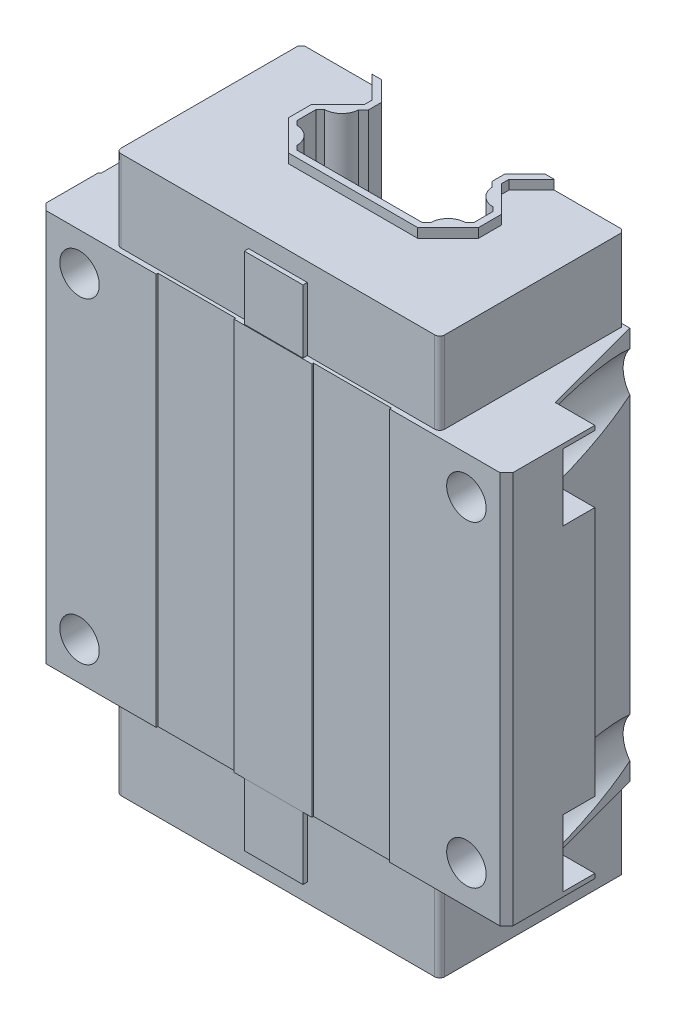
ISO-10303-21;
HEADER;
FILE_DESCRIPTION(('STEP AP214'),'2;1');
FILE_NAME('part.step','',(''),(''),'','','');
FILE_SCHEMA(('AUTOMOTIVE_DESIGN { 1 0 10303 214 1 1 1 1 }'));
ENDSEC;
DATA;
#1=APPLICATION_CONTEXT('core data for automotive mechanical design processes');
#2=APPLICATION_PROTOCOL_DEFINITION('international standard','automotive_design',2000,#1);
#3=PRODUCT_CONTEXT('',#1,'mechanical');
#4=PRODUCT('Part','Part','',(#3));
#5=PRODUCT_RELATED_PRODUCT_CATEGORY('part','',(#4));
#6=PRODUCT_DEFINITION_FORMATION('','',#4);
#7=PRODUCT_DEFINITION_CONTEXT('part definition',#1,'design');
#8=PRODUCT_DEFINITION('design','',#6,#7);
#9=PRODUCT_DEFINITION_SHAPE('','',#8);
#10=(LENGTH_UNIT() NAMED_UNIT(*) SI_UNIT(.MILLI.,.METRE.));
#11=(NAMED_UNIT(*) PLANE_ANGLE_UNIT() SI_UNIT($,.RADIAN.));
#12=(NAMED_UNIT(*) SI_UNIT($,.STERADIAN.) SOLID_ANGLE_UNIT());
#13=UNCERTAINTY_MEASURE_WITH_UNIT(LENGTH_MEASURE(1.E-05),#10,'distance_accuracy_value','');
#14=(GEOMETRIC_REPRESENTATION_CONTEXT(3) GLOBAL_UNCERTAINTY_ASSIGNED_CONTEXT((#13)) GLOBAL_UNIT_ASSIGNED_CONTEXT((#10,
#11,#12)) REPRESENTATION_CONTEXT('',''));
#15=CARTESIAN_POINT('',(0.,0.,0.));
#16=DIRECTION('',(0.,0.,1.));
#17=DIRECTION('',(1.,0.,0.));
#18=AXIS2_PLACEMENT_3D('',#15,#16,#17);
#19=CARTESIAN_POINT('',(-50.,-252.692085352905,-57.));
#20=DIRECTION('',(-0.965925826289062,0.,-0.258819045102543));
#21=DIRECTION('',(-0.258819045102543,0.,0.965925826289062));
#22=AXIS2_PLACEMENT_3D('',#19,#20,#21);
#23=PLANE('',#22);
#24=CARTESIAN_POINT('',(-58.,47.5,-27.1435935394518));
#25=DIRECTION('',(0.965925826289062,0.,0.258819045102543));
#26=DIRECTION('',(-0.258819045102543,0.,0.965925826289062));
#27=AXIS2_PLACEMENT_3D('',#24,#25,#26);
#28=ELLIPSE('',#27,38.6370330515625,10.0000000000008);
#29=CARTESIAN_POINT('',(-50.,53.5000000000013,-57.));
#30=VERTEX_POINT('',#29);
#31=CARTESIAN_POINT('',(-58.,57.5,-27.1435935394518));
#32=VERTEX_POINT('',#31);
#33=EDGE_CURVE('E10',#30,#32,#28,.T.);
#34=ORIENTED_EDGE('',*,*,#33,.T.);
#35=DIRECTION('',(-0.258819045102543,0.,0.965925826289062));
#36=VECTOR('',#35,1.);
#37=CARTESIAN_POINT('',(-50.,57.5,-57.));
#38=LINE('',#37,#36);
#39=CARTESIAN_POINT('',(-58.17245036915,57.5,-26.5));
#40=VERTEX_POINT('',#39);
#41=EDGE_CURVE('E27',#32,#40,#38,.T.);
#42=ORIENTED_EDGE('',*,*,#41,.T.);
#43=DIRECTION('',(0.,1.,0.));
#44=VECTOR('',#43,1.);
#45=CARTESIAN_POINT('',(-58.17245036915,-252.692085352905,-26.5));
#46=LINE('',#45,#44);
#47=CARTESIAN_POINT('',(-58.17245036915,58.85,-26.5));
#48=VERTEX_POINT('',#47);
#49=EDGE_CURVE('E1001',#40,#48,#46,.T.);
#50=ORIENTED_EDGE('',*,*,#49,.T.);
#51=DIRECTION('',(0.258819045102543,0.,-0.965925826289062));
#52=VECTOR('',#51,1.);
#53=CARTESIAN_POINT('',(-60.9006350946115,58.85,-16.3182759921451));
#54=LINE('',#53,#52);
#55=CARTESIAN_POINT('',(-50.,58.85,-57.));
#56=VERTEX_POINT('',#55);
#57=EDGE_CURVE('E997',#48,#56,#54,.T.);
#58=ORIENTED_EDGE('',*,*,#57,.T.);
#59=DIRECTION('',(0.,1.,0.));
#60=VECTOR('',#59,1.);
#61=CARTESIAN_POINT('',(-50.,-252.692085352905,-57.));
#62=LINE('',#61,#60);
#63=EDGE_CURVE('E1159',#30,#56,#62,.T.);
#64=ORIENTED_EDGE('',*,*,#63,.F.);
#65=EDGE_LOOP('',(#34,#42,#50,#58,#64));
#66=FACE_BOUND('',#65,.T.);
#67=ADVANCED_FACE('F16',(#66),#23,.T.);
#68=CARTESIAN_POINT('',(-50.,-252.692085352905,-57.));
#69=DIRECTION('',(-0.965925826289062,0.,-0.258819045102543));
#70=DIRECTION('',(-0.258819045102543,0.,0.965925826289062));
#71=AXIS2_PLACEMENT_3D('',#68,#69,#70);
#72=PLANE('',#71);
#73=DIRECTION('',(0.258819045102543,0.,-0.965925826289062));
#74=VECTOR('',#73,1.);
#75=CARTESIAN_POINT('',(-50.,37.5,-57.));
#76=LINE('',#75,#74);
#77=CARTESIAN_POINT('',(-58.17245036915,37.5,-26.5));
#78=VERTEX_POINT('',#77);
#79=CARTESIAN_POINT('',(-58.,37.4999999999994,-27.1435935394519));
#80=VERTEX_POINT('',#79);
#81=EDGE_CURVE('E810',#78,#80,#76,.T.);
#82=ORIENTED_EDGE('',*,*,#81,.T.);
#83=CARTESIAN_POINT('',(-58.,47.5,-27.1435935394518));
#84=DIRECTION('',(0.965925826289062,0.,0.258819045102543));
#85=DIRECTION('',(-0.258819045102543,0.,0.965925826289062));
#86=AXIS2_PLACEMENT_3D('',#83,#84,#85);
#87=ELLIPSE('',#86,38.6370330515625,10.0000000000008);
#88=CARTESIAN_POINT('',(-50.,41.4999999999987,-57.));
#89=VERTEX_POINT('',#88);
#90=EDGE_CURVE('E806',#80,#89,#87,.T.);
#91=ORIENTED_EDGE('',*,*,#90,.T.);
#92=DIRECTION('',(0.,1.,0.));
#93=VECTOR('',#92,1.);
#94=CARTESIAN_POINT('',(-50.,-252.692085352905,-57.));
#95=LINE('',#94,#93);
#96=CARTESIAN_POINT('',(-50.,-41.4999999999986,-57.));
#97=VERTEX_POINT('',#96);
#98=EDGE_CURVE('E1008',#97,#89,#95,.T.);
#99=ORIENTED_EDGE('',*,*,#98,.F.);
#100=CARTESIAN_POINT('',(-58.,-47.5,-27.1435935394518));
#101=DIRECTION('',(-0.965925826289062,0.,-0.258819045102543));
#102=DIRECTION('',(-0.258819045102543,0.,0.965925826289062));
#103=AXIS2_PLACEMENT_3D('',#100,#101,#102);
#104=ELLIPSE('',#103,38.6370330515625,10.0000000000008);
#105=CARTESIAN_POINT('',(-58.,-37.5,-27.1435935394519));
#106=VERTEX_POINT('',#105);
#107=EDGE_CURVE('E866',#106,#97,#104,.T.);
#108=ORIENTED_EDGE('',*,*,#107,.F.);
#109=DIRECTION('',(0.258819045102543,0.,-0.965925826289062));
#110=VECTOR('',#109,1.);
#111=CARTESIAN_POINT('',(-50.,-37.5,-57.));
#112=LINE('',#111,#110);
#113=CARTESIAN_POINT('',(-58.17245036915,-37.5,-26.5));
#114=VERTEX_POINT('',#113);
#115=EDGE_CURVE('E989',#114,#106,#112,.T.);
#116=ORIENTED_EDGE('',*,*,#115,.F.);
#117=DIRECTION('',(0.,1.,0.));
#118=VECTOR('',#117,1.);
#119=CARTESIAN_POINT('',(-58.17245036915,-252.692085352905,-26.5));
#120=LINE('',#119,#118);
#121=EDGE_CURVE('E811',#114,#78,#120,.T.);
#122=ORIENTED_EDGE('',*,*,#121,.T.);
#123=EDGE_LOOP('',(#82,#91,#99,#108,#116,#122));
#124=FACE_BOUND('',#123,.T.);
#125=ADVANCED_FACE('F2317',(#124),#72,.T.);
#126=CARTESIAN_POINT('',(-69.5,-252.692085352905,-26.5));
#127=DIRECTION('',(0.,0.,-1.));
#128=DIRECTION('',(0.,-1.,0.));
#129=AXIS2_PLACEMENT_3D('',#126,#127,#128);
#130=PLANE('',#129);
#131=ORIENTED_EDGE('',*,*,#49,.F.);
#132=DIRECTION('',(-1.,0.,0.));
#133=VECTOR('',#132,1.);
#134=CARTESIAN_POINT('',(-69.5,57.5,-26.5));
#135=LINE('',#134,#133);
#136=CARTESIAN_POINT('',(-69.5,57.5,-26.5));
#137=VERTEX_POINT('',#136);
#138=EDGE_CURVE('E1575',#40,#137,#135,.T.);
#139=ORIENTED_EDGE('',*,*,#138,.T.);
#140=DIRECTION('',(0.,1.,0.));
#141=VECTOR('',#140,1.);
#142=CARTESIAN_POINT('',(-69.5,-252.692085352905,-26.5));
#143=LINE('',#142,#141);
#144=CARTESIAN_POINT('',(-69.5,58.85,-26.5));
#145=VERTEX_POINT('',#144);
#146=EDGE_CURVE('E1269',#137,#145,#143,.T.);
#147=ORIENTED_EDGE('',*,*,#146,.T.);
#148=DIRECTION('',(1.,0.,0.));
#149=VECTOR('',#148,1.);
#150=CARTESIAN_POINT('',(0.,58.85,-26.5));
#151=LINE('',#150,#149);
#152=EDGE_CURVE('E1265',#145,#48,#151,.T.);
#153=ORIENTED_EDGE('',*,*,#152,.T.);
#154=EDGE_LOOP('',(#131,#139,#147,#153));
#155=FACE_BOUND('',#154,.T.);
#156=ADVANCED_FACE('F1975',(#155),#130,.T.);
#157=CARTESIAN_POINT('',(-69.5,-252.692085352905,-26.5));
#158=DIRECTION('',(0.,0.,-1.));
#159=DIRECTION('',(0.,-1.,0.));
#160=AXIS2_PLACEMENT_3D('',#157,#158,#159);
#161=PLANE('',#160);
#162=DIRECTION('',(0.,1.,0.));
#163=VECTOR('',#162,1.);
#164=CARTESIAN_POINT('',(-69.5,-252.692085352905,-26.5));
#165=LINE('',#164,#163);
#166=CARTESIAN_POINT('',(-69.5,-37.5,-26.5));
#167=VERTEX_POINT('',#166);
#168=CARTESIAN_POINT('',(-69.5,37.5,-26.5));
#169=VERTEX_POINT('',#168);
#170=EDGE_CURVE('E1270',#167,#169,#165,.T.);
#171=ORIENTED_EDGE('',*,*,#170,.T.);
#172=DIRECTION('',(1.,0.,0.));
#173=VECTOR('',#172,1.);
#174=CARTESIAN_POINT('',(-69.5,37.5,-26.5));
#175=LINE('',#174,#173);
#176=EDGE_CURVE('E1378',#169,#78,#175,.T.);
#177=ORIENTED_EDGE('',*,*,#176,.T.);
#178=ORIENTED_EDGE('',*,*,#121,.F.);
#179=DIRECTION('',(1.,0.,0.));
#180=VECTOR('',#179,1.);
#181=CARTESIAN_POINT('',(-69.5,-37.5,-26.5));
#182=LINE('',#181,#180);
#183=EDGE_CURVE('E436',#167,#114,#182,.T.);
#184=ORIENTED_EDGE('',*,*,#183,.F.);
#185=EDGE_LOOP('',(#171,#177,#178,#184));
#186=FACE_BOUND('',#185,.T.);
#187=ADVANCED_FACE('F2518',(#186),#161,.T.);
#188=CARTESIAN_POINT('',(-69.5,-252.692085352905,-26.5));
#189=DIRECTION('',(-1.,0.,0.));
#190=DIRECTION('',(0.,0.,1.));
#191=AXIS2_PLACEMENT_3D('',#188,#189,#190);
#192=PLANE('',#191);
#193=ORIENTED_EDGE('',*,*,#146,.F.);
#194=DIRECTION('',(0.,0.,1.));
#195=VECTOR('',#194,1.);
#196=CARTESIAN_POINT('',(-69.5,57.5,-26.5));
#197=LINE('',#196,#195);
#198=CARTESIAN_POINT('',(-69.5,57.5,-18.));
#199=VERTEX_POINT('',#198);
#200=EDGE_CURVE('E1375',#137,#199,#197,.T.);
#201=ORIENTED_EDGE('',*,*,#200,.T.);
#202=DIRECTION('',(0.,1.,0.));
#203=VECTOR('',#202,1.);
#204=CARTESIAN_POINT('',(-69.5,-252.692085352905,-18.));
#205=LINE('',#204,#203);
#206=CARTESIAN_POINT('',(-69.5,58.85,-18.));
#207=VERTEX_POINT('',#206);
#208=EDGE_CURVE('E449',#199,#207,#205,.T.);
#209=ORIENTED_EDGE('',*,*,#208,.T.);
#210=DIRECTION('',(0.,0.,-1.));
#211=VECTOR('',#210,1.);
#212=CARTESIAN_POINT('',(-69.5,58.85,0.));
#213=LINE('',#212,#211);
#214=EDGE_CURVE('E1451',#207,#145,#213,.T.);
#215=ORIENTED_EDGE('',*,*,#214,.T.);
#216=EDGE_LOOP('',(#193,#201,#209,#215));
#217=FACE_BOUND('',#216,.T.);
#218=ADVANCED_FACE('F1984',(#217),#192,.T.);
#219=CARTESIAN_POINT('',(-69.5,-252.692085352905,-26.5));
#220=DIRECTION('',(-1.,0.,0.));
#221=DIRECTION('',(0.,0.,1.));
#222=AXIS2_PLACEMENT_3D('',#219,#220,#221);
#223=PLANE('',#222);
#224=DIRECTION('',(0.,1.,0.));
#225=VECTOR('',#224,1.);
#226=CARTESIAN_POINT('',(-69.5,-252.692085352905,-18.));
#227=LINE('',#226,#225);
#228=CARTESIAN_POINT('',(-69.5,-37.5,-18.));
#229=VERTEX_POINT('',#228);
#230=CARTESIAN_POINT('',(-69.5,37.5,-18.));
#231=VERTEX_POINT('',#230);
#232=EDGE_CURVE('E1026',#229,#231,#227,.T.);
#233=ORIENTED_EDGE('',*,*,#232,.T.);
#234=DIRECTION('',(0.,0.,-1.));
#235=VECTOR('',#234,1.);
#236=CARTESIAN_POINT('',(-69.5,37.5,-26.5));
#237=LINE('',#236,#235);
#238=EDGE_CURVE('E1022',#231,#169,#237,.T.);
#239=ORIENTED_EDGE('',*,*,#238,.T.);
#240=ORIENTED_EDGE('',*,*,#170,.F.);
#241=DIRECTION('',(0.,0.,-1.));
#242=VECTOR('',#241,1.);
#243=CARTESIAN_POINT('',(-69.5,-37.5,-26.5));
#244=LINE('',#243,#242);
#245=EDGE_CURVE('E724',#229,#167,#244,.T.);
#246=ORIENTED_EDGE('',*,*,#245,.F.);
#247=EDGE_LOOP('',(#233,#239,#240,#246));
#248=FACE_BOUND('',#247,.T.);
#249=ADVANCED_FACE('F2347',(#248),#223,.T.);
#250=CARTESIAN_POINT('',(-69.5,-252.692085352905,-18.));
#251=DIRECTION('',(-0.707106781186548,0.,-0.707106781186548));
#252=DIRECTION('',(-0.707106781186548,0.,0.707106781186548));
#253=AXIS2_PLACEMENT_3D('',#250,#251,#252);
#254=PLANE('',#253);
#255=ORIENTED_EDGE('',*,*,#208,.F.);
#256=DIRECTION('',(-0.707106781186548,0.,0.707106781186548));
#257=VECTOR('',#256,1.);
#258=CARTESIAN_POINT('',(-69.5,57.5,-18.));
#259=LINE('',#258,#257);
#260=CARTESIAN_POINT('',(-70.,57.5,-17.5));
#261=VERTEX_POINT('',#260);
#262=EDGE_CURVE('E1027',#199,#261,#259,.T.);
#263=ORIENTED_EDGE('',*,*,#262,.T.);
#264=DIRECTION('',(0.,1.,0.));
#265=VECTOR('',#264,1.);
#266=CARTESIAN_POINT('',(-70.,-252.692085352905,-17.5));
#267=LINE('',#266,#265);
#268=CARTESIAN_POINT('',(-70.,58.85,-17.5));
#269=VERTEX_POINT('',#268);
#270=EDGE_CURVE('E1382',#261,#269,#267,.T.);
#271=ORIENTED_EDGE('',*,*,#270,.T.);
#272=DIRECTION('',(0.707106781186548,0.,-0.707106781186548));
#273=VECTOR('',#272,1.);
#274=CARTESIAN_POINT('',(-43.75,58.85,-43.75));
#275=LINE('',#274,#273);
#276=EDGE_CURVE('E896',#269,#207,#275,.T.);
#277=ORIENTED_EDGE('',*,*,#276,.T.);
#278=EDGE_LOOP('',(#255,#263,#271,#277));
#279=FACE_BOUND('',#278,.T.);
#280=ADVANCED_FACE('F2351',(#279),#254,.T.);
#281=CARTESIAN_POINT('',(-69.5,-252.692085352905,-18.));
#282=DIRECTION('',(-0.707106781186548,0.,-0.707106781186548));
#283=DIRECTION('',(-0.707106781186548,0.,0.707106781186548));
#284=AXIS2_PLACEMENT_3D('',#281,#282,#283);
#285=PLANE('',#284);
#286=DIRECTION('',(0.,1.,0.));
#287=VECTOR('',#286,1.);
#288=CARTESIAN_POINT('',(-70.,-252.692085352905,-17.5));
#289=LINE('',#288,#287);
#290=CARTESIAN_POINT('',(-70.,-37.5,-17.5));
#291=VERTEX_POINT('',#290);
#292=CARTESIAN_POINT('',(-70.,37.5,-17.5));
#293=VERTEX_POINT('',#292);
#294=EDGE_CURVE('E892',#291,#293,#289,.T.);
#295=ORIENTED_EDGE('',*,*,#294,.T.);
#296=DIRECTION('',(0.707106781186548,0.,-0.707106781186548));
#297=VECTOR('',#296,1.);
#298=CARTESIAN_POINT('',(-69.5,37.5,-18.));
#299=LINE('',#298,#297);
#300=EDGE_CURVE('E897',#293,#231,#299,.T.);
#301=ORIENTED_EDGE('',*,*,#300,.T.);
#302=ORIENTED_EDGE('',*,*,#232,.F.);
#303=DIRECTION('',(0.707106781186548,0.,-0.707106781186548));
#304=VECTOR('',#303,1.);
#305=CARTESIAN_POINT('',(-69.5,-37.5,-18.));
#306=LINE('',#305,#304);
#307=EDGE_CURVE('E728',#291,#229,#306,.T.);
#308=ORIENTED_EDGE('',*,*,#307,.F.);
#309=EDGE_LOOP('',(#295,#301,#302,#308));
#310=FACE_BOUND('',#309,.T.);
#311=ADVANCED_FACE('F3061',(#310),#285,.T.);
#312=CARTESIAN_POINT('',(-70.,-252.692085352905,-2.));
#313=DIRECTION('',(-1.,0.,0.));
#314=DIRECTION('',(0.,0.,1.));
#315=AXIS2_PLACEMENT_3D('',#312,#313,#314);
#316=PLANE('',#315);
#317=ORIENTED_EDGE('',*,*,#270,.F.);
#318=DIRECTION('',(0.,0.,1.));
#319=VECTOR('',#318,1.);
#320=CARTESIAN_POINT('',(-70.,57.5,-2.));
#321=LINE('',#320,#319);
#322=CARTESIAN_POINT('',(-70.,57.5,-17.));
#323=VERTEX_POINT('',#322);
#324=EDGE_CURVE('E955',#261,#323,#321,.T.);
#325=ORIENTED_EDGE('',*,*,#324,.T.);
#326=DIRECTION('',(0.,-1.,0.));
#327=VECTOR('',#326,1.);
#328=CARTESIAN_POINT('',(-70.,-252.692085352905,-17.));
#329=LINE('',#328,#327);
#330=CARTESIAN_POINT('',(-70.,37.5,-17.));
#331=VERTEX_POINT('',#330);
#332=EDGE_CURVE('E1189',#323,#331,#329,.T.);
#333=ORIENTED_EDGE('',*,*,#332,.T.);
#334=DIRECTION('',(0.,0.,-1.));
#335=VECTOR('',#334,1.);
#336=CARTESIAN_POINT('',(-70.,37.5,-2.));
#337=LINE('',#336,#335);
#338=EDGE_CURVE('E1473',#331,#293,#337,.T.);
#339=ORIENTED_EDGE('',*,*,#338,.T.);
#340=ORIENTED_EDGE('',*,*,#294,.F.);
#341=DIRECTION('',(0.,0.,-1.));
#342=VECTOR('',#341,1.);
#343=CARTESIAN_POINT('',(-70.,-37.5,-2.));
#344=LINE('',#343,#342);
#345=CARTESIAN_POINT('',(-70.,-37.5,-17.));
#346=VERTEX_POINT('',#345);
#347=EDGE_CURVE('E1033',#346,#291,#344,.T.);
#348=ORIENTED_EDGE('',*,*,#347,.F.);
#349=DIRECTION('',(0.,1.,0.));
#350=VECTOR('',#349,1.);
#351=CARTESIAN_POINT('',(-70.,-252.692085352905,-17.));
#352=LINE('',#351,#350);
#353=CARTESIAN_POINT('',(-70.,-57.5,-17.));
#354=VERTEX_POINT('',#353);
#355=EDGE_CURVE('E935',#354,#346,#352,.T.);
#356=ORIENTED_EDGE('',*,*,#355,.F.);
#357=DIRECTION('',(0.,0.,1.));
#358=VECTOR('',#357,1.);
#359=CARTESIAN_POINT('',(-70.,-57.5,-2.));
#360=LINE('',#359,#358);
#361=CARTESIAN_POINT('',(-70.,-57.5,-17.5));
#362=VERTEX_POINT('',#361);
#363=EDGE_CURVE('E787',#362,#354,#360,.T.);
#364=ORIENTED_EDGE('',*,*,#363,.F.);
#365=DIRECTION('',(0.,1.,0.));
#366=VECTOR('',#365,1.);
#367=CARTESIAN_POINT('',(-70.,-252.692085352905,-17.5));
#368=LINE('',#367,#366);
#369=CARTESIAN_POINT('',(-70.,-58.85,-17.5));
#370=VERTEX_POINT('',#369);
#371=EDGE_CURVE('E1308',#370,#362,#368,.T.);
#372=ORIENTED_EDGE('',*,*,#371,.F.);
#373=DIRECTION('',(0.,0.,1.));
#374=VECTOR('',#373,1.);
#375=CARTESIAN_POINT('',(-70.,-58.85,0.));
#376=LINE('',#375,#374);
#377=CARTESIAN_POINT('',(-70.,-58.85,-2.));
#378=VERTEX_POINT('',#377);
#379=EDGE_CURVE('E880',#370,#378,#376,.T.);
#380=ORIENTED_EDGE('',*,*,#379,.T.);
#381=DIRECTION('',(0.,1.,0.));
#382=VECTOR('',#381,1.);
#383=CARTESIAN_POINT('',(-70.,-252.692085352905,-2.));
#384=LINE('',#383,#382);
#385=CARTESIAN_POINT('',(-70.,58.85,-2.));
#386=VERTEX_POINT('',#385);
#387=EDGE_CURVE('E876',#378,#386,#384,.T.);
#388=ORIENTED_EDGE('',*,*,#387,.T.);
#389=DIRECTION('',(0.,0.,-1.));
#390=VECTOR('',#389,1.);
#391=CARTESIAN_POINT('',(-70.,58.85,0.));
#392=LINE('',#391,#390);
#393=EDGE_CURVE('E881',#386,#269,#392,.T.);
#394=ORIENTED_EDGE('',*,*,#393,.T.);
#395=EDGE_LOOP('',(#317,#325,#333,#339,#340,#348,#356,#364,#372,#380,#388,#394));
#396=FACE_BOUND('',#395,.T.);
#397=ADVANCED_FACE('F2289',(#396),#316,.T.);
#398=CARTESIAN_POINT('',(-58.,47.5,0.));
#399=DIRECTION('',(0.,0.,-1.));
#400=DIRECTION('',(0.,-1.,0.));
#401=AXIS2_PLACEMENT_3D('',#398,#399,#400);
#402=CYLINDRICAL_SURFACE('',#401,5.9175);
#403=CARTESIAN_POINT('',(-58.,47.5,0.));
#404=DIRECTION('',(0.,0.,-1.));
#405=DIRECTION('',(0.,-1.,0.));
#406=AXIS2_PLACEMENT_3D('',#403,#404,#405);
#407=CIRCLE('',#406,5.9175);
#408=CARTESIAN_POINT('',(-58.,41.5825,0.));
#409=VERTEX_POINT('',#408);
#410=EDGE_CURVE('E745',#409,#409,#407,.T.);
#411=ORIENTED_EDGE('',*,*,#410,.F.);
#412=EDGE_LOOP('',(#411));
#413=FACE_BOUND('',#412,.T.);
#414=CARTESIAN_POINT('',(-58.,47.5,-17.));
#415=DIRECTION('',(0.,0.,1.));
#416=DIRECTION('',(-1.,0.,0.));
#417=AXIS2_PLACEMENT_3D('',#414,#415,#416);
#418=CIRCLE('',#417,5.9175);
#419=CARTESIAN_POINT('',(-63.9175,47.5,-17.));
#420=VERTEX_POINT('',#419);
#421=EDGE_CURVE('E904',#420,#420,#418,.T.);
#422=ORIENTED_EDGE('',*,*,#421,.F.);
#423=EDGE_LOOP('',(#422));
#424=FACE_BOUND('',#423,.T.);
#425=ADVANCED_FACE('F2735',(#413,#424),#402,.F.);
#426=CARTESIAN_POINT('',(70.,-252.692085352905,-26.5));
#427=DIRECTION('',(1.,0.,0.));
#428=DIRECTION('',(0.,1.,0.));
#429=AXIS2_PLACEMENT_3D('',#426,#427,#428);
#430=PLANE('',#429);
#431=DIRECTION('',(0.,1.,0.));
#432=VECTOR('',#431,1.);
#433=CARTESIAN_POINT('',(70.,-252.692085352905,-17.));
#434=LINE('',#433,#432);
#435=CARTESIAN_POINT('',(70.,-57.5,-17.));
#436=VERTEX_POINT('',#435);
#437=CARTESIAN_POINT('',(70.,-37.5,-17.));
#438=VERTEX_POINT('',#437);
#439=EDGE_CURVE('E1505',#436,#438,#434,.T.);
#440=ORIENTED_EDGE('',*,*,#439,.T.);
#441=DIRECTION('',(0.,0.,-1.));
#442=VECTOR('',#441,1.);
#443=CARTESIAN_POINT('',(70.,-37.5,-26.5));
#444=LINE('',#443,#442);
#445=CARTESIAN_POINT('',(70.,-37.5,-26.5));
#446=VERTEX_POINT('',#445);
#447=EDGE_CURVE('E1501',#438,#446,#444,.T.);
#448=ORIENTED_EDGE('',*,*,#447,.T.);
#449=DIRECTION('',(0.,1.,0.));
#450=VECTOR('',#449,1.);
#451=CARTESIAN_POINT('',(70.,-252.692085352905,-26.5));
#452=LINE('',#451,#450);
#453=CARTESIAN_POINT('',(70.,37.5,-26.5));
#454=VERTEX_POINT('',#453);
#455=EDGE_CURVE('E1287',#446,#454,#452,.T.);
#456=ORIENTED_EDGE('',*,*,#455,.T.);
#457=DIRECTION('',(0.,0.,-1.));
#458=VECTOR('',#457,1.);
#459=CARTESIAN_POINT('',(70.,37.5,-26.5));
#460=LINE('',#459,#458);
#461=CARTESIAN_POINT('',(70.,37.5,-17.));
#462=VERTEX_POINT('',#461);
#463=EDGE_CURVE('E1455',#462,#454,#460,.T.);
#464=ORIENTED_EDGE('',*,*,#463,.F.);
#465=DIRECTION('',(0.,-1.,0.));
#466=VECTOR('',#465,1.);
#467=CARTESIAN_POINT('',(70.,-252.692085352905,-17.));
#468=LINE('',#467,#466);
#469=CARTESIAN_POINT('',(70.,57.5,-17.));
#470=VERTEX_POINT('',#469);
#471=EDGE_CURVE('E1506',#470,#462,#468,.T.);
#472=ORIENTED_EDGE('',*,*,#471,.F.);
#473=DIRECTION('',(0.,0.,1.));
#474=VECTOR('',#473,1.);
#475=CARTESIAN_POINT('',(70.,57.5,-26.5));
#476=LINE('',#475,#474);
#477=CARTESIAN_POINT('',(70.,57.5,-26.5));
#478=VERTEX_POINT('',#477);
#479=EDGE_CURVE('E1348',#478,#470,#476,.T.);
#480=ORIENTED_EDGE('',*,*,#479,.F.);
#481=DIRECTION('',(0.,1.,0.));
#482=VECTOR('',#481,1.);
#483=CARTESIAN_POINT('',(70.,-252.692085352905,-26.5));
#484=LINE('',#483,#482);
#485=CARTESIAN_POINT('',(70.,58.85,-26.5));
#486=VERTEX_POINT('',#485);
#487=EDGE_CURVE('E1283',#478,#486,#484,.T.);
#488=ORIENTED_EDGE('',*,*,#487,.T.);
#489=DIRECTION('',(0.,0.,1.));
#490=VECTOR('',#489,1.);
#491=CARTESIAN_POINT('',(70.,58.85,0.));
#492=LINE('',#491,#490);
#493=CARTESIAN_POINT('',(70.,58.85,-2.));
#494=VERTEX_POINT('',#493);
#495=EDGE_CURVE('E929',#486,#494,#492,.T.);
#496=ORIENTED_EDGE('',*,*,#495,.T.);
#497=DIRECTION('',(0.,1.,0.));
#498=VECTOR('',#497,1.);
#499=CARTESIAN_POINT('',(70.,-252.692085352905,-2.));
#500=LINE('',#499,#498);
#501=CARTESIAN_POINT('',(70.,-58.85,-2.));
#502=VERTEX_POINT('',#501);
#503=EDGE_CURVE('E972',#502,#494,#500,.T.);
#504=ORIENTED_EDGE('',*,*,#503,.F.);
#505=DIRECTION('',(0.,0.,-1.));
#506=VECTOR('',#505,1.);
#507=CARTESIAN_POINT('',(70.,-58.85,0.));
#508=LINE('',#507,#506);
#509=CARTESIAN_POINT('',(70.,-58.85,-26.5));
#510=VERTEX_POINT('',#509);
#511=EDGE_CURVE('E925',#502,#510,#508,.T.);
#512=ORIENTED_EDGE('',*,*,#511,.T.);
#513=DIRECTION('',(0.,1.,0.));
#514=VECTOR('',#513,1.);
#515=CARTESIAN_POINT('',(70.,-252.692085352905,-26.5));
#516=LINE('',#515,#514);
#517=CARTESIAN_POINT('',(70.,-57.5,-26.5));
#518=VERTEX_POINT('',#517);
#519=EDGE_CURVE('E930',#510,#518,#516,.T.);
#520=ORIENTED_EDGE('',*,*,#519,.T.);
#521=DIRECTION('',(0.,0.,1.));
#522=VECTOR('',#521,1.);
#523=CARTESIAN_POINT('',(70.,-57.5,-26.5));
#524=LINE('',#523,#522);
#525=EDGE_CURVE('E1012',#518,#436,#524,.T.);
#526=ORIENTED_EDGE('',*,*,#525,.T.);
#527=EDGE_LOOP('',(#440,#448,#456,#464,#472,#480,#488,#496,#504,#512,#520,#526));
#528=FACE_BOUND('',#527,.T.);
#529=ADVANCED_FACE('F2387',(#528),#430,.T.);
#530=CARTESIAN_POINT('',(58.17245036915,-252.692085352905,-26.5));
#531=DIRECTION('',(0.,0.,-1.));
#532=DIRECTION('',(0.,-1.,0.));
#533=AXIS2_PLACEMENT_3D('',#530,#531,#532);
#534=PLANE('',#533);
#535=ORIENTED_EDGE('',*,*,#455,.F.);
#536=DIRECTION('',(-1.,0.,0.));
#537=VECTOR('',#536,1.);
#538=CARTESIAN_POINT('',(58.17245036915,-37.5,-26.5));
#539=LINE('',#538,#537);
#540=CARTESIAN_POINT('',(58.17245036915,-37.5,-26.5));
#541=VERTEX_POINT('',#540);
#542=EDGE_CURVE('E1015',#446,#541,#539,.T.);
#543=ORIENTED_EDGE('',*,*,#542,.T.);
#544=DIRECTION('',(0.,1.,0.));
#545=VECTOR('',#544,1.);
#546=CARTESIAN_POINT('',(58.17245036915,-252.692085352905,-26.5));
#547=LINE('',#546,#545);
#548=CARTESIAN_POINT('',(58.17245036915,37.5,-26.5));
#549=VERTEX_POINT('',#548);
#550=EDGE_CURVE('E1519',#541,#549,#547,.T.);
#551=ORIENTED_EDGE('',*,*,#550,.T.);
#552=DIRECTION('',(-1.,0.,0.));
#553=VECTOR('',#552,1.);
#554=CARTESIAN_POINT('',(58.17245036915,37.5,-26.5));
#555=LINE('',#554,#553);
#556=EDGE_CURVE('E1458',#454,#549,#555,.T.);
#557=ORIENTED_EDGE('',*,*,#556,.F.);
#558=EDGE_LOOP('',(#535,#543,#551,#557));
#559=FACE_BOUND('',#558,.T.);
#560=ADVANCED_FACE('F2382',(#559),#534,.T.);
#561=CARTESIAN_POINT('',(58.17245036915,-252.692085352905,-26.5));
#562=DIRECTION('',(0.,0.,-1.));
#563=DIRECTION('',(0.,-1.,0.));
#564=AXIS2_PLACEMENT_3D('',#561,#562,#563);
#565=PLANE('',#564);
#566=DIRECTION('',(0.,1.,0.));
#567=VECTOR('',#566,1.);
#568=CARTESIAN_POINT('',(58.17245036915,-252.692085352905,-26.5));
#569=LINE('',#568,#567);
#570=CARTESIAN_POINT('',(58.17245036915,-58.85,-26.5));
#571=VERTEX_POINT('',#570);
#572=CARTESIAN_POINT('',(58.17245036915,-57.5,-26.5));
#573=VERTEX_POINT('',#572);
#574=EDGE_CURVE('E1099',#571,#573,#569,.T.);
#575=ORIENTED_EDGE('',*,*,#574,.T.);
#576=DIRECTION('',(1.,0.,0.));
#577=VECTOR('',#576,1.);
#578=CARTESIAN_POINT('',(58.1724503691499,-57.5,-26.5));
#579=LINE('',#578,#577);
#580=EDGE_CURVE('E1095',#573,#518,#579,.T.);
#581=ORIENTED_EDGE('',*,*,#580,.T.);
#582=ORIENTED_EDGE('',*,*,#519,.F.);
#583=DIRECTION('',(-1.,0.,0.));
#584=VECTOR('',#583,1.);
#585=CARTESIAN_POINT('',(0.,-58.85,-26.5));
#586=LINE('',#585,#584);
#587=EDGE_CURVE('E1100',#510,#571,#586,.T.);
#588=ORIENTED_EDGE('',*,*,#587,.T.);
#589=EDGE_LOOP('',(#575,#581,#582,#588));
#590=FACE_BOUND('',#589,.T.);
#591=ADVANCED_FACE('F2386',(#590),#565,.T.);
#592=CARTESIAN_POINT('',(58.17245036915,-252.692085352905,-26.5));
#593=DIRECTION('',(0.965925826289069,0.,-0.258819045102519));
#594=DIRECTION('',(0.,-1.,0.));
#595=AXIS2_PLACEMENT_3D('',#592,#593,#594);
#596=PLANE('',#595);
#597=DIRECTION('',(-0.258819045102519,0.,-0.965925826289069));
#598=VECTOR('',#597,1.);
#599=CARTESIAN_POINT('',(58.17245036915,-37.5,-26.5));
#600=LINE('',#599,#598);
#601=CARTESIAN_POINT('',(58.,-37.5,-27.1435935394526));
#602=VERTEX_POINT('',#601);
#603=EDGE_CURVE('E1128',#541,#602,#600,.T.);
#604=ORIENTED_EDGE('',*,*,#603,.T.);
#605=CARTESIAN_POINT('',(58.,-47.5,-27.1435935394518));
#606=DIRECTION('',(-0.965925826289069,0.,0.258819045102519));
#607=DIRECTION('',(0.258819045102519,0.,0.965925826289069));
#608=AXIS2_PLACEMENT_3D('',#605,#606,#607);
#609=ELLIPSE('',#608,38.6370330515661,10.0000000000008);
#610=CARTESIAN_POINT('',(50.0000000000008,-41.4999999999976,-57.));
#611=VERTEX_POINT('',#610);
#612=EDGE_CURVE('E1142',#602,#611,#609,.T.);
#613=ORIENTED_EDGE('',*,*,#612,.T.);
#614=DIRECTION('',(0.,1.,0.));
#615=VECTOR('',#614,1.);
#616=CARTESIAN_POINT('',(50.0000000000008,-252.692085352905,-57.));
#617=LINE('',#616,#615);
#618=CARTESIAN_POINT('',(50.0000000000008,41.4999999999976,-57.));
#619=VERTEX_POINT('',#618);
#620=EDGE_CURVE('E1146',#611,#619,#617,.T.);
#621=ORIENTED_EDGE('',*,*,#620,.T.);
#622=CARTESIAN_POINT('',(58.,47.5,-27.1435935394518));
#623=DIRECTION('',(0.965925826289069,0.,-0.258819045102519));
#624=DIRECTION('',(0.258819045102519,0.,0.965925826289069));
#625=AXIS2_PLACEMENT_3D('',#622,#623,#624);
#626=ELLIPSE('',#625,38.6370330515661,10.0000000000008);
#627=CARTESIAN_POINT('',(58.,37.4999999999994,-27.1435935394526));
#628=VERTEX_POINT('',#627);
#629=EDGE_CURVE('E775',#628,#619,#626,.T.);
#630=ORIENTED_EDGE('',*,*,#629,.F.);
#631=DIRECTION('',(-0.258819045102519,0.,-0.965925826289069));
#632=VECTOR('',#631,1.);
#633=CARTESIAN_POINT('',(58.17245036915,37.5,-26.5));
#634=LINE('',#633,#632);
#635=EDGE_CURVE('E1500',#549,#628,#634,.T.);
#636=ORIENTED_EDGE('',*,*,#635,.F.);
#637=ORIENTED_EDGE('',*,*,#550,.F.);
#638=EDGE_LOOP('',(#604,#613,#621,#630,#636,#637));
#639=FACE_BOUND('',#638,.T.);
#640=ADVANCED_FACE('F2669',(#639),#596,.T.);
#641=CARTESIAN_POINT('',(58.17245036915,-252.692085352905,-26.5));
#642=DIRECTION('',(0.965925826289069,0.,-0.258819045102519));
#643=DIRECTION('',(0.,-1.,0.));
#644=AXIS2_PLACEMENT_3D('',#641,#642,#643);
#645=PLANE('',#644);
#646=DIRECTION('',(0.,1.,0.));
#647=VECTOR('',#646,1.);
#648=CARTESIAN_POINT('',(50.0000000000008,-252.692085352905,-57.));
#649=LINE('',#648,#647);
#650=CARTESIAN_POINT('',(50.0000000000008,-58.85,-57.));
#651=VERTEX_POINT('',#650);
#652=CARTESIAN_POINT('',(50.0000000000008,-53.5000000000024,-57.));
#653=VERTEX_POINT('',#652);
#654=EDGE_CURVE('E1056',#651,#653,#649,.T.);
#655=ORIENTED_EDGE('',*,*,#654,.T.);
#656=CARTESIAN_POINT('',(58.,-47.5,-27.1435935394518));
#657=DIRECTION('',(-0.965925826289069,0.,0.258819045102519));
#658=DIRECTION('',(0.258819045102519,0.,0.965925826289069));
#659=AXIS2_PLACEMENT_3D('',#656,#657,#658);
#660=ELLIPSE('',#659,38.6370330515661,10.0000000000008);
#661=CARTESIAN_POINT('',(58.,-57.5,-27.1435935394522));
#662=VERTEX_POINT('',#661);
#663=EDGE_CURVE('E1052',#653,#662,#660,.T.);
#664=ORIENTED_EDGE('',*,*,#663,.T.);
#665=DIRECTION('',(0.258819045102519,0.,0.965925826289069));
#666=VECTOR('',#665,1.);
#667=CARTESIAN_POINT('',(58.17245036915,-57.5,-26.5));
#668=LINE('',#667,#666);
#669=EDGE_CURVE('E1057',#662,#573,#668,.T.);
#670=ORIENTED_EDGE('',*,*,#669,.T.);
#671=ORIENTED_EDGE('',*,*,#574,.F.);
#672=DIRECTION('',(-0.258819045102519,0.,-0.965925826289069));
#673=VECTOR('',#672,1.);
#674=CARTESIAN_POINT('',(60.9006350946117,-58.85,-16.3182759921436));
#675=LINE('',#674,#673);
#676=EDGE_CURVE('E1120',#571,#651,#675,.T.);
#677=ORIENTED_EDGE('',*,*,#676,.T.);
#678=EDGE_LOOP('',(#655,#664,#670,#671,#677));
#679=FACE_BOUND('',#678,.T.);
#680=ADVANCED_FACE('F2328',(#679),#645,.T.);
#681=CARTESIAN_POINT('',(58.,-47.5,0.));
#682=DIRECTION('',(0.,0.,-1.));
#683=DIRECTION('',(0.,-1.,0.));
#684=AXIS2_PLACEMENT_3D('',#681,#682,#683);
#685=CYLINDRICAL_SURFACE('',#684,5.9175);
#686=CARTESIAN_POINT('',(58.,-47.5,0.));
#687=DIRECTION('',(0.,0.,-1.));
#688=DIRECTION('',(0.,-1.,0.));
#689=AXIS2_PLACEMENT_3D('',#686,#687,#688);
#690=CIRCLE('',#689,5.9175);
#691=CARTESIAN_POINT('',(58.,-53.4175,0.));
#692=VERTEX_POINT('',#691);
#693=EDGE_CURVE('E729',#692,#692,#690,.T.);
#694=ORIENTED_EDGE('',*,*,#693,.F.);
#695=EDGE_LOOP('',(#694));
#696=FACE_BOUND('',#695,.T.);
#697=CARTESIAN_POINT('',(58.,-47.5,-17.));
#698=DIRECTION('',(0.,0.,1.));
#699=DIRECTION('',(-1.,0.,0.));
#700=AXIS2_PLACEMENT_3D('',#697,#698,#699);
#701=CIRCLE('',#700,5.9175);
#702=CARTESIAN_POINT('',(52.0825,-47.5,-17.));
#703=VERTEX_POINT('',#702);
#704=EDGE_CURVE('E1070',#703,#703,#701,.T.);
#705=ORIENTED_EDGE('',*,*,#704,.F.);
#706=EDGE_LOOP('',(#705));
#707=FACE_BOUND('',#706,.T.);
#708=ADVANCED_FACE('F2323',(#696,#707),#685,.F.);
#709=CARTESIAN_POINT('',(58.17245036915,-252.692085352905,-26.5));
#710=DIRECTION('',(0.,0.,-1.));
#711=DIRECTION('',(0.,-1.,0.));
#712=AXIS2_PLACEMENT_3D('',#709,#710,#711);
#713=PLANE('',#712);
#714=DIRECTION('',(1.,0.,0.));
#715=VECTOR('',#714,1.);
#716=CARTESIAN_POINT('',(58.1724503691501,57.5,-26.5));
#717=LINE('',#716,#715);
#718=CARTESIAN_POINT('',(58.17245036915,57.5,-26.5));
#719=VERTEX_POINT('',#718);
#720=EDGE_CURVE('E717',#719,#478,#717,.T.);
#721=ORIENTED_EDGE('',*,*,#720,.F.);
#722=DIRECTION('',(0.,1.,0.));
#723=VECTOR('',#722,1.);
#724=CARTESIAN_POINT('',(58.17245036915,-252.692085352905,-26.5));
#725=LINE('',#724,#723);
#726=CARTESIAN_POINT('',(58.17245036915,58.85,-26.5));
#727=VERTEX_POINT('',#726);
#728=EDGE_CURVE('E1124',#719,#727,#725,.T.);
#729=ORIENTED_EDGE('',*,*,#728,.T.);
#730=DIRECTION('',(1.,0.,0.));
#731=VECTOR('',#730,1.);
#732=CARTESIAN_POINT('',(0.,58.85,-26.5));
#733=LINE('',#732,#731);
#734=EDGE_CURVE('E1245',#727,#486,#733,.T.);
#735=ORIENTED_EDGE('',*,*,#734,.T.);
#736=ORIENTED_EDGE('',*,*,#487,.F.);
#737=EDGE_LOOP('',(#721,#729,#735,#736));
#738=FACE_BOUND('',#737,.T.);
#739=ADVANCED_FACE('F2327',(#738),#713,.T.);
#740=CARTESIAN_POINT('',(58.17245036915,-252.692085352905,-26.5));
#741=DIRECTION('',(0.965925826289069,0.,-0.258819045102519));
#742=DIRECTION('',(0.,-1.,0.));
#743=AXIS2_PLACEMENT_3D('',#740,#741,#742);
#744=PLANE('',#743);
#745=DIRECTION('',(0.258819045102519,0.,0.965925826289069));
#746=VECTOR('',#745,1.);
#747=CARTESIAN_POINT('',(58.17245036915,57.5,-26.5));
#748=LINE('',#747,#746);
#749=CARTESIAN_POINT('',(58.,57.5,-27.1435935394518));
#750=VERTEX_POINT('',#749);
#751=EDGE_CURVE('E712',#750,#719,#748,.T.);
#752=ORIENTED_EDGE('',*,*,#751,.F.);
#753=CARTESIAN_POINT('',(58.,47.5,-27.1435935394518));
#754=DIRECTION('',(0.965925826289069,0.,-0.258819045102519));
#755=DIRECTION('',(0.258819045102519,0.,0.965925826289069));
#756=AXIS2_PLACEMENT_3D('',#753,#754,#755);
#757=ELLIPSE('',#756,38.6370330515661,10.0000000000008);
#758=CARTESIAN_POINT('',(50.0000000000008,53.5000000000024,-57.));
#759=VERTEX_POINT('',#758);
#760=EDGE_CURVE('E1683',#759,#750,#757,.T.);
#761=ORIENTED_EDGE('',*,*,#760,.F.);
#762=DIRECTION('',(0.,1.,0.));
#763=VECTOR('',#762,1.);
#764=CARTESIAN_POINT('',(50.0000000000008,-252.692085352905,-57.));
#765=LINE('',#764,#763);
#766=CARTESIAN_POINT('',(50.0000000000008,58.85,-57.));
#767=VERTEX_POINT('',#766);
#768=EDGE_CURVE('E1658',#759,#767,#765,.T.);
#769=ORIENTED_EDGE('',*,*,#768,.T.);
#770=DIRECTION('',(0.258819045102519,0.,0.965925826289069));
#771=VECTOR('',#770,1.);
#772=CARTESIAN_POINT('',(60.9006350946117,58.85,-16.3182759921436));
#773=LINE('',#772,#771);
#774=EDGE_CURVE('E699',#767,#727,#773,.T.);
#775=ORIENTED_EDGE('',*,*,#774,.T.);
#776=ORIENTED_EDGE('',*,*,#728,.F.);
#777=EDGE_LOOP('',(#752,#761,#769,#775,#776));
#778=FACE_BOUND('',#777,.T.);
#779=ADVANCED_FACE('F2627',(#778),#744,.T.);
#780=CARTESIAN_POINT('',(0.,58.85,0.));
#781=DIRECTION('',(0.,1.,0.));
#782=DIRECTION('',(1.,0.,0.));
#783=AXIS2_PLACEMENT_3D('',#780,#781,#782);
#784=PLANE('',#783);
#785=DIRECTION('',(1.,0.,0.));
#786=VECTOR('',#785,1.);
#787=CARTESIAN_POINT('',(-47.,58.85,-1.49999999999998));
#788=LINE('',#787,#786);
#789=CARTESIAN_POINT('',(8.8,58.85,-1.49999999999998));
#790=VERTEX_POINT('',#789);
#791=CARTESIAN_POINT('',(47.,58.85,-1.49999999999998));
#792=VERTEX_POINT('',#791);
#793=EDGE_CURVE('E735',#790,#792,#788,.T.);
#794=ORIENTED_EDGE('',*,*,#793,.F.);
#795=DIRECTION('',(0.,0.,1.));
#796=VECTOR('',#795,1.);
#797=CARTESIAN_POINT('',(8.8,58.85,-1.49999999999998));
#798=LINE('',#797,#796);
#799=CARTESIAN_POINT('',(8.8,58.85,-0.199999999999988));
#800=VERTEX_POINT('',#799);
#801=EDGE_CURVE('E1080',#790,#800,#798,.T.);
#802=ORIENTED_EDGE('',*,*,#801,.T.);
#803=DIRECTION('',(-1.,0.,0.));
#804=VECTOR('',#803,1.);
#805=CARTESIAN_POINT('',(8.8,58.85,-0.199999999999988));
#806=LINE('',#805,#804);
#807=CARTESIAN_POINT('',(-8.8,58.85,-0.199999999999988));
#808=VERTEX_POINT('',#807);
#809=EDGE_CURVE('E858',#800,#808,#806,.T.);
#810=ORIENTED_EDGE('',*,*,#809,.T.);
#811=DIRECTION('',(0.,0.,-1.));
#812=VECTOR('',#811,1.);
#813=CARTESIAN_POINT('',(-8.8,58.85,-0.199999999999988));
#814=LINE('',#813,#812);
#815=CARTESIAN_POINT('',(-8.8,58.85,-1.49999999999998));
#816=VERTEX_POINT('',#815);
#817=EDGE_CURVE('E854',#808,#816,#814,.T.);
#818=ORIENTED_EDGE('',*,*,#817,.T.);
#819=DIRECTION('',(1.,0.,0.));
#820=VECTOR('',#819,1.);
#821=CARTESIAN_POINT('',(-47.,58.85,-1.49999999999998));
#822=LINE('',#821,#820);
#823=CARTESIAN_POINT('',(-47.,58.85,-1.5));
#824=VERTEX_POINT('',#823);
#825=EDGE_CURVE('E848',#824,#816,#822,.T.);
#826=ORIENTED_EDGE('',*,*,#825,.F.);
#827=CARTESIAN_POINT('',(-47.,58.85,-3.));
#828=DIRECTION('',(0.,1.,0.));
#829=DIRECTION('',(1.,0.,0.));
#830=AXIS2_PLACEMENT_3D('',#827,#828,#829);
#831=CIRCLE('',#830,1.5);
#832=CARTESIAN_POINT('',(-48.5,58.85,-3.));
#833=VERTEX_POINT('',#832);
#834=EDGE_CURVE('E1337',#833,#824,#831,.T.);
#835=ORIENTED_EDGE('',*,*,#834,.F.);
#836=DIRECTION('',(0.,0.,1.));
#837=VECTOR('',#836,1.);
#838=CARTESIAN_POINT('',(-48.5,58.85,-56.));
#839=LINE('',#838,#837);
#840=CARTESIAN_POINT('',(-48.5,58.85,-56.));
#841=VERTEX_POINT('',#840);
#842=EDGE_CURVE('E1651',#841,#833,#839,.T.);
#843=ORIENTED_EDGE('',*,*,#842,.F.);
#844=DIRECTION('',(-0.707106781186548,0.,0.707106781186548));
#845=VECTOR('',#844,1.);
#846=CARTESIAN_POINT('',(-47.5,58.85,-57.));
#847=LINE('',#846,#845);
#848=CARTESIAN_POINT('',(-47.5,58.85,-57.));
#849=VERTEX_POINT('',#848);
#850=EDGE_CURVE('E1401',#849,#841,#847,.T.);
#851=ORIENTED_EDGE('',*,*,#850,.F.);
#852=DIRECTION('',(1.,0.,0.));
#853=VECTOR('',#852,1.);
#854=CARTESIAN_POINT('',(-3.58291827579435E-12,58.85,-57.0000000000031));
#855=LINE('',#854,#853);
#856=EDGE_CURVE('E1163',#56,#849,#855,.T.);
#857=ORIENTED_EDGE('',*,*,#856,.F.);
#858=ORIENTED_EDGE('',*,*,#57,.F.);
#859=ORIENTED_EDGE('',*,*,#152,.F.);
#860=ORIENTED_EDGE('',*,*,#214,.F.);
#861=ORIENTED_EDGE('',*,*,#276,.F.);
#862=ORIENTED_EDGE('',*,*,#393,.F.);
#863=DIRECTION('',(-0.707106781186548,0.,-0.707106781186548));
#864=VECTOR('',#863,1.);
#865=CARTESIAN_POINT('',(-34.,58.85,34.));
#866=LINE('',#865,#864);
#867=CARTESIAN_POINT('',(-68.,58.85,0.));
#868=VERTEX_POINT('',#867);
#869=EDGE_CURVE('E768',#868,#386,#866,.T.);
#870=ORIENTED_EDGE('',*,*,#869,.F.);
#871=DIRECTION('',(1.,0.,0.));
#872=VECTOR('',#871,1.);
#873=CARTESIAN_POINT('',(-100.,58.85,0.));
#874=LINE('',#873,#872);
#875=CARTESIAN_POINT('',(-35.,58.85,0.));
#876=VERTEX_POINT('',#875);
#877=EDGE_CURVE('E859',#868,#876,#874,.T.);
#878=ORIENTED_EDGE('',*,*,#877,.T.);
#879=DIRECTION('',(0.,0.,1.));
#880=VECTOR('',#879,1.);
#881=CARTESIAN_POINT('',(-35.,58.85,9.71445146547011E-13));
#882=LINE('',#881,#880);
#883=CARTESIAN_POINT('',(-35.,58.85,-0.5));
#884=VERTEX_POINT('',#883);
#885=EDGE_CURVE('E1493',#884,#876,#882,.T.);
#886=ORIENTED_EDGE('',*,*,#885,.F.);
#887=DIRECTION('',(-1.,0.,0.));
#888=VECTOR('',#887,1.);
#889=CARTESIAN_POINT('',(0.,58.85,-0.5));
#890=LINE('',#889,#888);
#891=CARTESIAN_POINT('',(-11.66666666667,58.85,-0.5));
#892=VERTEX_POINT('',#891);
#893=EDGE_CURVE('E799',#892,#884,#890,.T.);
#894=ORIENTED_EDGE('',*,*,#893,.F.);
#895=DIRECTION('',(0.,0.,-1.));
#896=VECTOR('',#895,1.);
#897=CARTESIAN_POINT('',(-11.66666666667,58.85,-4.45245692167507E-13));
#898=LINE('',#897,#896);
#899=CARTESIAN_POINT('',(-11.66666666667,58.85,0.));
#900=VERTEX_POINT('',#899);
#901=EDGE_CURVE('E1394',#900,#892,#898,.T.);
#902=ORIENTED_EDGE('',*,*,#901,.F.);
#903=DIRECTION('',(1.,0.,0.));
#904=VECTOR('',#903,1.);
#905=CARTESIAN_POINT('',(-100.,58.85,0.));
#906=LINE('',#905,#904);
#907=CARTESIAN_POINT('',(11.66666666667,58.85,0.));
#908=VERTEX_POINT('',#907);
#909=EDGE_CURVE('E1206',#900,#908,#906,.T.);
#910=ORIENTED_EDGE('',*,*,#909,.T.);
#911=DIRECTION('',(0.,0.,1.));
#912=VECTOR('',#911,1.);
#913=CARTESIAN_POINT('',(11.66666666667,58.85,0.));
#914=LINE('',#913,#912);
#915=CARTESIAN_POINT('',(11.66666666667,58.85,-0.5));
#916=VERTEX_POINT('',#915);
#917=EDGE_CURVE('E960',#916,#908,#914,.T.);
#918=ORIENTED_EDGE('',*,*,#917,.F.);
#919=DIRECTION('',(-1.,0.,0.));
#920=VECTOR('',#919,1.);
#921=CARTESIAN_POINT('',(0.,58.85,-0.5));
#922=LINE('',#921,#920);
#923=CARTESIAN_POINT('',(35.,58.85,-0.5));
#924=VERTEX_POINT('',#923);
#925=EDGE_CURVE('E1135',#924,#916,#922,.T.);
#926=ORIENTED_EDGE('',*,*,#925,.F.);
#927=DIRECTION('',(0.,0.,-1.));
#928=VECTOR('',#927,1.);
#929=CARTESIAN_POINT('',(35.,58.85,0.));
#930=LINE('',#929,#928);
#931=CARTESIAN_POINT('',(35.,58.85,0.));
#932=VERTEX_POINT('',#931);
#933=EDGE_CURVE('E1491',#932,#924,#930,.T.);
#934=ORIENTED_EDGE('',*,*,#933,.F.);
#935=DIRECTION('',(1.,0.,0.));
#936=VECTOR('',#935,1.);
#937=CARTESIAN_POINT('',(-100.,58.85,0.));
#938=LINE('',#937,#936);
#939=CARTESIAN_POINT('',(68.,58.85,0.));
#940=VERTEX_POINT('',#939);
#941=EDGE_CURVE('E1119',#932,#940,#938,.T.);
#942=ORIENTED_EDGE('',*,*,#941,.T.);
#943=DIRECTION('',(-0.707106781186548,0.,0.707106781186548));
#944=VECTOR('',#943,1.);
#945=CARTESIAN_POINT('',(34.,58.85,34.));
#946=LINE('',#945,#944);
#947=EDGE_CURVE('E975',#494,#940,#946,.T.);
#948=ORIENTED_EDGE('',*,*,#947,.F.);
#949=ORIENTED_EDGE('',*,*,#495,.F.);
#950=ORIENTED_EDGE('',*,*,#734,.F.);
#951=ORIENTED_EDGE('',*,*,#774,.F.);
#952=DIRECTION('',(1.,0.,0.));
#953=VECTOR('',#952,1.);
#954=CARTESIAN_POINT('',(3.58291827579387E-12,58.85,-57.0000000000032));
#955=LINE('',#954,#953);
#956=CARTESIAN_POINT('',(47.5,58.85,-57.));
#957=VERTEX_POINT('',#956);
#958=EDGE_CURVE('E1629',#957,#767,#955,.T.);
#959=ORIENTED_EDGE('',*,*,#958,.F.);
#960=DIRECTION('',(-0.707106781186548,0.,-0.707106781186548));
#961=VECTOR('',#960,1.);
#962=CARTESIAN_POINT('',(48.5,58.85,-56.));
#963=LINE('',#962,#961);
#964=CARTESIAN_POINT('',(48.5,58.85,-56.));
#965=VERTEX_POINT('',#964);
#966=EDGE_CURVE('E1317',#965,#957,#963,.T.);
#967=ORIENTED_EDGE('',*,*,#966,.F.);
#968=DIRECTION('',(0.,0.,-1.));
#969=VECTOR('',#968,1.);
#970=CARTESIAN_POINT('',(48.5,58.85,-3.));
#971=LINE('',#970,#969);
#972=CARTESIAN_POINT('',(48.5,58.85,-3.));
#973=VERTEX_POINT('',#972);
#974=EDGE_CURVE('E1331',#973,#965,#971,.T.);
#975=ORIENTED_EDGE('',*,*,#974,.F.);
#976=CARTESIAN_POINT('',(47.,58.85,-3.));
#977=DIRECTION('',(0.,1.,0.));
#978=DIRECTION('',(-1.,0.,0.));
#979=AXIS2_PLACEMENT_3D('',#976,#977,#978);
#980=CIRCLE('',#979,1.5);
#981=EDGE_CURVE('E1693',#792,#973,#980,.T.);
#982=ORIENTED_EDGE('',*,*,#981,.F.);
#983=EDGE_LOOP('',(#794,#802,#810,#818,#826,#835,#843,#851,#857,#858,#859,#860,#861,#862,#870,
#878,#886,#894,#902,#910,#918,#926,#934,#942,#948,#949,#950,#951,#959,#967,#975,#982));
#984=FACE_BOUND('',#983,.T.);
#985=ADVANCED_FACE('F1986',(#984),#784,.T.);
#986=CARTESIAN_POINT('',(-47.,83.35,-1.49999999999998));
#987=DIRECTION('',(0.,0.,-1.));
#988=DIRECTION('',(0.,-1.,0.));
#989=AXIS2_PLACEMENT_3D('',#986,#987,#988);
#990=PLANE('',#989);
#991=DIRECTION('',(0.,-1.,0.));
#992=VECTOR('',#991,1.);
#993=CARTESIAN_POINT('',(-8.8,77.85,-1.49999999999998));
#994=LINE('',#993,#992);
#995=CARTESIAN_POINT('',(-8.8,77.85,-1.49999999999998));
#996=VERTEX_POINT('',#995);
#997=EDGE_CURVE('E837',#996,#816,#994,.T.);
#998=ORIENTED_EDGE('',*,*,#997,.F.);
#999=DIRECTION('',(1.,0.,0.));
#1000=VECTOR('',#999,1.);
#1001=CARTESIAN_POINT('',(-8.8,77.85,-1.49999999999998));
#1002=LINE('',#1001,#1000);
#1003=CARTESIAN_POINT('',(8.8,77.85,-1.49999999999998));
#1004=VERTEX_POINT('',#1003);
#1005=EDGE_CURVE('E1115',#996,#1004,#1002,.T.);
#1006=ORIENTED_EDGE('',*,*,#1005,.T.);
#1007=DIRECTION('',(0.,-1.,0.));
#1008=VECTOR('',#1007,1.);
#1009=CARTESIAN_POINT('',(8.8,77.85,-1.49999999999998));
#1010=LINE('',#1009,#1008);
#1011=EDGE_CURVE('E739',#1004,#790,#1010,.T.);
#1012=ORIENTED_EDGE('',*,*,#1011,.T.);
#1013=ORIENTED_EDGE('',*,*,#793,.T.);
#1014=DIRECTION('',(0.,-1.,0.));
#1015=VECTOR('',#1014,1.);
#1016=CARTESIAN_POINT('',(47.,83.35,-1.49999999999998));
#1017=LINE('',#1016,#1015);
#1018=CARTESIAN_POINT('',(47.,83.35,-1.49999999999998));
#1019=VERTEX_POINT('',#1018);
#1020=EDGE_CURVE('E1716',#1019,#792,#1017,.T.);
#1021=ORIENTED_EDGE('',*,*,#1020,.F.);
#1022=DIRECTION('',(1.,0.,0.));
#1023=VECTOR('',#1022,1.);
#1024=CARTESIAN_POINT('',(-47.,83.35,-1.49999999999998));
#1025=LINE('',#1024,#1023);
#1026=CARTESIAN_POINT('',(-47.,83.35,-1.5));
#1027=VERTEX_POINT('',#1026);
#1028=EDGE_CURVE('E710',#1027,#1019,#1025,.T.);
#1029=ORIENTED_EDGE('',*,*,#1028,.F.);
#1030=DIRECTION('',(0.,-1.,0.));
#1031=VECTOR('',#1030,1.);
#1032=CARTESIAN_POINT('',(-47.,83.35,-1.5));
#1033=LINE('',#1032,#1031);
#1034=EDGE_CURVE('E740',#1027,#824,#1033,.T.);
#1035=ORIENTED_EDGE('',*,*,#1034,.T.);
#1036=ORIENTED_EDGE('',*,*,#825,.T.);
#1037=EDGE_LOOP('',(#998,#1006,#1012,#1013,#1021,#1029,#1035,#1036));
#1038=FACE_BOUND('',#1037,.T.);
#1039=ADVANCED_FACE('F2729',(#1038),#990,.F.);
#1040=CARTESIAN_POINT('',(47.,-83.35,-1.49999999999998));
#1041=DIRECTION('',(0.,0.,-1.));
#1042=DIRECTION('',(0.,-1.,0.));
#1043=AXIS2_PLACEMENT_3D('',#1040,#1041,#1042);
#1044=PLANE('',#1043);
#1045=DIRECTION('',(0.,1.,0.));
#1046=VECTOR('',#1045,1.);
#1047=CARTESIAN_POINT('',(8.8,-77.85,-1.49999999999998));
#1048=LINE('',#1047,#1046);
#1049=CARTESIAN_POINT('',(8.8,-77.85,-1.49999999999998));
#1050=VERTEX_POINT('',#1049);
#1051=CARTESIAN_POINT('',(8.8,-58.85,-1.49999999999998));
#1052=VERTEX_POINT('',#1051);
#1053=EDGE_CURVE('E1179',#1050,#1052,#1048,.T.);
#1054=ORIENTED_EDGE('',*,*,#1053,.F.);
#1055=DIRECTION('',(-1.,0.,0.));
#1056=VECTOR('',#1055,1.);
#1057=CARTESIAN_POINT('',(8.8,-77.85,-1.49999999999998));
#1058=LINE('',#1057,#1056);
#1059=CARTESIAN_POINT('',(-8.8,-77.85,-1.49999999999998));
#1060=VERTEX_POINT('',#1059);
#1061=EDGE_CURVE('E845',#1050,#1060,#1058,.T.);
#1062=ORIENTED_EDGE('',*,*,#1061,.T.);
#1063=DIRECTION('',(0.,1.,0.));
#1064=VECTOR('',#1063,1.);
#1065=CARTESIAN_POINT('',(-8.8,-77.85,-1.49999999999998));
#1066=LINE('',#1065,#1064);
#1067=CARTESIAN_POINT('',(-8.8,-58.85,-1.49999999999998));
#1068=VERTEX_POINT('',#1067);
#1069=EDGE_CURVE('E676',#1060,#1068,#1066,.T.);
#1070=ORIENTED_EDGE('',*,*,#1069,.T.);
#1071=DIRECTION('',(-1.,0.,0.));
#1072=VECTOR('',#1071,1.);
#1073=CARTESIAN_POINT('',(47.,-58.85,-1.49999999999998));
#1074=LINE('',#1073,#1072);
#1075=CARTESIAN_POINT('',(-47.,-58.85,-1.5));
#1076=VERTEX_POINT('',#1075);
#1077=EDGE_CURVE('E673',#1068,#1076,#1074,.T.);
#1078=ORIENTED_EDGE('',*,*,#1077,.T.);
#1079=DIRECTION('',(0.,1.,0.));
#1080=VECTOR('',#1079,1.);
#1081=CARTESIAN_POINT('',(-47.,-83.35,-1.49999999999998));
#1082=LINE('',#1081,#1080);
#1083=CARTESIAN_POINT('',(-47.,-83.35,-1.49999999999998));
#1084=VERTEX_POINT('',#1083);
#1085=EDGE_CURVE('E658',#1084,#1076,#1082,.T.);
#1086=ORIENTED_EDGE('',*,*,#1085,.F.);
#1087=DIRECTION('',(-1.,0.,0.));
#1088=VECTOR('',#1087,1.);
#1089=CARTESIAN_POINT('',(47.,-83.35,-1.49999999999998));
#1090=LINE('',#1089,#1088);
#1091=CARTESIAN_POINT('',(47.,-83.35,-1.5));
#1092=VERTEX_POINT('',#1091);
#1093=EDGE_CURVE('E903',#1092,#1084,#1090,.T.);
#1094=ORIENTED_EDGE('',*,*,#1093,.F.);
#1095=DIRECTION('',(0.,1.,0.));
#1096=VECTOR('',#1095,1.);
#1097=CARTESIAN_POINT('',(47.,-83.35,-1.5));
#1098=LINE('',#1097,#1096);
#1099=CARTESIAN_POINT('',(47.,-58.85,-1.49999999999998));
#1100=VERTEX_POINT('',#1099);
#1101=EDGE_CURVE('E681',#1092,#1100,#1098,.T.);
#1102=ORIENTED_EDGE('',*,*,#1101,.T.);
#1103=DIRECTION('',(-1.,0.,0.));
#1104=VECTOR('',#1103,1.);
#1105=CARTESIAN_POINT('',(47.,-58.85,-1.49999999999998));
#1106=LINE('',#1105,#1104);
#1107=EDGE_CURVE('E1090',#1100,#1052,#1106,.T.);
#1108=ORIENTED_EDGE('',*,*,#1107,.T.);
#1109=EDGE_LOOP('',(#1054,#1062,#1070,#1078,#1086,#1094,#1102,#1108));
#1110=FACE_BOUND('',#1109,.T.);
#1111=ADVANCED_FACE('F674',(#1110),#1044,.F.);
#1112=CARTESIAN_POINT('',(0.,-58.85,0.));
#1113=DIRECTION('',(0.,1.,0.));
#1114=DIRECTION('',(1.,0.,0.));
#1115=AXIS2_PLACEMENT_3D('',#1112,#1113,#1114);
#1116=PLANE('',#1115);
#1117=DIRECTION('',(1.,0.,0.));
#1118=VECTOR('',#1117,1.);
#1119=CARTESIAN_POINT('',(8.8,-58.85,-0.199999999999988));
#1120=LINE('',#1119,#1118);
#1121=CARTESIAN_POINT('',(-8.8,-58.85,-0.199999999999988));
#1122=VERTEX_POINT('',#1121);
#1123=CARTESIAN_POINT('',(8.8,-58.85,-0.199999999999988));
#1124=VERTEX_POINT('',#1123);
#1125=EDGE_CURVE('E1094',#1122,#1124,#1120,.T.);
#1126=ORIENTED_EDGE('',*,*,#1125,.T.);
#1127=DIRECTION('',(0.,0.,-1.));
#1128=VECTOR('',#1127,1.);
#1129=CARTESIAN_POINT('',(8.8,-58.85,-1.49999999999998));
#1130=LINE('',#1129,#1128);
#1131=EDGE_CURVE('E1214',#1124,#1052,#1130,.T.);
#1132=ORIENTED_EDGE('',*,*,#1131,.T.);
#1133=ORIENTED_EDGE('',*,*,#1107,.F.);
#1134=CARTESIAN_POINT('',(47.,-58.85,-3.));
#1135=DIRECTION('',(0.,-1.,0.));
#1136=DIRECTION('',(1.,0.,0.));
#1137=AXIS2_PLACEMENT_3D('',#1134,#1135,#1136);
#1138=CIRCLE('',#1137,1.5);
#1139=CARTESIAN_POINT('',(48.5,-58.85,-3.));
#1140=VERTEX_POINT('',#1139);
#1141=EDGE_CURVE('E695',#1140,#1100,#1138,.T.);
#1142=ORIENTED_EDGE('',*,*,#1141,.F.);
#1143=DIRECTION('',(0.,0.,1.));
#1144=VECTOR('',#1143,1.);
#1145=CARTESIAN_POINT('',(48.5,-58.85,-56.));
#1146=LINE('',#1145,#1144);
#1147=CARTESIAN_POINT('',(48.5,-58.85,-56.));
#1148=VERTEX_POINT('',#1147);
#1149=EDGE_CURVE('E812',#1148,#1140,#1146,.T.);
#1150=ORIENTED_EDGE('',*,*,#1149,.F.);
#1151=DIRECTION('',(0.707106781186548,0.,0.707106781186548));
#1152=VECTOR('',#1151,1.);
#1153=CARTESIAN_POINT('',(47.5,-58.85,-57.));
#1154=LINE('',#1153,#1152);
#1155=CARTESIAN_POINT('',(47.5,-58.85,-57.));
#1156=VERTEX_POINT('',#1155);
#1157=EDGE_CURVE('E1414',#1156,#1148,#1154,.T.);
#1158=ORIENTED_EDGE('',*,*,#1157,.F.);
#1159=DIRECTION('',(-1.,0.,0.));
#1160=VECTOR('',#1159,1.);
#1161=CARTESIAN_POINT('',(3.58291827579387E-12,-58.85,-57.0000000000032));
#1162=LINE('',#1161,#1160);
#1163=EDGE_CURVE('E769',#651,#1156,#1162,.T.);
#1164=ORIENTED_EDGE('',*,*,#1163,.F.);
#1165=ORIENTED_EDGE('',*,*,#676,.F.);
#1166=ORIENTED_EDGE('',*,*,#587,.F.);
#1167=ORIENTED_EDGE('',*,*,#511,.F.);
#1168=DIRECTION('',(0.707106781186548,0.,-0.707106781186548));
#1169=VECTOR('',#1168,1.);
#1170=CARTESIAN_POINT('',(34.,-58.85,34.));
#1171=LINE('',#1170,#1169);
#1172=CARTESIAN_POINT('',(68.,-58.85,0.));
#1173=VERTEX_POINT('',#1172);
#1174=EDGE_CURVE('E853',#1173,#502,#1171,.T.);
#1175=ORIENTED_EDGE('',*,*,#1174,.F.);
#1176=DIRECTION('',(1.,0.,0.));
#1177=VECTOR('',#1176,1.);
#1178=CARTESIAN_POINT('',(-100.,-58.85,0.));
#1179=LINE('',#1178,#1177);
#1180=CARTESIAN_POINT('',(35.,-58.85,0.));
#1181=VERTEX_POINT('',#1180);
#1182=EDGE_CURVE('E849',#1181,#1173,#1179,.T.);
#1183=ORIENTED_EDGE('',*,*,#1182,.F.);
#1184=DIRECTION('',(0.,0.,1.));
#1185=VECTOR('',#1184,1.);
#1186=CARTESIAN_POINT('',(35.,-58.85,0.));
#1187=LINE('',#1186,#1185);
#1188=CARTESIAN_POINT('',(35.,-58.85,-0.5));
#1189=VERTEX_POINT('',#1188);
#1190=EDGE_CURVE('E1131',#1189,#1181,#1187,.T.);
#1191=ORIENTED_EDGE('',*,*,#1190,.F.);
#1192=DIRECTION('',(1.,0.,0.));
#1193=VECTOR('',#1192,1.);
#1194=CARTESIAN_POINT('',(0.,-58.85,-0.5));
#1195=LINE('',#1194,#1193);
#1196=CARTESIAN_POINT('',(11.66666666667,-58.85,-0.5));
#1197=VERTEX_POINT('',#1196);
#1198=EDGE_CURVE('E956',#1197,#1189,#1195,.T.);
#1199=ORIENTED_EDGE('',*,*,#1198,.F.);
#1200=DIRECTION('',(0.,0.,-1.));
#1201=VECTOR('',#1200,1.);
#1202=CARTESIAN_POINT('',(11.66666666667,-58.85,0.));
#1203=LINE('',#1202,#1201);
#1204=CARTESIAN_POINT('',(11.66666666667,-58.85,0.));
#1205=VERTEX_POINT('',#1204);
#1206=EDGE_CURVE('E1048',#1205,#1197,#1203,.T.);
#1207=ORIENTED_EDGE('',*,*,#1206,.F.);
#1208=DIRECTION('',(1.,0.,0.));
#1209=VECTOR('',#1208,1.);
#1210=CARTESIAN_POINT('',(-100.,-58.85,0.));
#1211=LINE('',#1210,#1209);
#1212=CARTESIAN_POINT('',(-11.66666666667,-58.85,0.));
#1213=VERTEX_POINT('',#1212);
#1214=EDGE_CURVE('E1433',#1213,#1205,#1211,.T.);
#1215=ORIENTED_EDGE('',*,*,#1214,.F.);
#1216=DIRECTION('',(0.,0.,1.));
#1217=VECTOR('',#1216,1.);
#1218=CARTESIAN_POINT('',(-11.66666666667,-58.85,-4.45245692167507E-13));
#1219=LINE('',#1218,#1217);
#1220=CARTESIAN_POINT('',(-11.66666666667,-58.85,-0.5));
#1221=VERTEX_POINT('',#1220);
#1222=EDGE_CURVE('E1312',#1221,#1213,#1219,.T.);
#1223=ORIENTED_EDGE('',*,*,#1222,.F.);
#1224=DIRECTION('',(1.,0.,0.));
#1225=VECTOR('',#1224,1.);
#1226=CARTESIAN_POINT('',(0.,-58.85,-0.5));
#1227=LINE('',#1226,#1225);
#1228=CARTESIAN_POINT('',(-35.,-58.85,-0.5));
#1229=VERTEX_POINT('',#1228);
#1230=EDGE_CURVE('E798',#1229,#1221,#1227,.T.);
#1231=ORIENTED_EDGE('',*,*,#1230,.F.);
#1232=DIRECTION('',(0.,0.,-1.));
#1233=VECTOR('',#1232,1.);
#1234=CARTESIAN_POINT('',(-35.,-58.85,9.71445146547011E-13));
#1235=LINE('',#1234,#1233);
#1236=CARTESIAN_POINT('',(-35.,-58.85,0.));
#1237=VERTEX_POINT('',#1236);
#1238=EDGE_CURVE('E1868',#1237,#1229,#1235,.T.);
#1239=ORIENTED_EDGE('',*,*,#1238,.F.);
#1240=DIRECTION('',(1.,0.,0.));
#1241=VECTOR('',#1240,1.);
#1242=CARTESIAN_POINT('',(-100.,-58.85,0.));
#1243=LINE('',#1242,#1241);
#1244=CARTESIAN_POINT('',(-68.,-58.85,0.));
#1245=VERTEX_POINT('',#1244);
#1246=EDGE_CURVE('E1429',#1245,#1237,#1243,.T.);
#1247=ORIENTED_EDGE('',*,*,#1246,.F.);
#1248=DIRECTION('',(0.707106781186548,0.,0.707106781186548));
#1249=VECTOR('',#1248,1.);
#1250=CARTESIAN_POINT('',(-34.,-58.85,34.));
#1251=LINE('',#1250,#1249);
#1252=EDGE_CURVE('E1040',#378,#1245,#1251,.T.);
#1253=ORIENTED_EDGE('',*,*,#1252,.F.);
#1254=ORIENTED_EDGE('',*,*,#379,.F.);
#1255=DIRECTION('',(-0.707106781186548,0.,0.707106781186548));
#1256=VECTOR('',#1255,1.);
#1257=CARTESIAN_POINT('',(-43.75,-58.85,-43.75));
#1258=LINE('',#1257,#1256);
#1259=CARTESIAN_POINT('',(-69.5,-58.85,-18.));
#1260=VERTEX_POINT('',#1259);
#1261=EDGE_CURVE('E1150',#1260,#370,#1258,.T.);
#1262=ORIENTED_EDGE('',*,*,#1261,.F.);
#1263=DIRECTION('',(0.,0.,1.));
#1264=VECTOR('',#1263,1.);
#1265=CARTESIAN_POINT('',(-69.5,-58.85,0.));
#1266=LINE('',#1265,#1264);
#1267=CARTESIAN_POINT('',(-69.5,-58.85,-26.5));
#1268=VERTEX_POINT('',#1267);
#1269=EDGE_CURVE('E991',#1268,#1260,#1266,.T.);
#1270=ORIENTED_EDGE('',*,*,#1269,.F.);
#1271=DIRECTION('',(-1.,0.,0.));
#1272=VECTOR('',#1271,1.);
#1273=CARTESIAN_POINT('',(0.,-58.85,-26.5));
#1274=LINE('',#1273,#1272);
#1275=CARTESIAN_POINT('',(-58.17245036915,-58.85,-26.5));
#1276=VERTEX_POINT('',#1275);
#1277=EDGE_CURVE('E1221',#1276,#1268,#1274,.T.);
#1278=ORIENTED_EDGE('',*,*,#1277,.F.);
#1279=DIRECTION('',(-0.258819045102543,0.,0.965925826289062));
#1280=VECTOR('',#1279,1.);
#1281=CARTESIAN_POINT('',(-60.9006350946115,-58.85,-16.3182759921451));
#1282=LINE('',#1281,#1280);
#1283=CARTESIAN_POINT('',(-50.,-58.85,-57.));
#1284=VERTEX_POINT('',#1283);
#1285=EDGE_CURVE('E723',#1284,#1276,#1282,.T.);
#1286=ORIENTED_EDGE('',*,*,#1285,.F.);
#1287=DIRECTION('',(-1.,0.,0.));
#1288=VECTOR('',#1287,1.);
#1289=CARTESIAN_POINT('',(-3.58291827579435E-12,-58.85,-57.0000000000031));
#1290=LINE('',#1289,#1288);
#1291=CARTESIAN_POINT('',(-47.5,-58.85,-57.));
#1292=VERTEX_POINT('',#1291);
#1293=EDGE_CURVE('E722',#1292,#1284,#1290,.T.);
#1294=ORIENTED_EDGE('',*,*,#1293,.F.);
#1295=DIRECTION('',(0.707106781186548,0.,-0.707106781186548));
#1296=VECTOR('',#1295,1.);
#1297=CARTESIAN_POINT('',(-48.5,-58.85,-56.));
#1298=LINE('',#1297,#1296);
#1299=CARTESIAN_POINT('',(-48.5,-58.85,-56.));
#1300=VERTEX_POINT('',#1299);
#1301=EDGE_CURVE('E1488',#1300,#1292,#1298,.T.);
#1302=ORIENTED_EDGE('',*,*,#1301,.F.);
#1303=DIRECTION('',(0.,0.,-1.));
#1304=VECTOR('',#1303,1.);
#1305=CARTESIAN_POINT('',(-48.5,-58.85,-3.));
#1306=LINE('',#1305,#1304);
#1307=CARTESIAN_POINT('',(-48.5,-58.85,-3.));
#1308=VERTEX_POINT('',#1307);
#1309=EDGE_CURVE('E670',#1308,#1300,#1306,.T.);
#1310=ORIENTED_EDGE('',*,*,#1309,.F.);
#1311=CARTESIAN_POINT('',(-47.,-58.85,-3.));
#1312=DIRECTION('',(0.,-1.,0.));
#1313=DIRECTION('',(1.,0.,0.));
#1314=AXIS2_PLACEMENT_3D('',#1311,#1312,#1313);
#1315=CIRCLE('',#1314,1.5);
#1316=EDGE_CURVE('E663',#1076,#1308,#1315,.T.);
#1317=ORIENTED_EDGE('',*,*,#1316,.F.);
#1318=ORIENTED_EDGE('',*,*,#1077,.F.);
#1319=DIRECTION('',(0.,0.,1.));
#1320=VECTOR('',#1319,1.);
#1321=CARTESIAN_POINT('',(-8.8,-58.85,-1.49999999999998));
#1322=LINE('',#1321,#1320);
#1323=EDGE_CURVE('E1211',#1068,#1122,#1322,.T.);
#1324=ORIENTED_EDGE('',*,*,#1323,.T.);
#1325=EDGE_LOOP('',(#1126,#1132,#1133,#1142,#1150,#1158,#1164,#1165,#1166,#1167,#1175,#1183,
#1191,#1199,#1207,#1215,#1223,#1231,#1239,#1247,#1253,#1254,#1262,#1270,#1278,#1286,#1294,#1302,
#1310,#1317,#1318,#1324));
#1326=FACE_BOUND('',#1325,.T.);
#1327=ADVANCED_FACE('F684',(#1326),#1116,.F.);
#1328=CARTESIAN_POINT('',(-100.,-58.85,0.));
#1329=DIRECTION('',(0.,0.,1.));
#1330=DIRECTION('',(1.,0.,0.));
#1331=AXIS2_PLACEMENT_3D('',#1328,#1329,#1330);
#1332=PLANE('',#1331);
#1333=ORIENTED_EDGE('',*,*,#410,.T.);
#1334=EDGE_LOOP('',(#1333));
#1335=FACE_BOUND('',#1334,.T.);
#1336=CARTESIAN_POINT('',(-58.,-47.5,0.));
#1337=DIRECTION('',(0.,0.,-1.));
#1338=DIRECTION('',(0.,-1.,0.));
#1339=AXIS2_PLACEMENT_3D('',#1336,#1337,#1338);
#1340=CIRCLE('',#1339,5.9175);
#1341=CARTESIAN_POINT('',(-58.,-53.4175,0.));
#1342=VERTEX_POINT('',#1341);
#1343=EDGE_CURVE('E741',#1342,#1342,#1340,.T.);
#1344=ORIENTED_EDGE('',*,*,#1343,.T.);
#1345=EDGE_LOOP('',(#1344));
#1346=FACE_BOUND('',#1345,.T.);
#1347=DIRECTION('',(0.,1.,0.));
#1348=VECTOR('',#1347,1.);
#1349=CARTESIAN_POINT('',(-35.,-252.692085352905,0.));
#1350=LINE('',#1349,#1348);
#1351=EDGE_CURVE('E746',#1237,#876,#1350,.T.);
#1352=ORIENTED_EDGE('',*,*,#1351,.T.);
#1353=ORIENTED_EDGE('',*,*,#877,.F.);
#1354=DIRECTION('',(0.,1.,0.));
#1355=VECTOR('',#1354,1.);
#1356=CARTESIAN_POINT('',(-68.,-252.692085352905,0.));
#1357=LINE('',#1356,#1355);
#1358=EDGE_CURVE('E1459',#1245,#868,#1357,.T.);
#1359=ORIENTED_EDGE('',*,*,#1358,.F.);
#1360=ORIENTED_EDGE('',*,*,#1246,.T.);
#1361=EDGE_LOOP('',(#1352,#1353,#1359,#1360));
#1362=FACE_BOUND('',#1361,.T.);
#1363=ADVANCED_FACE('F2924',(#1335,#1346,#1362),#1332,.T.);
#1364=CARTESIAN_POINT('',(-100.,-58.85,0.));
#1365=DIRECTION('',(0.,0.,1.));
#1366=DIRECTION('',(1.,0.,0.));
#1367=AXIS2_PLACEMENT_3D('',#1364,#1365,#1366);
#1368=PLANE('',#1367);
#1369=DIRECTION('',(0.,1.,0.));
#1370=VECTOR('',#1369,1.);
#1371=CARTESIAN_POINT('',(11.66666666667,-252.692085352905,0.));
#1372=LINE('',#1371,#1370);
#1373=EDGE_CURVE('E1671',#1205,#908,#1372,.T.);
#1374=ORIENTED_EDGE('',*,*,#1373,.T.);
#1375=ORIENTED_EDGE('',*,*,#909,.F.);
#1376=DIRECTION('',(0.,1.,0.));
#1377=VECTOR('',#1376,1.);
#1378=CARTESIAN_POINT('',(-11.66666666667,-252.692085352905,0.));
#1379=LINE('',#1378,#1377);
#1380=EDGE_CURVE('E1390',#1213,#900,#1379,.T.);
#1381=ORIENTED_EDGE('',*,*,#1380,.F.);
#1382=ORIENTED_EDGE('',*,*,#1214,.T.);
#1383=EDGE_LOOP('',(#1374,#1375,#1381,#1382));
#1384=FACE_BOUND('',#1383,.T.);
#1385=ADVANCED_FACE('F3209',(#1384),#1368,.T.);
#1386=CARTESIAN_POINT('',(-100.,-58.85,0.));
#1387=DIRECTION('',(0.,0.,1.));
#1388=DIRECTION('',(1.,0.,0.));
#1389=AXIS2_PLACEMENT_3D('',#1386,#1387,#1388);
#1390=PLANE('',#1389);
#1391=CARTESIAN_POINT('',(58.,47.5,0.));
#1392=DIRECTION('',(0.,0.,-1.));
#1393=DIRECTION('',(0.,-1.,0.));
#1394=AXIS2_PLACEMENT_3D('',#1391,#1392,#1393);
#1395=CIRCLE('',#1394,5.9175);
#1396=CARTESIAN_POINT('',(58.,41.5825,0.));
#1397=VERTEX_POINT('',#1396);
#1398=EDGE_CURVE('E733',#1397,#1397,#1395,.T.);
#1399=ORIENTED_EDGE('',*,*,#1398,.T.);
#1400=EDGE_LOOP('',(#1399));
#1401=FACE_BOUND('',#1400,.T.);
#1402=ORIENTED_EDGE('',*,*,#693,.T.);
#1403=EDGE_LOOP('',(#1402));
#1404=FACE_BOUND('',#1403,.T.);
#1405=DIRECTION('',(0.,1.,0.));
#1406=VECTOR('',#1405,1.);
#1407=CARTESIAN_POINT('',(68.,-252.692085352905,0.));
#1408=LINE('',#1407,#1406);
#1409=EDGE_CURVE('E734',#1173,#940,#1408,.T.);
#1410=ORIENTED_EDGE('',*,*,#1409,.T.);
#1411=ORIENTED_EDGE('',*,*,#941,.F.);
#1412=DIRECTION('',(0.,1.,0.));
#1413=VECTOR('',#1412,1.);
#1414=CARTESIAN_POINT('',(35.,-252.692085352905,0.));
#1415=LINE('',#1414,#1413);
#1416=EDGE_CURVE('E1136',#1181,#932,#1415,.T.);
#1417=ORIENTED_EDGE('',*,*,#1416,.F.);
#1418=ORIENTED_EDGE('',*,*,#1182,.T.);
#1419=EDGE_LOOP('',(#1410,#1411,#1417,#1418));
#1420=FACE_BOUND('',#1419,.T.);
#1421=ADVANCED_FACE('F3127',(#1401,#1404,#1420),#1390,.T.);
#1422=CARTESIAN_POINT('',(70.,-252.692085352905,-2.));
#1423=DIRECTION('',(0.707106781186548,0.,0.707106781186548));
#1424=DIRECTION('',(0.,-1.,0.));
#1425=AXIS2_PLACEMENT_3D('',#1422,#1423,#1424);
#1426=PLANE('',#1425);
#1427=ORIENTED_EDGE('',*,*,#1174,.T.);
#1428=ORIENTED_EDGE('',*,*,#503,.T.);
#1429=ORIENTED_EDGE('',*,*,#947,.T.);
#1430=ORIENTED_EDGE('',*,*,#1409,.F.);
#1431=EDGE_LOOP('',(#1427,#1428,#1429,#1430));
#1432=FACE_BOUND('',#1431,.T.);
#1433=ADVANCED_FACE('F2511',(#1432),#1426,.T.);
#1434=CARTESIAN_POINT('',(-68.,-252.692085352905,0.));
#1435=DIRECTION('',(-0.707106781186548,0.,0.707106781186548));
#1436=DIRECTION('',(0.,1.,0.));
#1437=AXIS2_PLACEMENT_3D('',#1434,#1435,#1436);
#1438=PLANE('',#1437);
#1439=ORIENTED_EDGE('',*,*,#1252,.T.);
#1440=ORIENTED_EDGE('',*,*,#1358,.T.);
#1441=ORIENTED_EDGE('',*,*,#869,.T.);
#1442=ORIENTED_EDGE('',*,*,#387,.F.);
#1443=EDGE_LOOP('',(#1439,#1440,#1441,#1442));
#1444=FACE_BOUND('',#1443,.T.);
#1445=ADVANCED_FACE('F2506',(#1444),#1438,.T.);
#1446=CARTESIAN_POINT('',(50.0000000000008,-252.692085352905,-57.));
#1447=DIRECTION('',(0.,0.,-1.));
#1448=DIRECTION('',(0.,-1.,0.));
#1449=AXIS2_PLACEMENT_3D('',#1446,#1447,#1448);
#1450=PLANE('',#1449);
#1451=ORIENTED_EDGE('',*,*,#620,.F.);
#1452=CARTESIAN_POINT('',(58.,-47.5,-57.));
#1453=DIRECTION('',(0.,0.,1.));
#1454=DIRECTION('',(-1.,0.,0.));
#1455=AXIS2_PLACEMENT_3D('',#1452,#1453,#1454);
#1456=CIRCLE('',#1455,10.0000000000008);
#1457=EDGE_CURVE('E764',#611,#653,#1456,.T.);
#1458=ORIENTED_EDGE('',*,*,#1457,.T.);
#1459=ORIENTED_EDGE('',*,*,#654,.F.);
#1460=ORIENTED_EDGE('',*,*,#1163,.T.);
#1461=DIRECTION('',(0.,1.,0.));
#1462=VECTOR('',#1461,1.);
#1463=CARTESIAN_POINT('',(47.5,-83.35,-57.));
#1464=LINE('',#1463,#1462);
#1465=CARTESIAN_POINT('',(47.5,-83.35,-57.));
#1466=VERTEX_POINT('',#1465);
#1467=EDGE_CURVE('E816',#1466,#1156,#1464,.T.);
#1468=ORIENTED_EDGE('',*,*,#1467,.F.);
#1469=DIRECTION('',(1.,0.,0.));
#1470=VECTOR('',#1469,1.);
#1471=CARTESIAN_POINT('',(24.4999999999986,-83.35,-57.0000000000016));
#1472=LINE('',#1471,#1470);
#1473=CARTESIAN_POINT('',(27.3284271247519,-83.35,-57.0000000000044));
#1474=VERTEX_POINT('',#1473);
#1475=EDGE_CURVE('E1636',#1474,#1466,#1472,.T.);
#1476=ORIENTED_EDGE('',*,*,#1475,.F.);
#1477=DIRECTION('',(0.,1.,0.));
#1478=VECTOR('',#1477,1.);
#1479=CARTESIAN_POINT('',(27.3284271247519,-86.15,-57.0000000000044));
#1480=LINE('',#1479,#1478);
#1481=CARTESIAN_POINT('',(27.3284271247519,-86.15,-57.0000000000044));
#1482=VERTEX_POINT('',#1481);
#1483=EDGE_CURVE('E1643',#1482,#1474,#1480,.T.);
#1484=ORIENTED_EDGE('',*,*,#1483,.F.);
#1485=DIRECTION('',(1.,0.,0.));
#1486=VECTOR('',#1485,1.);
#1487=CARTESIAN_POINT('',(24.4999999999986,-86.15,-57.0000000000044));
#1488=LINE('',#1487,#1486);
#1489=CARTESIAN_POINT('',(24.4999999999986,-86.15,-57.0000000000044));
#1490=VERTEX_POINT('',#1489);
#1491=EDGE_CURVE('E1647',#1490,#1482,#1488,.T.);
#1492=ORIENTED_EDGE('',*,*,#1491,.F.);
#1493=DIRECTION('',(0.,1.,0.));
#1494=VECTOR('',#1493,1.);
#1495=CARTESIAN_POINT('',(24.4999999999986,-252.692085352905,-57.0000000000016));
#1496=LINE('',#1495,#1494);
#1497=CARTESIAN_POINT('',(24.4999999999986,86.15,-57.0000000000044));
#1498=VERTEX_POINT('',#1497);
#1499=EDGE_CURVE('E1797',#1490,#1498,#1496,.T.);
#1500=ORIENTED_EDGE('',*,*,#1499,.T.);
#1501=DIRECTION('',(-1.,0.,0.));
#1502=VECTOR('',#1501,1.);
#1503=CARTESIAN_POINT('',(27.3284271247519,86.15,-57.0000000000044));
#1504=LINE('',#1503,#1502);
#1505=CARTESIAN_POINT('',(27.3284271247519,86.15,-57.0000000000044));
#1506=VERTEX_POINT('',#1505);
#1507=EDGE_CURVE('E750',#1506,#1498,#1504,.T.);
#1508=ORIENTED_EDGE('',*,*,#1507,.F.);
#1509=DIRECTION('',(0.,-1.,0.));
#1510=VECTOR('',#1509,1.);
#1511=CARTESIAN_POINT('',(27.3284271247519,86.15,-57.0000000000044));
#1512=LINE('',#1511,#1510);
#1513=CARTESIAN_POINT('',(27.3284271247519,83.35,-57.0000000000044));
#1514=VERTEX_POINT('',#1513);
#1515=EDGE_CURVE('E1628',#1506,#1514,#1512,.T.);
#1516=ORIENTED_EDGE('',*,*,#1515,.T.);
#1517=DIRECTION('',(-1.,0.,0.));
#1518=VECTOR('',#1517,1.);
#1519=CARTESIAN_POINT('',(47.5,83.35,-57.));
#1520=LINE('',#1519,#1518);
#1521=CARTESIAN_POINT('',(47.5,83.35,-57.));
#1522=VERTEX_POINT('',#1521);
#1523=EDGE_CURVE('E966',#1522,#1514,#1520,.T.);
#1524=ORIENTED_EDGE('',*,*,#1523,.F.);
#1525=DIRECTION('',(0.,-1.,0.));
#1526=VECTOR('',#1525,1.);
#1527=CARTESIAN_POINT('',(47.5,83.35,-57.));
#1528=LINE('',#1527,#1526);
#1529=EDGE_CURVE('E1624',#1522,#957,#1528,.T.);
#1530=ORIENTED_EDGE('',*,*,#1529,.T.);
#1531=ORIENTED_EDGE('',*,*,#958,.T.);
#1532=ORIENTED_EDGE('',*,*,#768,.F.);
#1533=CARTESIAN_POINT('',(58.,47.5,-57.));
#1534=DIRECTION('',(0.,0.,-1.));
#1535=DIRECTION('',(-1.,0.,0.));
#1536=AXIS2_PLACEMENT_3D('',#1533,#1534,#1535);
#1537=CIRCLE('',#1536,10.0000000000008);
#1538=EDGE_CURVE('E985',#619,#759,#1537,.T.);
#1539=ORIENTED_EDGE('',*,*,#1538,.F.);
#1540=EDGE_LOOP('',(#1451,#1458,#1459,#1460,#1468,#1476,#1484,#1492,#1500,#1508,#1516,#1524,
#1530,#1531,#1532,#1539));
#1541=FACE_BOUND('',#1540,.T.);
#1542=ADVANCED_FACE('F2510',(#1541),#1450,.T.);
#1543=CARTESIAN_POINT('',(24.4999999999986,-252.692085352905,-57.0000000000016));
#1544=DIRECTION('',(-0.707106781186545,0.,-0.70710678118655));
#1545=DIRECTION('',(-0.70710678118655,0.,0.707106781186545));
#1546=AXIS2_PLACEMENT_3D('',#1543,#1544,#1545);
#1547=PLANE('',#1546);
#1548=ORIENTED_EDGE('',*,*,#1499,.F.);
#1549=DIRECTION('',(0.707106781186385,0.,-0.70710678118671));
#1550=VECTOR('',#1549,1.);
#1551=CARTESIAN_POINT('',(24.4999999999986,-86.15,-57.0000000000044));
#1552=LINE('',#1551,#1550);
#1553=CARTESIAN_POINT('',(18.5499999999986,-86.15,-51.0500000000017));
#1554=VERTEX_POINT('',#1553);
#1555=EDGE_CURVE('E1723',#1554,#1490,#1552,.T.);
#1556=ORIENTED_EDGE('',*,*,#1555,.F.);
#1557=DIRECTION('',(0.,1.,0.));
#1558=VECTOR('',#1557,1.);
#1559=CARTESIAN_POINT('',(18.5499999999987,-252.692085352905,-51.0500000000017));
#1560=LINE('',#1559,#1558);
#1561=CARTESIAN_POINT('',(18.5499999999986,86.15,-51.0500000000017));
#1562=VERTEX_POINT('',#1561);
#1563=EDGE_CURVE('E1672',#1554,#1562,#1560,.T.);
#1564=ORIENTED_EDGE('',*,*,#1563,.T.);
#1565=DIRECTION('',(-0.707106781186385,0.,0.70710678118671));
#1566=VECTOR('',#1565,1.);
#1567=CARTESIAN_POINT('',(24.4999999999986,86.15,-57.0000000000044));
#1568=LINE('',#1567,#1566);
#1569=EDGE_CURVE('E747',#1498,#1562,#1568,.T.);
#1570=ORIENTED_EDGE('',*,*,#1569,.F.);
#1571=EDGE_LOOP('',(#1548,#1556,#1564,#1570));
#1572=FACE_BOUND('',#1571,.T.);
#1573=ADVANCED_FACE('F2933',(#1572),#1547,.T.);
#1574=CARTESIAN_POINT('',(18.5499999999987,-252.692085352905,-51.0500000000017));
#1575=DIRECTION('',(-1.,0.,0.));
#1576=DIRECTION('',(0.,0.,1.));
#1577=AXIS2_PLACEMENT_3D('',#1574,#1575,#1576);
#1578=PLANE('',#1577);
#1579=ORIENTED_EDGE('',*,*,#1563,.F.);
#1580=DIRECTION('',(0.,0.,-1.));
#1581=VECTOR('',#1580,1.);
#1582=CARTESIAN_POINT('',(18.5499999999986,-86.15,-51.0500000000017));
#1583=LINE('',#1582,#1581);
#1584=CARTESIAN_POINT('',(18.5499999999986,-86.15,-47.1500000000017));
#1585=VERTEX_POINT('',#1584);
#1586=EDGE_CURVE('E823',#1585,#1554,#1583,.T.);
#1587=ORIENTED_EDGE('',*,*,#1586,.F.);
#1588=DIRECTION('',(0.,1.,0.));
#1589=VECTOR('',#1588,1.);
#1590=CARTESIAN_POINT('',(18.5499999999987,-252.692085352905,-47.1500000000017));
#1591=LINE('',#1590,#1589);
#1592=CARTESIAN_POINT('',(18.5499999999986,86.15,-47.1500000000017));
#1593=VERTEX_POINT('',#1592);
#1594=EDGE_CURVE('E1676',#1585,#1593,#1591,.T.);
#1595=ORIENTED_EDGE('',*,*,#1594,.T.);
#1596=DIRECTION('',(0.,0.,1.));
#1597=VECTOR('',#1596,1.);
#1598=CARTESIAN_POINT('',(18.5499999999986,86.15,-51.0500000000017));
#1599=LINE('',#1598,#1597);
#1600=EDGE_CURVE('E751',#1562,#1593,#1599,.T.);
#1601=ORIENTED_EDGE('',*,*,#1600,.F.);
#1602=EDGE_LOOP('',(#1579,#1587,#1595,#1601));
#1603=FACE_BOUND('',#1602,.T.);
#1604=ADVANCED_FACE('F2690',(#1603),#1578,.T.);
#1605=CARTESIAN_POINT('',(18.5499999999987,-252.692085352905,-47.1500000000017));
#1606=DIRECTION('',(-0.707106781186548,0.,0.707106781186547));
#1607=DIRECTION('',(0.,1.,0.));
#1608=AXIS2_PLACEMENT_3D('',#1605,#1606,#1607);
#1609=PLANE('',#1608);
#1610=ORIENTED_EDGE('',*,*,#1594,.F.);
#1611=DIRECTION('',(-0.707106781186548,0.,-0.707106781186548));
#1612=VECTOR('',#1611,1.);
#1613=CARTESIAN_POINT('',(18.5499999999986,-86.15,-47.1500000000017));
#1614=LINE('',#1613,#1612);
#1615=CARTESIAN_POINT('',(20.0461519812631,-86.15,-45.6538480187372));
#1616=VERTEX_POINT('',#1615);
#1617=EDGE_CURVE('E818',#1616,#1585,#1614,.T.);
#1618=ORIENTED_EDGE('',*,*,#1617,.F.);
#1619=DIRECTION('',(0.,1.,0.));
#1620=VECTOR('',#1619,1.);
#1621=CARTESIAN_POINT('',(20.0461519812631,-252.692085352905,-45.6538480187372));
#1622=LINE('',#1621,#1620);
#1623=CARTESIAN_POINT('',(20.0461519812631,86.15,-45.6538480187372));
#1624=VERTEX_POINT('',#1623);
#1625=EDGE_CURVE('E1184',#1616,#1624,#1622,.T.);
#1626=ORIENTED_EDGE('',*,*,#1625,.T.);
#1627=DIRECTION('',(0.707106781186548,0.,0.707106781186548));
#1628=VECTOR('',#1627,1.);
#1629=CARTESIAN_POINT('',(18.5499999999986,86.15,-47.1500000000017));
#1630=LINE('',#1629,#1628);
#1631=EDGE_CURVE('E1140',#1593,#1624,#1630,.T.);
#1632=ORIENTED_EDGE('',*,*,#1631,.F.);
#1633=EDGE_LOOP('',(#1610,#1618,#1626,#1632));
#1634=FACE_BOUND('',#1633,.T.);
#1635=ADVANCED_FACE('F2686',(#1634),#1609,.T.);
#1636=CARTESIAN_POINT('',(25.3357494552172,-252.692085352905,-45.9857494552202));
#1637=DIRECTION('',(0.,1.,0.));
#1638=DIRECTION('',(0.,0.,1.));
#1639=AXIS2_PLACEMENT_3D('',#1636,#1637,#1638);
#1640=CYLINDRICAL_SURFACE('',#1639,5.3);
#1641=ORIENTED_EDGE('',*,*,#1625,.F.);
#1642=CARTESIAN_POINT('',(25.3357494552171,-86.15,-45.9857494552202));
#1643=DIRECTION('',(0.,-1.,0.));
#1644=DIRECTION('',(1.,0.,0.));
#1645=AXIS2_PLACEMENT_3D('',#1642,#1643,#1644);
#1646=CIRCLE('',#1645,5.3);
#1647=CARTESIAN_POINT('',(25.2260466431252,-86.15,-40.686884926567));
#1648=VERTEX_POINT('',#1647);
#1649=EDGE_CURVE('E822',#1648,#1616,#1646,.T.);
#1650=ORIENTED_EDGE('',*,*,#1649,.F.);
#1651=DIRECTION('',(0.,1.,0.));
#1652=VECTOR('',#1651,1.);
#1653=CARTESIAN_POINT('',(25.2260466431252,-252.692085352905,-40.686884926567));
#1654=LINE('',#1653,#1652);
#1655=CARTESIAN_POINT('',(25.2260466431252,86.15,-40.686884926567));
#1656=VERTEX_POINT('',#1655);
#1657=EDGE_CURVE('E1180',#1648,#1656,#1654,.T.);
#1658=ORIENTED_EDGE('',*,*,#1657,.T.);
#1659=CARTESIAN_POINT('',(25.3357494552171,86.15,-45.9857494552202));
#1660=DIRECTION('',(0.,1.,0.));
#1661=DIRECTION('',(1.,0.,0.));
#1662=AXIS2_PLACEMENT_3D('',#1659,#1660,#1661);
#1663=CIRCLE('',#1662,5.3);
#1664=EDGE_CURVE('E1137',#1624,#1656,#1663,.T.);
#1665=ORIENTED_EDGE('',*,*,#1664,.F.);
#1666=EDGE_LOOP('',(#1641,#1650,#1658,#1665));
#1667=FACE_BOUND('',#1666,.T.);
#1668=ADVANCED_FACE('F2639',(#1667),#1640,.T.);
#1669=CARTESIAN_POINT('',(25.2260466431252,-252.692085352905,-40.686884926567));
#1670=DIRECTION('',(-0.707106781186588,0.,0.707106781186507));
#1671=DIRECTION('',(0.,1.,0.));
#1672=AXIS2_PLACEMENT_3D('',#1669,#1670,#1671);
#1673=PLANE('',#1672);
#1674=ORIENTED_EDGE('',*,*,#1657,.F.);
#1675=DIRECTION('',(-0.707106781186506,0.,-0.707106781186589));
#1676=VECTOR('',#1675,1.);
#1677=CARTESIAN_POINT('',(26.4999999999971,-86.15,-39.4129315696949));
#1678=LINE('',#1677,#1676);
#1679=CARTESIAN_POINT('',(26.4999999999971,-86.15,-39.4129315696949));
#1680=VERTEX_POINT('',#1679);
#1681=EDGE_CURVE('E934',#1680,#1648,#1678,.T.);
#1682=ORIENTED_EDGE('',*,*,#1681,.F.);
#1683=DIRECTION('',(0.,1.,0.));
#1684=VECTOR('',#1683,1.);
#1685=CARTESIAN_POINT('',(26.4999999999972,-252.692085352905,-39.4129315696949));
#1686=LINE('',#1685,#1684);
#1687=CARTESIAN_POINT('',(26.4999999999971,86.15,-39.4129315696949));
#1688=VERTEX_POINT('',#1687);
#1689=EDGE_CURVE('E1185',#1680,#1688,#1686,.T.);
#1690=ORIENTED_EDGE('',*,*,#1689,.T.);
#1691=DIRECTION('',(0.707106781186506,0.,0.707106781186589));
#1692=VECTOR('',#1691,1.);
#1693=CARTESIAN_POINT('',(25.2260466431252,86.15,-40.686884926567));
#1694=LINE('',#1693,#1692);
#1695=EDGE_CURVE('E1141',#1656,#1688,#1694,.T.);
#1696=ORIENTED_EDGE('',*,*,#1695,.F.);
#1697=EDGE_LOOP('',(#1674,#1682,#1690,#1696));
#1698=FACE_BOUND('',#1697,.T.);
#1699=ADVANCED_FACE('F2634',(#1698),#1673,.T.);
#1700=CARTESIAN_POINT('',(26.4999999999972,-252.692085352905,-39.4129315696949));
#1701=DIRECTION('',(-1.,0.,0.));
#1702=DIRECTION('',(0.,0.,1.));
#1703=AXIS2_PLACEMENT_3D('',#1700,#1701,#1702);
#1704=PLANE('',#1703);
#1705=ORIENTED_EDGE('',*,*,#1689,.F.);
#1706=DIRECTION('',(0.,0.,-1.));
#1707=VECTOR('',#1706,1.);
#1708=CARTESIAN_POINT('',(26.4999999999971,-86.15,-39.4129315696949));
#1709=LINE('',#1708,#1707);
#1710=CARTESIAN_POINT('',(26.4999999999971,-86.15,-33.7370684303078));
#1711=VERTEX_POINT('',#1710);
#1712=EDGE_CURVE('E1167',#1711,#1680,#1709,.T.);
#1713=ORIENTED_EDGE('',*,*,#1712,.F.);
#1714=DIRECTION('',(0.,1.,0.));
#1715=VECTOR('',#1714,1.);
#1716=CARTESIAN_POINT('',(26.4999999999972,-252.692085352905,-33.7370684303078));
#1717=LINE('',#1716,#1715);
#1718=CARTESIAN_POINT('',(26.4999999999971,86.15,-33.7370684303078));
#1719=VERTEX_POINT('',#1718);
#1720=EDGE_CURVE('E1259',#1711,#1719,#1717,.T.);
#1721=ORIENTED_EDGE('',*,*,#1720,.T.);
#1722=DIRECTION('',(0.,0.,1.));
#1723=VECTOR('',#1722,1.);
#1724=CARTESIAN_POINT('',(26.4999999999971,86.15,-39.4129315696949));
#1725=LINE('',#1724,#1723);
#1726=EDGE_CURVE('E1352',#1688,#1719,#1725,.T.);
#1727=ORIENTED_EDGE('',*,*,#1726,.F.);
#1728=EDGE_LOOP('',(#1705,#1713,#1721,#1727));
#1729=FACE_BOUND('',#1728,.T.);
#1730=ADVANCED_FACE('F2638',(#1729),#1704,.T.);
#1731=CARTESIAN_POINT('',(26.4999999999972,-252.692085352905,-33.7370684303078));
#1732=DIRECTION('',(-0.707106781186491,0.,-0.707106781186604));
#1733=DIRECTION('',(-0.707106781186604,0.,0.707106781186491));
#1734=AXIS2_PLACEMENT_3D('',#1731,#1732,#1733);
#1735=PLANE('',#1734);
#1736=ORIENTED_EDGE('',*,*,#1720,.F.);
#1737=DIRECTION('',(0.707106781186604,0.,-0.707106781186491));
#1738=VECTOR('',#1737,1.);
#1739=CARTESIAN_POINT('',(25.226046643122,-86.15,-32.4631150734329));
#1740=LINE('',#1739,#1738);
#1741=CARTESIAN_POINT('',(25.226046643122,-86.15,-32.4631150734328));
#1742=VERTEX_POINT('',#1741);
#1743=EDGE_CURVE('E1590',#1742,#1711,#1740,.T.);
#1744=ORIENTED_EDGE('',*,*,#1743,.F.);
#1745=DIRECTION('',(0.,1.,0.));
#1746=VECTOR('',#1745,1.);
#1747=CARTESIAN_POINT('',(25.226046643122,-252.692085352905,-32.4631150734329));
#1748=LINE('',#1747,#1746);
#1749=CARTESIAN_POINT('',(25.226046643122,86.15,-32.4631150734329));
#1750=VERTEX_POINT('',#1749);
#1751=EDGE_CURVE('E843',#1742,#1750,#1748,.T.);
#1752=ORIENTED_EDGE('',*,*,#1751,.T.);
#1753=DIRECTION('',(-0.707106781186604,0.,0.707106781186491));
#1754=VECTOR('',#1753,1.);
#1755=CARTESIAN_POINT('',(26.4999999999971,86.15,-33.7370684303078));
#1756=LINE('',#1755,#1754);
#1757=EDGE_CURVE('E1020',#1719,#1750,#1756,.T.);
#1758=ORIENTED_EDGE('',*,*,#1757,.F.);
#1759=EDGE_LOOP('',(#1736,#1744,#1752,#1758));
#1760=FACE_BOUND('',#1759,.T.);
#1761=ADVANCED_FACE('F2952',(#1760),#1735,.T.);
#1762=CARTESIAN_POINT('',(25.33574945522,-252.692085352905,-27.16425054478));
#1763=DIRECTION('',(0.,1.,0.));
#1764=DIRECTION('',(0.,0.,1.));
#1765=AXIS2_PLACEMENT_3D('',#1762,#1763,#1764);
#1766=CYLINDRICAL_SURFACE('',#1765,5.29999999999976);
#1767=ORIENTED_EDGE('',*,*,#1751,.F.);
#1768=CARTESIAN_POINT('',(25.33574945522,-86.15,-27.16425054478));
#1769=DIRECTION('',(0.,-1.,0.));
#1770=DIRECTION('',(1.,0.,0.));
#1771=AXIS2_PLACEMENT_3D('',#1768,#1769,#1770);
#1772=CIRCLE('',#1771,5.29999999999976);
#1773=CARTESIAN_POINT('',(20.036884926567,-86.15,-27.273953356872));
#1774=VERTEX_POINT('',#1773);
#1775=EDGE_CURVE('E1468',#1774,#1742,#1772,.T.);
#1776=ORIENTED_EDGE('',*,*,#1775,.F.);
#1777=DIRECTION('',(0.,1.,0.));
#1778=VECTOR('',#1777,1.);
#1779=CARTESIAN_POINT('',(20.036884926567,-252.692085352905,-27.273953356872));
#1780=LINE('',#1779,#1778);
#1781=CARTESIAN_POINT('',(20.036884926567,86.15,-27.273953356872));
#1782=VERTEX_POINT('',#1781);
#1783=EDGE_CURVE('E839',#1774,#1782,#1780,.T.);
#1784=ORIENTED_EDGE('',*,*,#1783,.T.);
#1785=CARTESIAN_POINT('',(25.33574945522,86.15,-27.16425054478));
#1786=DIRECTION('',(0.,1.,0.));
#1787=DIRECTION('',(1.,0.,0.));
#1788=AXIS2_PLACEMENT_3D('',#1785,#1786,#1787);
#1789=CIRCLE('',#1788,5.29999999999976);
#1790=EDGE_CURVE('E1016',#1750,#1782,#1789,.T.);
#1791=ORIENTED_EDGE('',*,*,#1790,.F.);
#1792=EDGE_LOOP('',(#1767,#1776,#1784,#1791));
#1793=FACE_BOUND('',#1792,.T.);
#1794=ADVANCED_FACE('F2649',(#1793),#1766,.T.);
#1795=CARTESIAN_POINT('',(20.036884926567,-252.692085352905,-27.273953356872));
#1796=DIRECTION('',(-0.707106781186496,0.,-0.7071067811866));
#1797=DIRECTION('',(-0.7071067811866,0.,0.707106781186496));
#1798=AXIS2_PLACEMENT_3D('',#1795,#1796,#1797);
#1799=PLANE('',#1798);
#1800=ORIENTED_EDGE('',*,*,#1783,.F.);
#1801=DIRECTION('',(0.707106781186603,0.,-0.707106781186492));
#1802=VECTOR('',#1801,1.);
#1803=CARTESIAN_POINT('',(18.7629315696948,-86.15,-26.));
#1804=LINE('',#1803,#1802);
#1805=CARTESIAN_POINT('',(18.7629315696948,-86.15,-26.));
#1806=VERTEX_POINT('',#1805);
#1807=EDGE_CURVE('E1463',#1806,#1774,#1804,.T.);
#1808=ORIENTED_EDGE('',*,*,#1807,.F.);
#1809=DIRECTION('',(0.,1.,0.));
#1810=VECTOR('',#1809,1.);
#1811=CARTESIAN_POINT('',(18.7629315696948,-252.692085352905,-26.));
#1812=LINE('',#1811,#1810);
#1813=CARTESIAN_POINT('',(18.7629315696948,86.15,-26.));
#1814=VERTEX_POINT('',#1813);
#1815=EDGE_CURVE('E844',#1806,#1814,#1812,.T.);
#1816=ORIENTED_EDGE('',*,*,#1815,.T.);
#1817=DIRECTION('',(-0.707106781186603,0.,0.707106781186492));
#1818=VECTOR('',#1817,1.);
#1819=CARTESIAN_POINT('',(20.036884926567,86.15,-27.273953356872));
#1820=LINE('',#1819,#1818);
#1821=EDGE_CURVE('E1021',#1782,#1814,#1820,.T.);
#1822=ORIENTED_EDGE('',*,*,#1821,.F.);
#1823=EDGE_LOOP('',(#1800,#1808,#1816,#1822));
#1824=FACE_BOUND('',#1823,.T.);
#1825=ADVANCED_FACE('F2431',(#1824),#1799,.T.);
#1826=CARTESIAN_POINT('',(18.7629315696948,-252.692085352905,-26.));
#1827=DIRECTION('',(0.,0.,-1.));
#1828=DIRECTION('',(0.,-1.,0.));
#1829=AXIS2_PLACEMENT_3D('',#1826,#1827,#1828);
#1830=PLANE('',#1829);
#1831=ORIENTED_EDGE('',*,*,#1815,.F.);
#1832=DIRECTION('',(1.,0.,0.));
#1833=VECTOR('',#1832,1.);
#1834=CARTESIAN_POINT('',(18.7629315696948,-86.15,-26.));
#1835=LINE('',#1834,#1833);
#1836=CARTESIAN_POINT('',(-18.7629315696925,-86.15,-26.));
#1837=VERTEX_POINT('',#1836);
#1838=EDGE_CURVE('E1467',#1837,#1806,#1835,.T.);
#1839=ORIENTED_EDGE('',*,*,#1838,.F.);
#1840=DIRECTION('',(0.,1.,0.));
#1841=VECTOR('',#1840,1.);
#1842=CARTESIAN_POINT('',(-18.7629315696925,-252.692085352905,-26.));
#1843=LINE('',#1842,#1841);
#1844=CARTESIAN_POINT('',(-18.7629315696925,86.15,-26.));
#1845=VERTEX_POINT('',#1844);
#1846=EDGE_CURVE('E882',#1837,#1845,#1843,.T.);
#1847=ORIENTED_EDGE('',*,*,#1846,.T.);
#1848=DIRECTION('',(-1.,0.,0.));
#1849=VECTOR('',#1848,1.);
#1850=CARTESIAN_POINT('',(18.7629315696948,86.15,-26.));
#1851=LINE('',#1850,#1849);
#1852=EDGE_CURVE('E780',#1814,#1845,#1851,.T.);
#1853=ORIENTED_EDGE('',*,*,#1852,.F.);
#1854=EDGE_LOOP('',(#1831,#1839,#1847,#1853));
#1855=FACE_BOUND('',#1854,.T.);
#1856=ADVANCED_FACE('F2426',(#1855),#1830,.T.);
#1857=CARTESIAN_POINT('',(-18.7629315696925,-252.692085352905,-26.));
#1858=DIRECTION('',(0.707106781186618,0.,-0.707106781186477));
#1859=DIRECTION('',(0.,-1.,0.));
#1860=AXIS2_PLACEMENT_3D('',#1857,#1858,#1859);
#1861=PLANE('',#1860);
#1862=ORIENTED_EDGE('',*,*,#1846,.F.);
#1863=DIRECTION('',(0.707106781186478,0.,0.707106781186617));
#1864=VECTOR('',#1863,1.);
#1865=CARTESIAN_POINT('',(-20.0368849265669,-86.15,-27.2739533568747));
#1866=LINE('',#1865,#1864);
#1867=CARTESIAN_POINT('',(-20.0368849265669,-86.15,-27.2739533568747));
#1868=VERTEX_POINT('',#1867);
#1869=EDGE_CURVE('E1532',#1868,#1837,#1866,.T.);
#1870=ORIENTED_EDGE('',*,*,#1869,.F.);
#1871=DIRECTION('',(0.,1.,0.));
#1872=VECTOR('',#1871,1.);
#1873=CARTESIAN_POINT('',(-20.0368849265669,-252.692085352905,-27.2739533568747));
#1874=LINE('',#1873,#1872);
#1875=CARTESIAN_POINT('',(-20.0368849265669,86.15,-27.2739533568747));
#1876=VERTEX_POINT('',#1875);
#1877=EDGE_CURVE('E886',#1868,#1876,#1874,.T.);
#1878=ORIENTED_EDGE('',*,*,#1877,.T.);
#1879=DIRECTION('',(-0.707106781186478,0.,-0.707106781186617));
#1880=VECTOR('',#1879,1.);
#1881=CARTESIAN_POINT('',(-18.7629315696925,86.15,-26.));
#1882=LINE('',#1881,#1880);
#1883=EDGE_CURVE('E776',#1845,#1876,#1882,.T.);
#1884=ORIENTED_EDGE('',*,*,#1883,.F.);
#1885=EDGE_LOOP('',(#1862,#1870,#1878,#1884));
#1886=FACE_BOUND('',#1885,.T.);
#1887=ADVANCED_FACE('F2430',(#1886),#1861,.T.);
#1888=CARTESIAN_POINT('',(-25.33574945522,-252.692085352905,-27.16425054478));
#1889=DIRECTION('',(0.,1.,0.));
#1890=DIRECTION('',(0.,0.,1.));
#1891=AXIS2_PLACEMENT_3D('',#1888,#1889,#1890);
#1892=CYLINDRICAL_SURFACE('',#1891,5.3);
#1893=ORIENTED_EDGE('',*,*,#1877,.F.);
#1894=CARTESIAN_POINT('',(-25.33574945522,-86.15,-27.16425054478));
#1895=DIRECTION('',(0.,-1.,0.));
#1896=DIRECTION('',(1.,0.,0.));
#1897=AXIS2_PLACEMENT_3D('',#1894,#1895,#1896);
#1898=CIRCLE('',#1897,5.3);
#1899=CARTESIAN_POINT('',(-25.2260466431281,-86.15,-32.4631150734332));
#1900=VERTEX_POINT('',#1899);
#1901=EDGE_CURVE('E1616',#1900,#1868,#1898,.T.);
#1902=ORIENTED_EDGE('',*,*,#1901,.F.);
#1903=DIRECTION('',(0.,1.,0.));
#1904=VECTOR('',#1903,1.);
#1905=CARTESIAN_POINT('',(-25.226046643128,-252.692085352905,-32.4631150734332));
#1906=LINE('',#1905,#1904);
#1907=CARTESIAN_POINT('',(-25.2260466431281,86.15,-32.4631150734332));
#1908=VERTEX_POINT('',#1907);
#1909=EDGE_CURVE('E1759',#1900,#1908,#1906,.T.);
#1910=ORIENTED_EDGE('',*,*,#1909,.T.);
#1911=CARTESIAN_POINT('',(-25.33574945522,86.15,-27.16425054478));
#1912=DIRECTION('',(0.,1.,0.));
#1913=DIRECTION('',(1.,0.,0.));
#1914=AXIS2_PLACEMENT_3D('',#1911,#1912,#1913);
#1915=CIRCLE('',#1914,5.3);
#1916=EDGE_CURVE('E781',#1876,#1908,#1915,.T.);
#1917=ORIENTED_EDGE('',*,*,#1916,.F.);
#1918=EDGE_LOOP('',(#1893,#1902,#1910,#1917));
#1919=FACE_BOUND('',#1918,.T.);
#1920=ADVANCED_FACE('F2606',(#1919),#1892,.T.);
#1921=CARTESIAN_POINT('',(-25.2260466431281,-252.692085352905,-32.4631150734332));
#1922=DIRECTION('',(0.707106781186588,0.,-0.707106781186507));
#1923=DIRECTION('',(0.,-1.,0.));
#1924=AXIS2_PLACEMENT_3D('',#1921,#1922,#1923);
#1925=PLANE('',#1924);
#1926=ORIENTED_EDGE('',*,*,#1909,.F.);
#1927=DIRECTION('',(0.707106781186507,0.,0.707106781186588));
#1928=VECTOR('',#1927,1.);
#1929=CARTESIAN_POINT('',(-26.5,-86.15,-33.7370684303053));
#1930=LINE('',#1929,#1928);
#1931=CARTESIAN_POINT('',(-26.5,-86.15,-33.7370684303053));
#1932=VERTEX_POINT('',#1931);
#1933=EDGE_CURVE('E1620',#1932,#1900,#1930,.T.);
#1934=ORIENTED_EDGE('',*,*,#1933,.F.);
#1935=DIRECTION('',(0.,1.,0.));
#1936=VECTOR('',#1935,1.);
#1937=CARTESIAN_POINT('',(-26.5,-252.692085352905,-33.7370684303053));
#1938=LINE('',#1937,#1936);
#1939=CARTESIAN_POINT('',(-26.5,86.15,-33.7370684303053));
#1940=VERTEX_POINT('',#1939);
#1941=EDGE_CURVE('E1755',#1932,#1940,#1938,.T.);
#1942=ORIENTED_EDGE('',*,*,#1941,.T.);
#1943=DIRECTION('',(-0.707106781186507,0.,-0.707106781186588));
#1944=VECTOR('',#1943,1.);
#1945=CARTESIAN_POINT('',(-25.2260466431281,86.15,-32.4631150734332));
#1946=LINE('',#1945,#1944);
#1947=EDGE_CURVE('E1356',#1908,#1940,#1946,.T.);
#1948=ORIENTED_EDGE('',*,*,#1947,.F.);
#1949=EDGE_LOOP('',(#1926,#1934,#1942,#1948));
#1950=FACE_BOUND('',#1949,.T.);
#1951=ADVANCED_FACE('F2477',(#1950),#1925,.T.);
#1952=CARTESIAN_POINT('',(-26.5,-252.692085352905,-33.7370684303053));
#1953=DIRECTION('',(1.,0.,0.));
#1954=DIRECTION('',(0.,1.,0.));
#1955=AXIS2_PLACEMENT_3D('',#1952,#1953,#1954);
#1956=PLANE('',#1955);
#1957=ORIENTED_EDGE('',*,*,#1941,.F.);
#1958=DIRECTION('',(0.,0.,1.));
#1959=VECTOR('',#1958,1.);
#1960=CARTESIAN_POINT('',(-26.5,-86.15,-33.7370684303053));
#1961=LINE('',#1960,#1959);
#1962=CARTESIAN_POINT('',(-26.5,-86.15,-39.4129315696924));
#1963=VERTEX_POINT('',#1962);
#1964=EDGE_CURVE('E1595',#1963,#1932,#1961,.T.);
#1965=ORIENTED_EDGE('',*,*,#1964,.F.);
#1966=DIRECTION('',(0.,1.,0.));
#1967=VECTOR('',#1966,1.);
#1968=CARTESIAN_POINT('',(-26.5,-252.692085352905,-39.4129315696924));
#1969=LINE('',#1968,#1967);
#1970=CARTESIAN_POINT('',(-26.5,86.15,-39.4129315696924));
#1971=VERTEX_POINT('',#1970);
#1972=EDGE_CURVE('E1234',#1963,#1971,#1969,.T.);
#1973=ORIENTED_EDGE('',*,*,#1972,.T.);
#1974=DIRECTION('',(0.,0.,-1.));
#1975=VECTOR('',#1974,1.);
#1976=CARTESIAN_POINT('',(-26.5,86.15,-33.7370684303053));
#1977=LINE('',#1976,#1975);
#1978=EDGE_CURVE('E1544',#1940,#1971,#1977,.T.);
#1979=ORIENTED_EDGE('',*,*,#1978,.F.);
#1980=EDGE_LOOP('',(#1957,#1965,#1973,#1979));
#1981=FACE_BOUND('',#1980,.T.);
#1982=ADVANCED_FACE('F2472',(#1981),#1956,.T.);
#1983=CARTESIAN_POINT('',(-26.5,-252.692085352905,-39.4129315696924));
#1984=DIRECTION('',(0.70710678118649,0.,0.707106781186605));
#1985=DIRECTION('',(0.,-1.,0.));
#1986=AXIS2_PLACEMENT_3D('',#1983,#1984,#1985);
#1987=PLANE('',#1986);
#1988=ORIENTED_EDGE('',*,*,#1972,.F.);
#1989=DIRECTION('',(-0.707106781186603,0.,0.707106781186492));
#1990=VECTOR('',#1989,1.);
#1991=CARTESIAN_POINT('',(-25.2260466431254,-86.15,-40.6868849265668));
#1992=LINE('',#1991,#1990);
#1993=CARTESIAN_POINT('',(-25.2260466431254,-86.15,-40.6868849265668));
#1994=VERTEX_POINT('',#1993);
#1995=EDGE_CURVE('E1591',#1994,#1963,#1992,.T.);
#1996=ORIENTED_EDGE('',*,*,#1995,.F.);
#1997=DIRECTION('',(0.,1.,0.));
#1998=VECTOR('',#1997,1.);
#1999=CARTESIAN_POINT('',(-25.2260466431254,-252.692085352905,-40.6868849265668));
#2000=LINE('',#1999,#1998);
#2001=CARTESIAN_POINT('',(-25.2260466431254,86.15,-40.6868849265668));
#2002=VERTEX_POINT('',#2001);
#2003=EDGE_CURVE('E950',#1994,#2002,#2000,.T.);
#2004=ORIENTED_EDGE('',*,*,#2003,.T.);
#2005=DIRECTION('',(0.707106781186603,0.,-0.707106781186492));
#2006=VECTOR('',#2005,1.);
#2007=CARTESIAN_POINT('',(-26.5,86.15,-39.4129315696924));
#2008=LINE('',#2007,#2006);
#2009=EDGE_CURVE('E1540',#1971,#2002,#2008,.T.);
#2010=ORIENTED_EDGE('',*,*,#2009,.F.);
#2011=EDGE_LOOP('',(#1988,#1996,#2004,#2010));
#2012=FACE_BOUND('',#2011,.T.);
#2013=ADVANCED_FACE('F2476',(#2012),#1987,.T.);
#2014=CARTESIAN_POINT('',(-25.3357494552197,-252.692085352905,-45.9857494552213));
#2015=DIRECTION('',(0.,1.,0.));
#2016=DIRECTION('',(0.,0.,1.));
#2017=AXIS2_PLACEMENT_3D('',#2014,#2015,#2016);
#2018=CYLINDRICAL_SURFACE('',#2017,5.30000000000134);
#2019=ORIENTED_EDGE('',*,*,#2003,.F.);
#2020=CARTESIAN_POINT('',(-25.3357494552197,-86.15,-45.9857494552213));
#2021=DIRECTION('',(0.,-1.,0.));
#2022=DIRECTION('',(1.,0.,0.));
#2023=AXIS2_PLACEMENT_3D('',#2020,#2021,#2022);
#2024=CIRCLE('',#2023,5.30000000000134);
#2025=CARTESIAN_POINT('',(-20.0461519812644,-86.15,-45.6538480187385));
#2026=VERTEX_POINT('',#2025);
#2027=EDGE_CURVE('E705',#2026,#1994,#2024,.T.);
#2028=ORIENTED_EDGE('',*,*,#2027,.F.);
#2029=DIRECTION('',(0.,1.,0.));
#2030=VECTOR('',#2029,1.);
#2031=CARTESIAN_POINT('',(-20.0461519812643,-252.692085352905,-45.6538480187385));
#2032=LINE('',#2031,#2030);
#2033=CARTESIAN_POINT('',(-20.0461519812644,86.15,-45.6538480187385));
#2034=VERTEX_POINT('',#2033);
#2035=EDGE_CURVE('E946',#2026,#2034,#2032,.T.);
#2036=ORIENTED_EDGE('',*,*,#2035,.T.);
#2037=CARTESIAN_POINT('',(-25.3357494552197,86.15,-45.9857494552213));
#2038=DIRECTION('',(0.,1.,0.));
#2039=DIRECTION('',(1.,0.,0.));
#2040=AXIS2_PLACEMENT_3D('',#2037,#2038,#2039);
#2041=CIRCLE('',#2040,5.30000000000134);
#2042=EDGE_CURVE('E1545',#2002,#2034,#2041,.T.);
#2043=ORIENTED_EDGE('',*,*,#2042,.F.);
#2044=EDGE_LOOP('',(#2019,#2028,#2036,#2043));
#2045=FACE_BOUND('',#2044,.T.);
#2046=ADVANCED_FACE('F2751',(#2045),#2018,.T.);
#2047=CARTESIAN_POINT('',(-20.0461519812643,-252.692085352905,-45.6538480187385));
#2048=DIRECTION('',(0.707106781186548,0.,0.707106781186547));
#2049=DIRECTION('',(0.,-1.,0.));
#2050=AXIS2_PLACEMENT_3D('',#2047,#2048,#2049);
#2051=PLANE('',#2050);
#2052=ORIENTED_EDGE('',*,*,#2035,.F.);
#2053=DIRECTION('',(-0.707106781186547,0.,0.707106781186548));
#2054=VECTOR('',#2053,1.);
#2055=CARTESIAN_POINT('',(-20.0461519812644,-86.15,-45.6538480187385));
#2056=LINE('',#2055,#2054);
#2057=CARTESIAN_POINT('',(-18.5500000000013,-86.15,-47.1500000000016));
#2058=VERTEX_POINT('',#2057);
#2059=EDGE_CURVE('E701',#2058,#2026,#2056,.T.);
#2060=ORIENTED_EDGE('',*,*,#2059,.F.);
#2061=DIRECTION('',(0.,1.,0.));
#2062=VECTOR('',#2061,1.);
#2063=CARTESIAN_POINT('',(-18.5500000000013,-252.692085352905,-47.1500000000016));
#2064=LINE('',#2063,#2062);
#2065=CARTESIAN_POINT('',(-18.5500000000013,86.15,-47.1500000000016));
#2066=VERTEX_POINT('',#2065);
#2067=EDGE_CURVE('E951',#2058,#2066,#2064,.T.);
#2068=ORIENTED_EDGE('',*,*,#2067,.T.);
#2069=DIRECTION('',(0.707106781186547,0.,-0.707106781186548));
#2070=VECTOR('',#2069,1.);
#2071=CARTESIAN_POINT('',(-20.0461519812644,86.15,-45.6538480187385));
#2072=LINE('',#2071,#2070);
#2073=EDGE_CURVE('E1362',#2034,#2066,#2072,.T.);
#2074=ORIENTED_EDGE('',*,*,#2073,.F.);
#2075=EDGE_LOOP('',(#2052,#2060,#2068,#2074));
#2076=FACE_BOUND('',#2075,.T.);
#2077=ADVANCED_FACE('F2746',(#2076),#2051,.T.);
#2078=CARTESIAN_POINT('',(-18.5500000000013,-252.692085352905,-47.1500000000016));
#2079=DIRECTION('',(1.,0.,0.));
#2080=DIRECTION('',(0.,1.,0.));
#2081=AXIS2_PLACEMENT_3D('',#2078,#2079,#2080);
#2082=PLANE('',#2081);
#2083=ORIENTED_EDGE('',*,*,#2067,.F.);
#2084=DIRECTION('',(0.,0.,1.));
#2085=VECTOR('',#2084,1.);
#2086=CARTESIAN_POINT('',(-18.5500000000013,-86.15,-47.1500000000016));
#2087=LINE('',#2086,#2085);
#2088=CARTESIAN_POINT('',(-18.5500000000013,-86.15,-51.0500000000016));
#2089=VERTEX_POINT('',#2088);
#2090=EDGE_CURVE('E704',#2089,#2058,#2087,.T.);
#2091=ORIENTED_EDGE('',*,*,#2090,.F.);
#2092=DIRECTION('',(0.,1.,0.));
#2093=VECTOR('',#2092,1.);
#2094=CARTESIAN_POINT('',(-18.5500000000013,-252.692085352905,-51.0500000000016));
#2095=LINE('',#2094,#2093);
#2096=CARTESIAN_POINT('',(-18.5500000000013,86.15,-51.0500000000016));
#2097=VERTEX_POINT('',#2096);
#2098=EDGE_CURVE('E1366',#2089,#2097,#2095,.T.);
#2099=ORIENTED_EDGE('',*,*,#2098,.T.);
#2100=DIRECTION('',(0.,0.,-1.));
#2101=VECTOR('',#2100,1.);
#2102=CARTESIAN_POINT('',(-18.5500000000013,86.15,-47.1500000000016));
#2103=LINE('',#2102,#2101);
#2104=EDGE_CURVE('E1061',#2066,#2097,#2103,.T.);
#2105=ORIENTED_EDGE('',*,*,#2104,.F.);
#2106=EDGE_LOOP('',(#2083,#2091,#2099,#2105));
#2107=FACE_BOUND('',#2106,.T.);
#2108=ADVANCED_FACE('F2750',(#2107),#2082,.T.);
#2109=CARTESIAN_POINT('',(-18.5500000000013,-252.692085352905,-51.0500000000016));
#2110=DIRECTION('',(0.707106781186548,0.,-0.707106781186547));
#2111=DIRECTION('',(0.,-1.,0.));
#2112=AXIS2_PLACEMENT_3D('',#2109,#2110,#2111);
#2113=PLANE('',#2112);
#2114=ORIENTED_EDGE('',*,*,#2098,.F.);
#2115=DIRECTION('',(0.707106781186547,0.,0.707106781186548));
#2116=VECTOR('',#2115,1.);
#2117=CARTESIAN_POINT('',(-18.5500000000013,-86.15,-51.0500000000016));
#2118=LINE('',#2117,#2116);
#2119=CARTESIAN_POINT('',(-24.5000000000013,-86.15,-57.0000000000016));
#2120=VERTEX_POINT('',#2119);
#2121=EDGE_CURVE('E1400',#2120,#2089,#2118,.T.);
#2122=ORIENTED_EDGE('',*,*,#2121,.F.);
#2123=DIRECTION('',(0.,1.,0.));
#2124=VECTOR('',#2123,1.);
#2125=CARTESIAN_POINT('',(-24.5000000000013,-252.692085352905,-57.0000000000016));
#2126=LINE('',#2125,#2124);
#2127=CARTESIAN_POINT('',(-24.5000000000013,86.15,-57.0000000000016));
#2128=VERTEX_POINT('',#2127);
#2129=EDGE_CURVE('E1011',#2120,#2128,#2126,.T.);
#2130=ORIENTED_EDGE('',*,*,#2129,.T.);
#2131=DIRECTION('',(-0.707106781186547,0.,-0.707106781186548));
#2132=VECTOR('',#2131,1.);
#2133=CARTESIAN_POINT('',(-18.5500000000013,86.15,-51.0500000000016));
#2134=LINE('',#2133,#2132);
#2135=EDGE_CURVE('E1058',#2097,#2128,#2134,.T.);
#2136=ORIENTED_EDGE('',*,*,#2135,.F.);
#2137=EDGE_LOOP('',(#2114,#2122,#2130,#2136));
#2138=FACE_BOUND('',#2137,.T.);
#2139=ADVANCED_FACE('F2968',(#2138),#2113,.T.);
#2140=CARTESIAN_POINT('',(-24.5000000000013,-252.692085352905,-57.0000000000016));
#2141=DIRECTION('',(0.,0.,-1.));
#2142=DIRECTION('',(-1.,0.,0.));
#2143=AXIS2_PLACEMENT_3D('',#2140,#2141,#2142);
#2144=PLANE('',#2143);
#2145=ORIENTED_EDGE('',*,*,#98,.T.);
#2146=CARTESIAN_POINT('',(-58.,47.5,-57.));
#2147=DIRECTION('',(0.,0.,1.));
#2148=DIRECTION('',(-1.,0.,0.));
#2149=AXIS2_PLACEMENT_3D('',#2146,#2147,#2148);
#2150=CIRCLE('',#2149,10.0000000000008);
#2151=EDGE_CURVE('E20',#89,#30,#2150,.T.);
#2152=ORIENTED_EDGE('',*,*,#2151,.T.);
#2153=ORIENTED_EDGE('',*,*,#63,.T.);
#2154=ORIENTED_EDGE('',*,*,#856,.T.);
#2155=DIRECTION('',(0.,-1.,0.));
#2156=VECTOR('',#2155,1.);
#2157=CARTESIAN_POINT('',(-47.5,83.35,-57.));
#2158=LINE('',#2157,#2156);
#2159=CARTESIAN_POINT('',(-47.5,83.35,-57.));
#2160=VERTEX_POINT('',#2159);
#2161=EDGE_CURVE('E1405',#2160,#849,#2158,.T.);
#2162=ORIENTED_EDGE('',*,*,#2161,.F.);
#2163=DIRECTION('',(-1.,0.,0.));
#2164=VECTOR('',#2163,1.);
#2165=CARTESIAN_POINT('',(-24.5000000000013,83.35,-57.));
#2166=LINE('',#2165,#2164);
#2167=CARTESIAN_POINT('',(-27.3284271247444,83.35,-57.0000000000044));
#2168=VERTEX_POINT('',#2167);
#2169=EDGE_CURVE('E970',#2168,#2160,#2166,.T.);
#2170=ORIENTED_EDGE('',*,*,#2169,.F.);
#2171=DIRECTION('',(0.,-1.,0.));
#2172=VECTOR('',#2171,1.);
#2173=CARTESIAN_POINT('',(-27.3284271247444,86.15,-57.0000000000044));
#2174=LINE('',#2173,#2172);
#2175=CARTESIAN_POINT('',(-27.3284271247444,86.15,-57.0000000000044));
#2176=VERTEX_POINT('',#2175);
#2177=EDGE_CURVE('E1006',#2176,#2168,#2174,.T.);
#2178=ORIENTED_EDGE('',*,*,#2177,.F.);
#2179=DIRECTION('',(-1.,0.,-9.8253442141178E-13));
#2180=VECTOR('',#2179,1.);
#2181=CARTESIAN_POINT('',(-24.5000000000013,86.15,-57.0000000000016));
#2182=LINE('',#2181,#2180);
#2183=EDGE_CURVE('E919',#2128,#2176,#2182,.T.);
#2184=ORIENTED_EDGE('',*,*,#2183,.F.);
#2185=ORIENTED_EDGE('',*,*,#2129,.F.);
#2186=DIRECTION('',(1.,0.,9.8253442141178E-13));
#2187=VECTOR('',#2186,1.);
#2188=CARTESIAN_POINT('',(-27.3284271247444,-86.15,-57.0000000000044));
#2189=LINE('',#2188,#2187);
#2190=CARTESIAN_POINT('',(-27.3284271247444,-86.15,-57.0000000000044));
#2191=VERTEX_POINT('',#2190);
#2192=EDGE_CURVE('E1395',#2191,#2120,#2189,.T.);
#2193=ORIENTED_EDGE('',*,*,#2192,.F.);
#2194=DIRECTION('',(0.,1.,0.));
#2195=VECTOR('',#2194,1.);
#2196=CARTESIAN_POINT('',(-27.3284271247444,-86.15,-57.0000000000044));
#2197=LINE('',#2196,#2195);
#2198=CARTESIAN_POINT('',(-27.3284271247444,-83.35,-57.0000000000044));
#2199=VERTEX_POINT('',#2198);
#2200=EDGE_CURVE('E891',#2191,#2199,#2197,.T.);
#2201=ORIENTED_EDGE('',*,*,#2200,.T.);
#2202=DIRECTION('',(1.,0.,0.));
#2203=VECTOR('',#2202,1.);
#2204=CARTESIAN_POINT('',(-47.5,-83.35,-57.));
#2205=LINE('',#2204,#2203);
#2206=CARTESIAN_POINT('',(-47.5,-83.35,-57.));
#2207=VERTEX_POINT('',#2206);
#2208=EDGE_CURVE('E1760',#2207,#2199,#2205,.T.);
#2209=ORIENTED_EDGE('',*,*,#2208,.F.);
#2210=DIRECTION('',(0.,1.,0.));
#2211=VECTOR('',#2210,1.);
#2212=CARTESIAN_POINT('',(-47.5,-83.35,-57.));
#2213=LINE('',#2212,#2211);
#2214=EDGE_CURVE('E887',#2207,#1292,#2213,.T.);
#2215=ORIENTED_EDGE('',*,*,#2214,.T.);
#2216=ORIENTED_EDGE('',*,*,#1293,.T.);
#2217=DIRECTION('',(0.,1.,0.));
#2218=VECTOR('',#2217,1.);
#2219=CARTESIAN_POINT('',(-50.,-252.692085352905,-57.));
#2220=LINE('',#2219,#2218);
#2221=CARTESIAN_POINT('',(-50.,-53.5000000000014,-57.));
#2222=VERTEX_POINT('',#2221);
#2223=EDGE_CURVE('E718',#1284,#2222,#2220,.T.);
#2224=ORIENTED_EDGE('',*,*,#2223,.T.);
#2225=CARTESIAN_POINT('',(-58.,-47.5,-57.));
#2226=DIRECTION('',(0.,0.,-1.));
#2227=DIRECTION('',(-1.,0.,0.));
#2228=AXIS2_PLACEMENT_3D('',#2225,#2226,#2227);
#2229=CIRCLE('',#2228,10.0000000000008);
#2230=EDGE_CURVE('E870',#97,#2222,#2229,.T.);
#2231=ORIENTED_EDGE('',*,*,#2230,.F.);
#2232=EDGE_LOOP('',(#2145,#2152,#2153,#2154,#2162,#2170,#2178,#2184,#2185,#2193,#2201,#2209,
#2215,#2216,#2224,#2231));
#2233=FACE_BOUND('',#2232,.T.);
#2234=ADVANCED_FACE('F2295',(#2233),#2144,.T.);
#2235=CARTESIAN_POINT('',(-50.,-252.692085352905,-57.));
#2236=DIRECTION('',(-0.965925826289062,0.,-0.258819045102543));
#2237=DIRECTION('',(-0.258819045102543,0.,0.965925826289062));
#2238=AXIS2_PLACEMENT_3D('',#2235,#2236,#2237);
#2239=PLANE('',#2238);
#2240=CARTESIAN_POINT('',(-58.,-47.5,-27.1435935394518));
#2241=DIRECTION('',(-0.965925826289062,0.,-0.258819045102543));
#2242=DIRECTION('',(-0.258819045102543,0.,0.965925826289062));
#2243=AXIS2_PLACEMENT_3D('',#2240,#2241,#2242);
#2244=ELLIPSE('',#2243,38.6370330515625,10.0000000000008);
#2245=CARTESIAN_POINT('',(-58.,-57.5,-27.1435935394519));
#2246=VERTEX_POINT('',#2245);
#2247=EDGE_CURVE('E1193',#2222,#2246,#2244,.T.);
#2248=ORIENTED_EDGE('',*,*,#2247,.F.);
#2249=ORIENTED_EDGE('',*,*,#2223,.F.);
#2250=ORIENTED_EDGE('',*,*,#1285,.T.);
#2251=DIRECTION('',(0.,1.,0.));
#2252=VECTOR('',#2251,1.);
#2253=CARTESIAN_POINT('',(-58.17245036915,-252.692085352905,-26.5));
#2254=LINE('',#2253,#2252);
#2255=CARTESIAN_POINT('',(-58.17245036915,-57.5,-26.5));
#2256=VERTEX_POINT('',#2255);
#2257=EDGE_CURVE('E1225',#1276,#2256,#2254,.T.);
#2258=ORIENTED_EDGE('',*,*,#2257,.T.);
#2259=DIRECTION('',(-0.258819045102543,0.,0.965925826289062));
#2260=VECTOR('',#2259,1.);
#2261=CARTESIAN_POINT('',(-50.,-57.5,-57.));
#2262=LINE('',#2261,#2260);
#2263=EDGE_CURVE('E1043',#2246,#2256,#2262,.T.);
#2264=ORIENTED_EDGE('',*,*,#2263,.F.);
#2265=EDGE_LOOP('',(#2248,#2249,#2250,#2258,#2264));
#2266=FACE_BOUND('',#2265,.T.);
#2267=ADVANCED_FACE('F18',(#2266),#2239,.T.);
#2268=CARTESIAN_POINT('',(-69.5,-252.692085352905,-26.5));
#2269=DIRECTION('',(0.,0.,-1.));
#2270=DIRECTION('',(0.,-1.,0.));
#2271=AXIS2_PLACEMENT_3D('',#2268,#2269,#2270);
#2272=PLANE('',#2271);
#2273=DIRECTION('',(-1.,0.,0.));
#2274=VECTOR('',#2273,1.);
#2275=CARTESIAN_POINT('',(-69.5,-57.5,-26.5));
#2276=LINE('',#2275,#2274);
#2277=CARTESIAN_POINT('',(-69.5,-57.5,-26.5));
#2278=VERTEX_POINT('',#2277);
#2279=EDGE_CURVE('E1210',#2256,#2278,#2276,.T.);
#2280=ORIENTED_EDGE('',*,*,#2279,.F.);
#2281=ORIENTED_EDGE('',*,*,#2257,.F.);
#2282=ORIENTED_EDGE('',*,*,#1277,.T.);
#2283=DIRECTION('',(0.,1.,0.));
#2284=VECTOR('',#2283,1.);
#2285=CARTESIAN_POINT('',(-69.5,-252.692085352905,-26.5));
#2286=LINE('',#2285,#2284);
#2287=EDGE_CURVE('E995',#1268,#2278,#2286,.T.);
#2288=ORIENTED_EDGE('',*,*,#2287,.T.);
#2289=EDGE_LOOP('',(#2280,#2281,#2282,#2288));
#2290=FACE_BOUND('',#2289,.T.);
#2291=ADVANCED_FACE('F2772',(#2290),#2272,.T.);
#2292=CARTESIAN_POINT('',(-69.5,-252.692085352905,-26.5));
#2293=DIRECTION('',(-1.,0.,0.));
#2294=DIRECTION('',(0.,0.,1.));
#2295=AXIS2_PLACEMENT_3D('',#2292,#2293,#2294);
#2296=PLANE('',#2295);
#2297=DIRECTION('',(0.,0.,1.));
#2298=VECTOR('',#2297,1.);
#2299=CARTESIAN_POINT('',(-69.5,-57.5,-26.5));
#2300=LINE('',#2299,#2298);
#2301=CARTESIAN_POINT('',(-69.5,-57.5,-18.));
#2302=VERTEX_POINT('',#2301);
#2303=EDGE_CURVE('E786',#2278,#2302,#2300,.T.);
#2304=ORIENTED_EDGE('',*,*,#2303,.F.);
#2305=ORIENTED_EDGE('',*,*,#2287,.F.);
#2306=ORIENTED_EDGE('',*,*,#1269,.T.);
#2307=DIRECTION('',(0.,1.,0.));
#2308=VECTOR('',#2307,1.);
#2309=CARTESIAN_POINT('',(-69.5,-252.692085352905,-18.));
#2310=LINE('',#2309,#2308);
#2311=EDGE_CURVE('E996',#1260,#2302,#2310,.T.);
#2312=ORIENTED_EDGE('',*,*,#2311,.T.);
#2313=EDGE_LOOP('',(#2304,#2305,#2306,#2312));
#2314=FACE_BOUND('',#2313,.T.);
#2315=ADVANCED_FACE('F2767',(#2314),#2296,.T.);
#2316=CARTESIAN_POINT('',(-69.5,-252.692085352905,-18.));
#2317=DIRECTION('',(-0.707106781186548,0.,-0.707106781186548));
#2318=DIRECTION('',(-0.707106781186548,0.,0.707106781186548));
#2319=AXIS2_PLACEMENT_3D('',#2316,#2317,#2318);
#2320=PLANE('',#2319);
#2321=DIRECTION('',(-0.707106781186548,0.,0.707106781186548));
#2322=VECTOR('',#2321,1.);
#2323=CARTESIAN_POINT('',(-69.5,-57.5,-18.));
#2324=LINE('',#2323,#2322);
#2325=EDGE_CURVE('E782',#2302,#362,#2324,.T.);
#2326=ORIENTED_EDGE('',*,*,#2325,.F.);
#2327=ORIENTED_EDGE('',*,*,#2311,.F.);
#2328=ORIENTED_EDGE('',*,*,#1261,.T.);
#2329=ORIENTED_EDGE('',*,*,#371,.T.);
#2330=EDGE_LOOP('',(#2326,#2327,#2328,#2329));
#2331=FACE_BOUND('',#2330,.T.);
#2332=ADVANCED_FACE('F2771',(#2331),#2320,.T.);
#2333=CARTESIAN_POINT('',(-11.66666666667,-252.692085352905,-0.5));
#2334=DIRECTION('',(-1.,0.,0.));
#2335=DIRECTION('',(0.,0.,1.));
#2336=AXIS2_PLACEMENT_3D('',#2333,#2334,#2335);
#2337=PLANE('',#2336);
#2338=ORIENTED_EDGE('',*,*,#1222,.T.);
#2339=ORIENTED_EDGE('',*,*,#1380,.T.);
#2340=ORIENTED_EDGE('',*,*,#901,.T.);
#2341=DIRECTION('',(0.,1.,0.));
#2342=VECTOR('',#2341,1.);
#2343=CARTESIAN_POINT('',(-11.66666666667,-252.692085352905,-0.5));
#2344=LINE('',#2343,#2342);
#2345=EDGE_CURVE('E794',#1221,#892,#2344,.T.);
#2346=ORIENTED_EDGE('',*,*,#2345,.F.);
#2347=EDGE_LOOP('',(#2338,#2339,#2340,#2346));
#2348=FACE_BOUND('',#2347,.T.);
#2349=ADVANCED_FACE('F3010',(#2348),#2337,.T.);
#2350=CARTESIAN_POINT('',(-35.,-252.692085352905,0.));
#2351=DIRECTION('',(1.,0.,0.));
#2352=DIRECTION('',(0.,0.,-1.));
#2353=AXIS2_PLACEMENT_3D('',#2350,#2351,#2352);
#2354=PLANE('',#2353);
#2355=ORIENTED_EDGE('',*,*,#1238,.T.);
#2356=DIRECTION('',(0.,1.,0.));
#2357=VECTOR('',#2356,1.);
#2358=CARTESIAN_POINT('',(-35.,-252.692085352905,-0.5));
#2359=LINE('',#2358,#2357);
#2360=EDGE_CURVE('E1496',#1229,#884,#2359,.T.);
#2361=ORIENTED_EDGE('',*,*,#2360,.T.);
#2362=ORIENTED_EDGE('',*,*,#885,.T.);
#2363=ORIENTED_EDGE('',*,*,#1351,.F.);
#2364=EDGE_LOOP('',(#2355,#2361,#2362,#2363));
#2365=FACE_BOUND('',#2364,.T.);
#2366=ADVANCED_FACE('F3005',(#2365),#2354,.T.);
#2367=CARTESIAN_POINT('',(-35.,-252.692085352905,-0.5));
#2368=DIRECTION('',(0.,0.,1.));
#2369=DIRECTION('',(1.,0.,0.));
#2370=AXIS2_PLACEMENT_3D('',#2367,#2368,#2369);
#2371=PLANE('',#2370);
#2372=ORIENTED_EDGE('',*,*,#1230,.T.);
#2373=ORIENTED_EDGE('',*,*,#2345,.T.);
#2374=ORIENTED_EDGE('',*,*,#893,.T.);
#2375=ORIENTED_EDGE('',*,*,#2360,.F.);
#2376=EDGE_LOOP('',(#2372,#2373,#2374,#2375));
#2377=FACE_BOUND('',#2376,.T.);
#2378=ADVANCED_FACE('F3009',(#2377),#2371,.T.);
#2379=CARTESIAN_POINT('',(11.66666666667,-252.692085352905,0.));
#2380=DIRECTION('',(1.,0.,0.));
#2381=DIRECTION('',(0.,1.,0.));
#2382=AXIS2_PLACEMENT_3D('',#2379,#2380,#2381);
#2383=PLANE('',#2382);
#2384=ORIENTED_EDGE('',*,*,#1206,.T.);
#2385=DIRECTION('',(0.,1.,0.));
#2386=VECTOR('',#2385,1.);
#2387=CARTESIAN_POINT('',(11.66666666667,-252.692085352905,-0.5));
#2388=LINE('',#2387,#2386);
#2389=EDGE_CURVE('E1044',#1197,#916,#2388,.T.);
#2390=ORIENTED_EDGE('',*,*,#2389,.T.);
#2391=ORIENTED_EDGE('',*,*,#917,.T.);
#2392=ORIENTED_EDGE('',*,*,#1373,.F.);
#2393=EDGE_LOOP('',(#2384,#2390,#2391,#2392));
#2394=FACE_BOUND('',#2393,.T.);
#2395=ADVANCED_FACE('F2499',(#2394),#2383,.T.);
#2396=CARTESIAN_POINT('',(11.66666666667,-252.692085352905,-0.5));
#2397=DIRECTION('',(0.,0.,1.));
#2398=DIRECTION('',(1.,0.,0.));
#2399=AXIS2_PLACEMENT_3D('',#2396,#2397,#2398);
#2400=PLANE('',#2399);
#2401=ORIENTED_EDGE('',*,*,#1198,.T.);
#2402=DIRECTION('',(0.,1.,0.));
#2403=VECTOR('',#2402,1.);
#2404=CARTESIAN_POINT('',(35.,-252.692085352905,-0.5));
#2405=LINE('',#2404,#2403);
#2406=EDGE_CURVE('E961',#1189,#924,#2405,.T.);
#2407=ORIENTED_EDGE('',*,*,#2406,.T.);
#2408=ORIENTED_EDGE('',*,*,#925,.T.);
#2409=ORIENTED_EDGE('',*,*,#2389,.F.);
#2410=EDGE_LOOP('',(#2401,#2407,#2408,#2409));
#2411=FACE_BOUND('',#2410,.T.);
#2412=ADVANCED_FACE('F2494',(#2411),#2400,.T.);
#2413=CARTESIAN_POINT('',(35.,-252.692085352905,-0.5));
#2414=DIRECTION('',(-1.,0.,0.));
#2415=DIRECTION('',(0.,0.,1.));
#2416=AXIS2_PLACEMENT_3D('',#2413,#2414,#2415);
#2417=PLANE('',#2416);
#2418=ORIENTED_EDGE('',*,*,#1190,.T.);
#2419=ORIENTED_EDGE('',*,*,#1416,.T.);
#2420=ORIENTED_EDGE('',*,*,#933,.T.);
#2421=ORIENTED_EDGE('',*,*,#2406,.F.);
#2422=EDGE_LOOP('',(#2418,#2419,#2420,#2421));
#2423=FACE_BOUND('',#2422,.T.);
#2424=ADVANCED_FACE('F2498',(#2423),#2417,.T.);
#2425=CARTESIAN_POINT('',(-48.5,-83.35,-56.));
#2426=DIRECTION('',(0.707106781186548,0.,0.707106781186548));
#2427=DIRECTION('',(0.,-1.,0.));
#2428=AXIS2_PLACEMENT_3D('',#2425,#2426,#2427);
#2429=PLANE('',#2428);
#2430=ORIENTED_EDGE('',*,*,#1301,.T.);
#2431=ORIENTED_EDGE('',*,*,#2214,.F.);
#2432=DIRECTION('',(0.707106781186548,0.,-0.707106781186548));
#2433=VECTOR('',#2432,1.);
#2434=CARTESIAN_POINT('',(-48.5,-83.35,-56.));
#2435=LINE('',#2434,#2433);
#2436=CARTESIAN_POINT('',(-48.5,-83.35,-56.));
#2437=VERTEX_POINT('',#2436);
#2438=EDGE_CURVE('E1706',#2437,#2207,#2435,.T.);
#2439=ORIENTED_EDGE('',*,*,#2438,.F.);
#2440=DIRECTION('',(0.,1.,0.));
#2441=VECTOR('',#2440,1.);
#2442=CARTESIAN_POINT('',(-48.5,-83.35,-56.));
#2443=LINE('',#2442,#2441);
#2444=EDGE_CURVE('E1492',#2437,#1300,#2443,.T.);
#2445=ORIENTED_EDGE('',*,*,#2444,.T.);
#2446=EDGE_LOOP('',(#2430,#2431,#2439,#2445));
#2447=FACE_BOUND('',#2446,.T.);
#2448=ADVANCED_FACE('F2532',(#2447),#2429,.F.);
#2449=CARTESIAN_POINT('',(47.5,-83.35,-57.));
#2450=DIRECTION('',(-0.707106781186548,0.,0.707106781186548));
#2451=DIRECTION('',(0.,1.,0.));
#2452=AXIS2_PLACEMENT_3D('',#2449,#2450,#2451);
#2453=PLANE('',#2452);
#2454=ORIENTED_EDGE('',*,*,#1157,.T.);
#2455=DIRECTION('',(0.,1.,0.));
#2456=VECTOR('',#2455,1.);
#2457=CARTESIAN_POINT('',(48.5,-83.35,-56.));
#2458=LINE('',#2457,#2456);
#2459=CARTESIAN_POINT('',(48.5,-83.35,-56.));
#2460=VERTEX_POINT('',#2459);
#2461=EDGE_CURVE('E817',#2460,#1148,#2458,.T.);
#2462=ORIENTED_EDGE('',*,*,#2461,.F.);
#2463=DIRECTION('',(0.707106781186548,0.,0.707106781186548));
#2464=VECTOR('',#2463,1.);
#2465=CARTESIAN_POINT('',(47.5,-83.35,-57.));
#2466=LINE('',#2465,#2464);
#2467=EDGE_CURVE('E1571',#1466,#2460,#2466,.T.);
#2468=ORIENTED_EDGE('',*,*,#2467,.F.);
#2469=ORIENTED_EDGE('',*,*,#1467,.T.);
#2470=EDGE_LOOP('',(#2454,#2462,#2468,#2469));
#2471=FACE_BOUND('',#2470,.T.);
#2472=ADVANCED_FACE('F2527',(#2471),#2453,.F.);
#2473=CARTESIAN_POINT('',(48.5,-83.35,-56.));
#2474=DIRECTION('',(-1.,0.,0.));
#2475=DIRECTION('',(0.,0.,1.));
#2476=AXIS2_PLACEMENT_3D('',#2473,#2474,#2475);
#2477=PLANE('',#2476);
#2478=ORIENTED_EDGE('',*,*,#1149,.T.);
#2479=DIRECTION('',(0.,1.,0.));
#2480=VECTOR('',#2479,1.);
#2481=CARTESIAN_POINT('',(48.5,-83.35,-3.));
#2482=LINE('',#2481,#2480);
#2483=CARTESIAN_POINT('',(48.5,-83.35,-3.));
#2484=VERTEX_POINT('',#2483);
#2485=EDGE_CURVE('E688',#2484,#1140,#2482,.T.);
#2486=ORIENTED_EDGE('',*,*,#2485,.F.);
#2487=DIRECTION('',(0.,0.,1.));
#2488=VECTOR('',#2487,1.);
#2489=CARTESIAN_POINT('',(48.5,-83.35,-56.));
#2490=LINE('',#2489,#2488);
#2491=EDGE_CURVE('E902',#2460,#2484,#2490,.T.);
#2492=ORIENTED_EDGE('',*,*,#2491,.F.);
#2493=ORIENTED_EDGE('',*,*,#2461,.T.);
#2494=EDGE_LOOP('',(#2478,#2486,#2492,#2493));
#2495=FACE_BOUND('',#2494,.T.);
#2496=ADVANCED_FACE('F2531',(#2495),#2477,.F.);
#2497=CARTESIAN_POINT('',(47.,-83.35,-3.));
#2498=DIRECTION('',(0.,1.,0.));
#2499=DIRECTION('',(0.,0.,1.));
#2500=AXIS2_PLACEMENT_3D('',#2497,#2498,#2499);
#2501=CYLINDRICAL_SURFACE('',#2500,1.5);
#2502=ORIENTED_EDGE('',*,*,#1141,.T.);
#2503=ORIENTED_EDGE('',*,*,#1101,.F.);
#2504=CARTESIAN_POINT('',(47.,-83.35,-3.));
#2505=DIRECTION('',(0.,-1.,0.));
#2506=DIRECTION('',(1.,0.,0.));
#2507=AXIS2_PLACEMENT_3D('',#2504,#2505,#2506);
#2508=CIRCLE('',#2507,1.5);
#2509=EDGE_CURVE('E898',#2484,#1092,#2508,.T.);
#2510=ORIENTED_EDGE('',*,*,#2509,.F.);
#2511=ORIENTED_EDGE('',*,*,#2485,.T.);
#2512=EDGE_LOOP('',(#2502,#2503,#2510,#2511));
#2513=FACE_BOUND('',#2512,.T.);
#2514=ADVANCED_FACE('F3222',(#2513),#2501,.T.);
#2515=CARTESIAN_POINT('',(-47.,-83.35,-3.));
#2516=DIRECTION('',(0.,1.,0.));
#2517=DIRECTION('',(0.,0.,1.));
#2518=AXIS2_PLACEMENT_3D('',#2515,#2516,#2517);
#2519=CYLINDRICAL_SURFACE('',#2518,1.5);
#2520=ORIENTED_EDGE('',*,*,#1316,.T.);
#2521=DIRECTION('',(0.,1.,0.));
#2522=VECTOR('',#2521,1.);
#2523=CARTESIAN_POINT('',(-48.5,-83.35,-3.));
#2524=LINE('',#2523,#2522);
#2525=CARTESIAN_POINT('',(-48.5,-83.35,-3.));
#2526=VERTEX_POINT('',#2525);
#2527=EDGE_CURVE('E1051',#2526,#1308,#2524,.T.);
#2528=ORIENTED_EDGE('',*,*,#2527,.F.);
#2529=CARTESIAN_POINT('',(-47.,-83.35,-3.));
#2530=DIRECTION('',(0.,-1.,0.));
#2531=DIRECTION('',(1.,0.,0.));
#2532=AXIS2_PLACEMENT_3D('',#2529,#2530,#2531);
#2533=CIRCLE('',#2532,1.5);
#2534=EDGE_CURVE('E666',#1084,#2526,#2533,.T.);
#2535=ORIENTED_EDGE('',*,*,#2534,.F.);
#2536=ORIENTED_EDGE('',*,*,#1085,.T.);
#2537=EDGE_LOOP('',(#2520,#2528,#2535,#2536));
#2538=FACE_BOUND('',#2537,.T.);
#2539=ADVANCED_FACE('F660',(#2538),#2519,.T.);
#2540=CARTESIAN_POINT('',(-48.5,-83.35,-3.));
#2541=DIRECTION('',(1.,0.,0.));
#2542=DIRECTION('',(0.,1.,0.));
#2543=AXIS2_PLACEMENT_3D('',#2540,#2541,#2542);
#2544=PLANE('',#2543);
#2545=ORIENTED_EDGE('',*,*,#1309,.T.);
#2546=ORIENTED_EDGE('',*,*,#2444,.F.);
#2547=DIRECTION('',(0.,0.,-1.));
#2548=VECTOR('',#2547,1.);
#2549=CARTESIAN_POINT('',(-48.5,-83.35,-3.));
#2550=LINE('',#2549,#2548);
#2551=EDGE_CURVE('E1702',#2526,#2437,#2550,.T.);
#2552=ORIENTED_EDGE('',*,*,#2551,.F.);
#2553=ORIENTED_EDGE('',*,*,#2527,.T.);
#2554=EDGE_LOOP('',(#2545,#2546,#2552,#2553));
#2555=FACE_BOUND('',#2554,.T.);
#2556=ADVANCED_FACE('F2863',(#2555),#2544,.F.);
#2557=CARTESIAN_POINT('',(-25.3357494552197,-83.35,-45.9857494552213));
#2558=DIRECTION('',(0.,-1.,0.));
#2559=DIRECTION('',(0.,0.,-1.));
#2560=AXIS2_PLACEMENT_3D('',#2557,#2558,#2559);
#2561=PLANE('',#2560);
#2562=DIRECTION('',(-0.707106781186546,0.,0.707106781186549));
#2563=VECTOR('',#2562,1.);
#2564=CARTESIAN_POINT('',(27.3284271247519,-83.35,-57.0000000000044));
#2565=LINE('',#2564,#2563);
#2566=CARTESIAN_POINT('',(20.5500000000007,-83.35,-50.2215728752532));
#2567=VERTEX_POINT('',#2566);
#2568=EDGE_CURVE('E1840',#1474,#2567,#2565,.T.);
#2569=ORIENTED_EDGE('',*,*,#2568,.F.);
#2570=ORIENTED_EDGE('',*,*,#1475,.T.);
#2571=ORIENTED_EDGE('',*,*,#2467,.T.);
#2572=ORIENTED_EDGE('',*,*,#2491,.T.);
#2573=ORIENTED_EDGE('',*,*,#2509,.T.);
#2574=ORIENTED_EDGE('',*,*,#1093,.T.);
#2575=ORIENTED_EDGE('',*,*,#2534,.T.);
#2576=ORIENTED_EDGE('',*,*,#2551,.T.);
#2577=ORIENTED_EDGE('',*,*,#2438,.T.);
#2578=ORIENTED_EDGE('',*,*,#2208,.T.);
#2579=DIRECTION('',(-0.707106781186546,0.,-0.707106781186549));
#2580=VECTOR('',#2579,1.);
#2581=CARTESIAN_POINT('',(-20.5499999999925,-83.35,-50.2215728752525));
#2582=LINE('',#2581,#2580);
#2583=CARTESIAN_POINT('',(-20.5499999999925,-83.35,-50.2215728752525));
#2584=VERTEX_POINT('',#2583);
#2585=EDGE_CURVE('E788',#2584,#2199,#2582,.T.);
#2586=ORIENTED_EDGE('',*,*,#2585,.F.);
#2587=DIRECTION('',(0.,0.,-1.));
#2588=VECTOR('',#2587,1.);
#2589=CARTESIAN_POINT('',(-20.5499999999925,-83.35,-47.9784271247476));
#2590=LINE('',#2589,#2588);
#2591=CARTESIAN_POINT('',(-20.5499999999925,-83.35,-47.9784271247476));
#2592=VERTEX_POINT('',#2591);
#2593=EDGE_CURVE('E1293',#2592,#2584,#2590,.T.);
#2594=ORIENTED_EDGE('',*,*,#2593,.F.);
#2595=DIRECTION('',(0.707106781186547,0.,-0.707106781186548));
#2596=VECTOR('',#2595,1.);
#2597=CARTESIAN_POINT('',(-28.4999999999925,-83.35,-40.0284271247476));
#2598=LINE('',#2597,#2596);
#2599=CARTESIAN_POINT('',(-28.4999999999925,-83.35,-40.0284271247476));
#2600=VERTEX_POINT('',#2599);
#2601=EDGE_CURVE('E1292',#2600,#2592,#2598,.T.);
#2602=ORIENTED_EDGE('',*,*,#2601,.F.);
#2603=DIRECTION('',(0.,0.,-1.));
#2604=VECTOR('',#2603,1.);
#2605=CARTESIAN_POINT('',(-28.4999999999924,-83.35,-33.121572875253));
#2606=LINE('',#2605,#2604);
#2607=CARTESIAN_POINT('',(-28.4999999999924,-83.35,-33.121572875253));
#2608=VERTEX_POINT('',#2607);
#2609=EDGE_CURVE('E757',#2608,#2600,#2606,.T.);
#2610=ORIENTED_EDGE('',*,*,#2609,.F.);
#2611=DIRECTION('',(-0.707106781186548,0.,-0.707106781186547));
#2612=VECTOR('',#2611,1.);
#2613=CARTESIAN_POINT('',(-19.3784271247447,-83.35,-24.0000000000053));
#2614=LINE('',#2613,#2612);
#2615=CARTESIAN_POINT('',(-19.3784271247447,-83.35,-24.0000000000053));
#2616=VERTEX_POINT('',#2615);
#2617=EDGE_CURVE('E756',#2616,#2608,#2614,.T.);
#2618=ORIENTED_EDGE('',*,*,#2617,.F.);
#2619=DIRECTION('',(-1.,0.,0.));
#2620=VECTOR('',#2619,1.);
#2621=CARTESIAN_POINT('',(19.378427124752,-83.35,-24.0000000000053));
#2622=LINE('',#2621,#2620);
#2623=CARTESIAN_POINT('',(19.378427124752,-83.35,-24.0000000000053));
#2624=VERTEX_POINT('',#2623);
#2625=EDGE_CURVE('E1032',#2624,#2616,#2622,.T.);
#2626=ORIENTED_EDGE('',*,*,#2625,.F.);
#2627=DIRECTION('',(-0.707106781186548,0.,0.707106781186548));
#2628=VECTOR('',#2627,1.);
#2629=CARTESIAN_POINT('',(28.5000000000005,-83.35,-33.1215728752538));
#2630=LINE('',#2629,#2628);
#2631=CARTESIAN_POINT('',(28.5000000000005,-83.35,-33.1215728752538));
#2632=VERTEX_POINT('',#2631);
#2633=EDGE_CURVE('E1438',#2632,#2624,#2630,.T.);
#2634=ORIENTED_EDGE('',*,*,#2633,.F.);
#2635=DIRECTION('',(0.,0.,1.));
#2636=VECTOR('',#2635,1.);
#2637=CARTESIAN_POINT('',(28.5000000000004,-83.35,-40.0284271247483));
#2638=LINE('',#2637,#2636);
#2639=CARTESIAN_POINT('',(28.5000000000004,-83.35,-40.0284271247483));
#2640=VERTEX_POINT('',#2639);
#2641=EDGE_CURVE('E860',#2640,#2632,#2638,.T.);
#2642=ORIENTED_EDGE('',*,*,#2641,.F.);
#2643=DIRECTION('',(0.707106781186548,0.,0.707106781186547));
#2644=VECTOR('',#2643,1.);
#2645=CARTESIAN_POINT('',(20.5500000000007,-83.35,-47.9784271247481));
#2646=LINE('',#2645,#2644);
#2647=CARTESIAN_POINT('',(20.5500000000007,-83.35,-47.9784271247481));
#2648=VERTEX_POINT('',#2647);
#2649=EDGE_CURVE('E1279',#2648,#2640,#2646,.T.);
#2650=ORIENTED_EDGE('',*,*,#2649,.F.);
#2651=DIRECTION('',(0.,0.,1.));
#2652=VECTOR('',#2651,1.);
#2653=CARTESIAN_POINT('',(20.5500000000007,-83.35,-50.2215728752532));
#2654=LINE('',#2653,#2652);
#2655=EDGE_CURVE('E1278',#2567,#2648,#2654,.T.);
#2656=ORIENTED_EDGE('',*,*,#2655,.F.);
#2657=EDGE_LOOP('',(#2569,#2570,#2571,#2572,#2573,#2574,#2575,#2576,#2577,#2578,#2586,#2594,
#2602,#2610,#2618,#2626,#2634,#2642,#2650,#2656));
#2658=FACE_BOUND('',#2657,.T.);
#2659=ADVANCED_FACE('F2575',(#2658),#2561,.T.);
#2660=CARTESIAN_POINT('',(19.378427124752,-86.15,-24.0000000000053));
#2661=DIRECTION('',(0.,0.,-1.));
#2662=DIRECTION('',(0.,-1.,0.));
#2663=AXIS2_PLACEMENT_3D('',#2660,#2661,#2662);
#2664=PLANE('',#2663);
#2665=ORIENTED_EDGE('',*,*,#2625,.T.);
#2666=DIRECTION('',(0.,1.,0.));
#2667=VECTOR('',#2666,1.);
#2668=CARTESIAN_POINT('',(-19.3784271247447,-86.15,-24.0000000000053));
#2669=LINE('',#2668,#2667);
#2670=CARTESIAN_POINT('',(-19.3784271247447,-86.15,-24.0000000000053));
#2671=VERTEX_POINT('',#2670);
#2672=EDGE_CURVE('E752',#2671,#2616,#2669,.T.);
#2673=ORIENTED_EDGE('',*,*,#2672,.F.);
#2674=DIRECTION('',(-1.,0.,0.));
#2675=VECTOR('',#2674,1.);
#2676=CARTESIAN_POINT('',(19.378427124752,-86.15,-24.0000000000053));
#2677=LINE('',#2676,#2675);
#2678=CARTESIAN_POINT('',(19.378427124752,-86.15,-24.0000000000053));
#2679=VERTEX_POINT('',#2678);
#2680=EDGE_CURVE('E1439',#2679,#2671,#2677,.T.);
#2681=ORIENTED_EDGE('',*,*,#2680,.F.);
#2682=DIRECTION('',(0.,1.,0.));
#2683=VECTOR('',#2682,1.);
#2684=CARTESIAN_POINT('',(19.378427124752,-86.15,-24.0000000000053));
#2685=LINE('',#2684,#2683);
#2686=EDGE_CURVE('E1028',#2679,#2624,#2685,.T.);
#2687=ORIENTED_EDGE('',*,*,#2686,.T.);
#2688=EDGE_LOOP('',(#2665,#2673,#2681,#2687));
#2689=FACE_BOUND('',#2688,.T.);
#2690=ADVANCED_FACE('F2570',(#2689),#2664,.F.);
#2691=CARTESIAN_POINT('',(-19.3784271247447,-86.15,-24.0000000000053));
#2692=DIRECTION('',(0.707106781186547,0.,-0.707106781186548));
#2693=DIRECTION('',(0.,-1.,0.));
#2694=AXIS2_PLACEMENT_3D('',#2691,#2692,#2693);
#2695=PLANE('',#2694);
#2696=ORIENTED_EDGE('',*,*,#2617,.T.);
#2697=DIRECTION('',(0.,1.,0.));
#2698=VECTOR('',#2697,1.);
#2699=CARTESIAN_POINT('',(-28.4999999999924,-86.15,-33.121572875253));
#2700=LINE('',#2699,#2698);
#2701=CARTESIAN_POINT('',(-28.4999999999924,-86.15,-33.121572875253));
#2702=VERTEX_POINT('',#2701);
#2703=EDGE_CURVE('E1536',#2702,#2608,#2700,.T.);
#2704=ORIENTED_EDGE('',*,*,#2703,.F.);
#2705=DIRECTION('',(-0.707106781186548,0.,-0.707106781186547));
#2706=VECTOR('',#2705,1.);
#2707=CARTESIAN_POINT('',(-19.3784271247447,-86.15,-24.0000000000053));
#2708=LINE('',#2707,#2706);
#2709=EDGE_CURVE('E1174',#2671,#2702,#2708,.T.);
#2710=ORIENTED_EDGE('',*,*,#2709,.F.);
#2711=ORIENTED_EDGE('',*,*,#2672,.T.);
#2712=EDGE_LOOP('',(#2696,#2704,#2710,#2711));
#2713=FACE_BOUND('',#2712,.T.);
#2714=ADVANCED_FACE('F2574',(#2713),#2695,.F.);
#2715=CARTESIAN_POINT('',(-28.4999999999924,-86.15,-33.121572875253));
#2716=DIRECTION('',(1.,0.,0.));
#2717=DIRECTION('',(0.,0.,-1.));
#2718=AXIS2_PLACEMENT_3D('',#2715,#2716,#2717);
#2719=PLANE('',#2718);
#2720=ORIENTED_EDGE('',*,*,#2609,.T.);
#2721=DIRECTION('',(0.,1.,0.));
#2722=VECTOR('',#2721,1.);
#2723=CARTESIAN_POINT('',(-28.4999999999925,-86.15,-40.0284271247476));
#2724=LINE('',#2723,#2722);
#2725=CARTESIAN_POINT('',(-28.4999999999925,-86.15,-40.0284271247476));
#2726=VERTEX_POINT('',#2725);
#2727=EDGE_CURVE('E1288',#2726,#2600,#2724,.T.);
#2728=ORIENTED_EDGE('',*,*,#2727,.F.);
#2729=DIRECTION('',(0.,0.,-1.));
#2730=VECTOR('',#2729,1.);
#2731=CARTESIAN_POINT('',(-28.4999999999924,-86.15,-33.121572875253));
#2732=LINE('',#2731,#2730);
#2733=EDGE_CURVE('E1171',#2702,#2726,#2732,.T.);
#2734=ORIENTED_EDGE('',*,*,#2733,.F.);
#2735=ORIENTED_EDGE('',*,*,#2703,.T.);
#2736=EDGE_LOOP('',(#2720,#2728,#2734,#2735));
#2737=FACE_BOUND('',#2736,.T.);
#2738=ADVANCED_FACE('F2877',(#2737),#2719,.F.);
#2739=CARTESIAN_POINT('',(-28.4999999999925,-86.15,-40.0284271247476));
#2740=DIRECTION('',(0.707106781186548,0.,0.707106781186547));
#2741=DIRECTION('',(0.,-1.,0.));
#2742=AXIS2_PLACEMENT_3D('',#2739,#2740,#2741);
#2743=PLANE('',#2742);
#2744=ORIENTED_EDGE('',*,*,#2601,.T.);
#2745=DIRECTION('',(0.,1.,0.));
#2746=VECTOR('',#2745,1.);
#2747=CARTESIAN_POINT('',(-20.5499999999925,-86.15,-47.9784271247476));
#2748=LINE('',#2747,#2746);
#2749=CARTESIAN_POINT('',(-20.5499999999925,-86.15,-47.9784271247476));
#2750=VERTEX_POINT('',#2749);
#2751=EDGE_CURVE('E792',#2750,#2592,#2748,.T.);
#2752=ORIENTED_EDGE('',*,*,#2751,.F.);
#2753=DIRECTION('',(0.707106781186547,0.,-0.707106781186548));
#2754=VECTOR('',#2753,1.);
#2755=CARTESIAN_POINT('',(-28.4999999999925,-86.15,-40.0284271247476));
#2756=LINE('',#2755,#2754);
#2757=EDGE_CURVE('E1175',#2726,#2750,#2756,.T.);
#2758=ORIENTED_EDGE('',*,*,#2757,.F.);
#2759=ORIENTED_EDGE('',*,*,#2727,.T.);
#2760=EDGE_LOOP('',(#2744,#2752,#2758,#2759));
#2761=FACE_BOUND('',#2760,.T.);
#2762=ADVANCED_FACE('F2873',(#2761),#2743,.F.);
#2763=CARTESIAN_POINT('',(-20.5499999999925,-86.15,-47.9784271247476));
#2764=DIRECTION('',(1.,0.,0.));
#2765=DIRECTION('',(0.,1.,0.));
#2766=AXIS2_PLACEMENT_3D('',#2763,#2764,#2765);
#2767=PLANE('',#2766);
#2768=ORIENTED_EDGE('',*,*,#2593,.T.);
#2769=DIRECTION('',(0.,1.,0.));
#2770=VECTOR('',#2769,1.);
#2771=CARTESIAN_POINT('',(-20.5499999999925,-86.15,-50.2215728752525));
#2772=LINE('',#2771,#2770);
#2773=CARTESIAN_POINT('',(-20.5499999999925,-86.15,-50.2215728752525));
#2774=VERTEX_POINT('',#2773);
#2775=EDGE_CURVE('E793',#2774,#2584,#2772,.T.);
#2776=ORIENTED_EDGE('',*,*,#2775,.F.);
#2777=DIRECTION('',(0.,0.,-1.));
#2778=VECTOR('',#2777,1.);
#2779=CARTESIAN_POINT('',(-20.5499999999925,-86.15,-47.9784271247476));
#2780=LINE('',#2779,#2778);
#2781=EDGE_CURVE('E1343',#2750,#2774,#2780,.T.);
#2782=ORIENTED_EDGE('',*,*,#2781,.F.);
#2783=ORIENTED_EDGE('',*,*,#2751,.T.);
#2784=EDGE_LOOP('',(#2768,#2776,#2782,#2783));
#2785=FACE_BOUND('',#2784,.T.);
#2786=ADVANCED_FACE('F2791',(#2785),#2767,.F.);
#2787=CARTESIAN_POINT('',(-20.5499999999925,-86.15,-50.2215728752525));
#2788=DIRECTION('',(0.707106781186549,0.,-0.707106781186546));
#2789=DIRECTION('',(0.,-1.,0.));
#2790=AXIS2_PLACEMENT_3D('',#2787,#2788,#2789);
#2791=PLANE('',#2790);
#2792=ORIENTED_EDGE('',*,*,#2585,.T.);
#2793=ORIENTED_EDGE('',*,*,#2200,.F.);
#2794=DIRECTION('',(-0.707106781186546,0.,-0.707106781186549));
#2795=VECTOR('',#2794,1.);
#2796=CARTESIAN_POINT('',(-20.5499999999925,-86.15,-50.2215728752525));
#2797=LINE('',#2796,#2795);
#2798=EDGE_CURVE('E1399',#2774,#2191,#2797,.T.);
#2799=ORIENTED_EDGE('',*,*,#2798,.F.);
#2800=ORIENTED_EDGE('',*,*,#2775,.T.);
#2801=EDGE_LOOP('',(#2792,#2793,#2799,#2800));
#2802=FACE_BOUND('',#2801,.T.);
#2803=ADVANCED_FACE('F2487',(#2802),#2791,.F.);
#2804=CARTESIAN_POINT('',(27.3284271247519,-86.15,-57.0000000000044));
#2805=DIRECTION('',(-0.707106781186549,0.,-0.707106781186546));
#2806=DIRECTION('',(-0.707106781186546,0.,0.707106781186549));
#2807=AXIS2_PLACEMENT_3D('',#2804,#2805,#2806);
#2808=PLANE('',#2807);
#2809=ORIENTED_EDGE('',*,*,#2568,.T.);
#2810=DIRECTION('',(0.,1.,0.));
#2811=VECTOR('',#2810,1.);
#2812=CARTESIAN_POINT('',(20.5500000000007,-86.15,-50.2215728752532));
#2813=LINE('',#2812,#2811);
#2814=CARTESIAN_POINT('',(20.5500000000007,-86.15,-50.2215728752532));
#2815=VERTEX_POINT('',#2814);
#2816=EDGE_CURVE('E1274',#2815,#2567,#2813,.T.);
#2817=ORIENTED_EDGE('',*,*,#2816,.F.);
#2818=DIRECTION('',(-0.707106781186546,0.,0.707106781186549));
#2819=VECTOR('',#2818,1.);
#2820=CARTESIAN_POINT('',(27.3284271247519,-86.15,-57.0000000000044));
#2821=LINE('',#2820,#2819);
#2822=EDGE_CURVE('E1105',#1482,#2815,#2821,.T.);
#2823=ORIENTED_EDGE('',*,*,#2822,.F.);
#2824=ORIENTED_EDGE('',*,*,#1483,.T.);
#2825=EDGE_LOOP('',(#2809,#2817,#2823,#2824));
#2826=FACE_BOUND('',#2825,.T.);
#2827=ADVANCED_FACE('F2419',(#2826),#2808,.F.);
#2828=CARTESIAN_POINT('',(20.5500000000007,-86.15,-50.2215728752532));
#2829=DIRECTION('',(-1.,0.,0.));
#2830=DIRECTION('',(0.,0.,1.));
#2831=AXIS2_PLACEMENT_3D('',#2828,#2829,#2830);
#2832=PLANE('',#2831);
#2833=ORIENTED_EDGE('',*,*,#2655,.T.);
#2834=DIRECTION('',(0.,1.,0.));
#2835=VECTOR('',#2834,1.);
#2836=CARTESIAN_POINT('',(20.5500000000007,-86.15,-47.9784271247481));
#2837=LINE('',#2836,#2835);
#2838=CARTESIAN_POINT('',(20.5500000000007,-86.15,-47.9784271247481));
#2839=VERTEX_POINT('',#2838);
#2840=EDGE_CURVE('E864',#2839,#2648,#2837,.T.);
#2841=ORIENTED_EDGE('',*,*,#2840,.F.);
#2842=DIRECTION('',(0.,0.,1.));
#2843=VECTOR('',#2842,1.);
#2844=CARTESIAN_POINT('',(20.5500000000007,-86.15,-50.2215728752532));
#2845=LINE('',#2844,#2843);
#2846=EDGE_CURVE('E1101',#2815,#2839,#2845,.T.);
#2847=ORIENTED_EDGE('',*,*,#2846,.F.);
#2848=ORIENTED_EDGE('',*,*,#2816,.T.);
#2849=EDGE_LOOP('',(#2833,#2841,#2847,#2848));
#2850=FACE_BOUND('',#2849,.T.);
#2851=ADVANCED_FACE('F2414',(#2850),#2832,.F.);
#2852=CARTESIAN_POINT('',(20.5500000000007,-86.15,-47.9784271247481));
#2853=DIRECTION('',(-0.707106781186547,0.,0.707106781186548));
#2854=DIRECTION('',(0.,1.,0.));
#2855=AXIS2_PLACEMENT_3D('',#2852,#2853,#2854);
#2856=PLANE('',#2855);
#2857=ORIENTED_EDGE('',*,*,#2649,.T.);
#2858=DIRECTION('',(0.,1.,0.));
#2859=VECTOR('',#2858,1.);
#2860=CARTESIAN_POINT('',(28.5000000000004,-86.15,-40.0284271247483));
#2861=LINE('',#2860,#2859);
#2862=CARTESIAN_POINT('',(28.5000000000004,-86.15,-40.0284271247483));
#2863=VERTEX_POINT('',#2862);
#2864=EDGE_CURVE('E865',#2863,#2640,#2861,.T.);
#2865=ORIENTED_EDGE('',*,*,#2864,.F.);
#2866=DIRECTION('',(0.707106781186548,0.,0.707106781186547));
#2867=VECTOR('',#2866,1.);
#2868=CARTESIAN_POINT('',(20.5500000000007,-86.15,-47.9784271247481));
#2869=LINE('',#2868,#2867);
#2870=EDGE_CURVE('E944',#2839,#2863,#2869,.T.);
#2871=ORIENTED_EDGE('',*,*,#2870,.F.);
#2872=ORIENTED_EDGE('',*,*,#2840,.T.);
#2873=EDGE_LOOP('',(#2857,#2865,#2871,#2872));
#2874=FACE_BOUND('',#2873,.T.);
#2875=ADVANCED_FACE('F2418',(#2874),#2856,.F.);
#2876=CARTESIAN_POINT('',(28.5000000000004,-86.15,-40.0284271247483));
#2877=DIRECTION('',(-1.,0.,0.));
#2878=DIRECTION('',(0.,1.,0.));
#2879=AXIS2_PLACEMENT_3D('',#2876,#2877,#2878);
#2880=PLANE('',#2879);
#2881=ORIENTED_EDGE('',*,*,#2641,.T.);
#2882=DIRECTION('',(0.,1.,0.));
#2883=VECTOR('',#2882,1.);
#2884=CARTESIAN_POINT('',(28.5000000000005,-86.15,-33.1215728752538));
#2885=LINE('',#2884,#2883);
#2886=CARTESIAN_POINT('',(28.5000000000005,-86.15,-33.1215728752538));
#2887=VERTEX_POINT('',#2886);
#2888=EDGE_CURVE('E1434',#2887,#2632,#2885,.T.);
#2889=ORIENTED_EDGE('',*,*,#2888,.F.);
#2890=DIRECTION('',(0.,0.,1.));
#2891=VECTOR('',#2890,1.);
#2892=CARTESIAN_POINT('',(28.5000000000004,-86.15,-40.0284271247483));
#2893=LINE('',#2892,#2891);
#2894=EDGE_CURVE('E941',#2863,#2887,#2893,.T.);
#2895=ORIENTED_EDGE('',*,*,#2894,.F.);
#2896=ORIENTED_EDGE('',*,*,#2864,.T.);
#2897=EDGE_LOOP('',(#2881,#2889,#2895,#2896));
#2898=FACE_BOUND('',#2897,.T.);
#2899=ADVANCED_FACE('F2438',(#2898),#2880,.F.);
#2900=CARTESIAN_POINT('',(28.5000000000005,-86.15,-33.1215728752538));
#2901=DIRECTION('',(-0.707106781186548,0.,-0.707106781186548));
#2902=DIRECTION('',(-0.707106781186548,0.,0.707106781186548));
#2903=AXIS2_PLACEMENT_3D('',#2900,#2901,#2902);
#2904=PLANE('',#2903);
#2905=ORIENTED_EDGE('',*,*,#2633,.T.);
#2906=ORIENTED_EDGE('',*,*,#2686,.F.);
#2907=DIRECTION('',(-0.707106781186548,0.,0.707106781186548));
#2908=VECTOR('',#2907,1.);
#2909=CARTESIAN_POINT('',(28.5000000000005,-86.15,-33.1215728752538));
#2910=LINE('',#2909,#2908);
#2911=EDGE_CURVE('E945',#2887,#2679,#2910,.T.);
#2912=ORIENTED_EDGE('',*,*,#2911,.F.);
#2913=ORIENTED_EDGE('',*,*,#2888,.T.);
#2914=EDGE_LOOP('',(#2905,#2906,#2912,#2913));
#2915=FACE_BOUND('',#2914,.T.);
#2916=ADVANCED_FACE('F2442',(#2915),#2904,.F.);
#2917=CARTESIAN_POINT('',(-25.3357494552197,-86.15,-45.9857494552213));
#2918=DIRECTION('',(0.,-1.,0.));
#2919=DIRECTION('',(0.,0.,-1.));
#2920=AXIS2_PLACEMENT_3D('',#2917,#2918,#2919);
#2921=PLANE('',#2920);
#2922=ORIENTED_EDGE('',*,*,#2680,.T.);
#2923=ORIENTED_EDGE('',*,*,#2709,.T.);
#2924=ORIENTED_EDGE('',*,*,#2733,.T.);
#2925=ORIENTED_EDGE('',*,*,#2757,.T.);
#2926=ORIENTED_EDGE('',*,*,#2781,.T.);
#2927=ORIENTED_EDGE('',*,*,#2798,.T.);
#2928=ORIENTED_EDGE('',*,*,#2192,.T.);
#2929=ORIENTED_EDGE('',*,*,#2121,.T.);
#2930=ORIENTED_EDGE('',*,*,#2090,.T.);
#2931=ORIENTED_EDGE('',*,*,#2059,.T.);
#2932=ORIENTED_EDGE('',*,*,#2027,.T.);
#2933=ORIENTED_EDGE('',*,*,#1995,.T.);
#2934=ORIENTED_EDGE('',*,*,#1964,.T.);
#2935=ORIENTED_EDGE('',*,*,#1933,.T.);
#2936=ORIENTED_EDGE('',*,*,#1901,.T.);
#2937=ORIENTED_EDGE('',*,*,#1869,.T.);
#2938=ORIENTED_EDGE('',*,*,#1838,.T.);
#2939=ORIENTED_EDGE('',*,*,#1807,.T.);
#2940=ORIENTED_EDGE('',*,*,#1775,.T.);
#2941=ORIENTED_EDGE('',*,*,#1743,.T.);
#2942=ORIENTED_EDGE('',*,*,#1712,.T.);
#2943=ORIENTED_EDGE('',*,*,#1681,.T.);
#2944=ORIENTED_EDGE('',*,*,#1649,.T.);
#2945=ORIENTED_EDGE('',*,*,#1617,.T.);
#2946=ORIENTED_EDGE('',*,*,#1586,.T.);
#2947=ORIENTED_EDGE('',*,*,#1555,.T.);
#2948=ORIENTED_EDGE('',*,*,#1491,.T.);
#2949=ORIENTED_EDGE('',*,*,#2822,.T.);
#2950=ORIENTED_EDGE('',*,*,#2846,.T.);
#2951=ORIENTED_EDGE('',*,*,#2870,.T.);
#2952=ORIENTED_EDGE('',*,*,#2894,.T.);
#2953=ORIENTED_EDGE('',*,*,#2911,.T.);
#2954=EDGE_LOOP('',(#2922,#2923,#2924,#2925,#2926,#2927,#2928,#2929,#2930,#2931,#2932,#2933,
#2934,#2935,#2936,#2937,#2938,#2939,#2940,#2941,#2942,#2943,#2944,#2945,#2946,#2947,#2948,#2949,
#2950,#2951,#2952,#2953));
#2955=FACE_BOUND('',#2954,.T.);
#2956=ADVANCED_FACE('F2582',(#2955),#2921,.T.);
#2957=CARTESIAN_POINT('',(8.8,-77.85,-1.49999999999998));
#2958=DIRECTION('',(1.,0.,0.));
#2959=DIRECTION('',(0.,1.,0.));
#2960=AXIS2_PLACEMENT_3D('',#2957,#2958,#2959);
#2961=PLANE('',#2960);
#2962=ORIENTED_EDGE('',*,*,#1131,.F.);
#2963=DIRECTION('',(0.,1.,0.));
#2964=VECTOR('',#2963,1.);
#2965=CARTESIAN_POINT('',(8.8,-77.85,-0.199999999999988));
#2966=LINE('',#2965,#2964);
#2967=CARTESIAN_POINT('',(8.8,-77.85,-0.199999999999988));
#2968=VERTEX_POINT('',#2967);
#2969=EDGE_CURVE('E548',#2968,#1124,#2966,.T.);
#2970=ORIENTED_EDGE('',*,*,#2969,.F.);
#2971=DIRECTION('',(0.,0.,-1.));
#2972=VECTOR('',#2971,1.);
#2973=CARTESIAN_POINT('',(8.8,-77.85,-1.49999999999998));
#2974=LINE('',#2973,#2972);
#2975=EDGE_CURVE('E1176',#2968,#1050,#2974,.T.);
#2976=ORIENTED_EDGE('',*,*,#2975,.T.);
#2977=ORIENTED_EDGE('',*,*,#1053,.T.);
#2978=EDGE_LOOP('',(#2962,#2970,#2976,#2977));
#2979=FACE_BOUND('',#2978,.T.);
#2980=ADVANCED_FACE('F2586',(#2979),#2961,.T.);
#2981=CARTESIAN_POINT('',(-8.8,-77.85,-1.49999999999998));
#2982=DIRECTION('',(-1.,0.,0.));
#2983=DIRECTION('',(0.,0.,1.));
#2984=AXIS2_PLACEMENT_3D('',#2981,#2982,#2983);
#2985=PLANE('',#2984);
#2986=ORIENTED_EDGE('',*,*,#1323,.F.);
#2987=ORIENTED_EDGE('',*,*,#1069,.F.);
#2988=DIRECTION('',(0.,0.,1.));
#2989=VECTOR('',#2988,1.);
#2990=CARTESIAN_POINT('',(-8.8,-77.85,-1.49999999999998));
#2991=LINE('',#2990,#2989);
#2992=CARTESIAN_POINT('',(-8.8,-77.85,-0.199999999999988));
#2993=VERTEX_POINT('',#2992);
#2994=EDGE_CURVE('E1369',#1060,#2993,#2991,.T.);
#2995=ORIENTED_EDGE('',*,*,#2994,.T.);
#2996=DIRECTION('',(0.,1.,0.));
#2997=VECTOR('',#2996,1.);
#2998=CARTESIAN_POINT('',(-8.8,-77.85,-0.199999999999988));
#2999=LINE('',#2998,#2997);
#3000=EDGE_CURVE('E535',#2993,#1122,#2999,.T.);
#3001=ORIENTED_EDGE('',*,*,#3000,.T.);
#3002=EDGE_LOOP('',(#2986,#2987,#2995,#3001));
#3003=FACE_BOUND('',#3002,.T.);
#3004=ADVANCED_FACE('F3389',(#3003),#2985,.T.);
#3005=CARTESIAN_POINT('',(8.8,-77.85,-0.199999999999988));
#3006=DIRECTION('',(0.,0.,1.));
#3007=DIRECTION('',(1.,0.,0.));
#3008=AXIS2_PLACEMENT_3D('',#3005,#3006,#3007);
#3009=PLANE('',#3008);
#3010=ORIENTED_EDGE('',*,*,#1125,.F.);
#3011=ORIENTED_EDGE('',*,*,#3000,.F.);
#3012=DIRECTION('',(1.,0.,0.));
#3013=VECTOR('',#3012,1.);
#3014=CARTESIAN_POINT('',(8.8,-77.85,-0.199999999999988));
#3015=LINE('',#3014,#3013);
#3016=EDGE_CURVE('E1370',#2993,#2968,#3015,.T.);
#3017=ORIENTED_EDGE('',*,*,#3016,.T.);
#3018=ORIENTED_EDGE('',*,*,#2969,.T.);
#3019=EDGE_LOOP('',(#3010,#3011,#3017,#3018));
#3020=FACE_BOUND('',#3019,.T.);
#3021=ADVANCED_FACE('F3092',(#3020),#3009,.T.);
#3022=CARTESIAN_POINT('',(0.,-77.85,0.));
#3023=DIRECTION('',(0.,1.,0.));
#3024=DIRECTION('',(1.,0.,0.));
#3025=AXIS2_PLACEMENT_3D('',#3022,#3023,#3024);
#3026=PLANE('',#3025);
#3027=ORIENTED_EDGE('',*,*,#2975,.F.);
#3028=ORIENTED_EDGE('',*,*,#3016,.F.);
#3029=ORIENTED_EDGE('',*,*,#2994,.F.);
#3030=ORIENTED_EDGE('',*,*,#1061,.F.);
#3031=EDGE_LOOP('',(#3027,#3028,#3029,#3030));
#3032=FACE_BOUND('',#3031,.T.);
#3033=ADVANCED_FACE('F3088',(#3032),#3026,.F.);
#3034=CARTESIAN_POINT('',(-47.5,83.35,-57.));
#3035=DIRECTION('',(0.707106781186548,0.,0.707106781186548));
#3036=DIRECTION('',(0.,-1.,0.));
#3037=AXIS2_PLACEMENT_3D('',#3034,#3035,#3036);
#3038=PLANE('',#3037);
#3039=ORIENTED_EDGE('',*,*,#850,.T.);
#3040=DIRECTION('',(0.,-1.,0.));
#3041=VECTOR('',#3040,1.);
#3042=CARTESIAN_POINT('',(-48.5,83.35,-56.));
#3043=LINE('',#3042,#3041);
#3044=CARTESIAN_POINT('',(-48.5,83.35,-56.));
#3045=VERTEX_POINT('',#3044);
#3046=EDGE_CURVE('E1340',#3045,#841,#3043,.T.);
#3047=ORIENTED_EDGE('',*,*,#3046,.F.);
#3048=DIRECTION('',(-0.707106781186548,0.,0.707106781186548));
#3049=VECTOR('',#3048,1.);
#3050=CARTESIAN_POINT('',(-47.5,83.35,-57.));
#3051=LINE('',#3050,#3049);
#3052=EDGE_CURVE('E967',#2160,#3045,#3051,.T.);
#3053=ORIENTED_EDGE('',*,*,#3052,.F.);
#3054=ORIENTED_EDGE('',*,*,#2161,.T.);
#3055=EDGE_LOOP('',(#3039,#3047,#3053,#3054));
#3056=FACE_BOUND('',#3055,.T.);
#3057=ADVANCED_FACE('F2563',(#3056),#3038,.F.);
#3058=CARTESIAN_POINT('',(-48.5,83.35,-56.));
#3059=DIRECTION('',(1.,0.,0.));
#3060=DIRECTION('',(0.,1.,0.));
#3061=AXIS2_PLACEMENT_3D('',#3058,#3059,#3060);
#3062=PLANE('',#3061);
#3063=ORIENTED_EDGE('',*,*,#842,.T.);
#3064=DIRECTION('',(0.,-1.,0.));
#3065=VECTOR('',#3064,1.);
#3066=CARTESIAN_POINT('',(-48.5,83.35,-3.));
#3067=LINE('',#3066,#3065);
#3068=CARTESIAN_POINT('',(-48.5,83.35,-3.));
#3069=VERTEX_POINT('',#3068);
#3070=EDGE_CURVE('E1341',#3069,#833,#3067,.T.);
#3071=ORIENTED_EDGE('',*,*,#3070,.F.);
#3072=DIRECTION('',(0.,0.,1.));
#3073=VECTOR('',#3072,1.);
#3074=CARTESIAN_POINT('',(-48.5,83.35,-56.));
#3075=LINE('',#3074,#3073);
#3076=EDGE_CURVE('E971',#3045,#3069,#3075,.T.);
#3077=ORIENTED_EDGE('',*,*,#3076,.F.);
#3078=ORIENTED_EDGE('',*,*,#3046,.T.);
#3079=EDGE_LOOP('',(#3063,#3071,#3077,#3078));
#3080=FACE_BOUND('',#3079,.T.);
#3081=ADVANCED_FACE('F2542',(#3080),#3062,.F.);
#3082=CARTESIAN_POINT('',(-47.,83.35,-3.));
#3083=DIRECTION('',(0.,-1.,0.));
#3084=DIRECTION('',(0.,0.,-1.));
#3085=AXIS2_PLACEMENT_3D('',#3082,#3083,#3084);
#3086=CYLINDRICAL_SURFACE('',#3085,1.5);
#3087=ORIENTED_EDGE('',*,*,#834,.T.);
#3088=ORIENTED_EDGE('',*,*,#1034,.F.);
#3089=CARTESIAN_POINT('',(-47.,83.35,-3.));
#3090=DIRECTION('',(0.,1.,0.));
#3091=DIRECTION('',(1.,0.,0.));
#3092=AXIS2_PLACEMENT_3D('',#3089,#3090,#3091);
#3093=CIRCLE('',#3092,1.5);
#3094=EDGE_CURVE('E1249',#3069,#1027,#3093,.T.);
#3095=ORIENTED_EDGE('',*,*,#3094,.F.);
#3096=ORIENTED_EDGE('',*,*,#3070,.T.);
#3097=EDGE_LOOP('',(#3087,#3088,#3095,#3096));
#3098=FACE_BOUND('',#3097,.T.);
#3099=ADVANCED_FACE('F2340',(#3098),#3086,.T.);
#3100=CARTESIAN_POINT('',(47.,83.35,-3.));
#3101=DIRECTION('',(0.,-1.,0.));
#3102=DIRECTION('',(0.,0.,-1.));
#3103=AXIS2_PLACEMENT_3D('',#3100,#3101,#3102);
#3104=CYLINDRICAL_SURFACE('',#3103,1.5);
#3105=ORIENTED_EDGE('',*,*,#981,.T.);
#3106=DIRECTION('',(0.,-1.,0.));
#3107=VECTOR('',#3106,1.);
#3108=CARTESIAN_POINT('',(48.5,83.35,-3.));
#3109=LINE('',#3108,#3107);
#3110=CARTESIAN_POINT('',(48.5,83.35,-3.));
#3111=VERTEX_POINT('',#3110);
#3112=EDGE_CURVE('E1327',#3111,#973,#3109,.T.);
#3113=ORIENTED_EDGE('',*,*,#3112,.F.);
#3114=CARTESIAN_POINT('',(47.,83.35,-3.));
#3115=DIRECTION('',(0.,1.,0.));
#3116=DIRECTION('',(-1.,0.,0.));
#3117=AXIS2_PLACEMENT_3D('',#3114,#3115,#3116);
#3118=CIRCLE('',#3117,1.5);
#3119=EDGE_CURVE('E706',#1019,#3111,#3118,.T.);
#3120=ORIENTED_EDGE('',*,*,#3119,.F.);
#3121=ORIENTED_EDGE('',*,*,#1020,.T.);
#3122=EDGE_LOOP('',(#3105,#3113,#3120,#3121));
#3123=FACE_BOUND('',#3122,.T.);
#3124=ADVANCED_FACE('F2335',(#3123),#3104,.T.);
#3125=CARTESIAN_POINT('',(48.5,83.35,-3.));
#3126=DIRECTION('',(-1.,0.,0.));
#3127=DIRECTION('',(0.,0.,1.));
#3128=AXIS2_PLACEMENT_3D('',#3125,#3126,#3127);
#3129=PLANE('',#3128);
#3130=ORIENTED_EDGE('',*,*,#974,.T.);
#3131=DIRECTION('',(0.,-1.,0.));
#3132=VECTOR('',#3131,1.);
#3133=CARTESIAN_POINT('',(48.5,83.35,-56.));
#3134=LINE('',#3133,#3132);
#3135=CARTESIAN_POINT('',(48.5,83.35,-56.));
#3136=VERTEX_POINT('',#3135);
#3137=EDGE_CURVE('E1313',#3136,#965,#3134,.T.);
#3138=ORIENTED_EDGE('',*,*,#3137,.F.);
#3139=DIRECTION('',(0.,0.,-1.));
#3140=VECTOR('',#3139,1.);
#3141=CARTESIAN_POINT('',(48.5,83.35,-3.));
#3142=LINE('',#3141,#3140);
#3143=EDGE_CURVE('E711',#3111,#3136,#3142,.T.);
#3144=ORIENTED_EDGE('',*,*,#3143,.F.);
#3145=ORIENTED_EDGE('',*,*,#3112,.T.);
#3146=EDGE_LOOP('',(#3130,#3138,#3144,#3145));
#3147=FACE_BOUND('',#3146,.T.);
#3148=ADVANCED_FACE('F2339',(#3147),#3129,.F.);
#3149=CARTESIAN_POINT('',(48.5,83.35,-56.));
#3150=DIRECTION('',(-0.707106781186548,0.,0.707106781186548));
#3151=DIRECTION('',(0.,1.,0.));
#3152=AXIS2_PLACEMENT_3D('',#3149,#3150,#3151);
#3153=PLANE('',#3152);
#3154=ORIENTED_EDGE('',*,*,#966,.T.);
#3155=ORIENTED_EDGE('',*,*,#1529,.F.);
#3156=DIRECTION('',(-0.707106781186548,0.,-0.707106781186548));
#3157=VECTOR('',#3156,1.);
#3158=CARTESIAN_POINT('',(48.5,83.35,-56.));
#3159=LINE('',#3158,#3157);
#3160=EDGE_CURVE('E962',#3136,#1522,#3159,.T.);
#3161=ORIENTED_EDGE('',*,*,#3160,.F.);
#3162=ORIENTED_EDGE('',*,*,#3137,.T.);
#3163=EDGE_LOOP('',(#3154,#3155,#3161,#3162));
#3164=FACE_BOUND('',#3163,.T.);
#3165=ADVANCED_FACE('F2679',(#3164),#3153,.F.);
#3166=CARTESIAN_POINT('',(-47.,83.35,-3.));
#3167=DIRECTION('',(0.,1.,0.));
#3168=DIRECTION('',(1.,0.,0.));
#3169=AXIS2_PLACEMENT_3D('',#3166,#3167,#3168);
#3170=PLANE('',#3169);
#3171=DIRECTION('',(0.707106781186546,0.,0.707106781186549));
#3172=VECTOR('',#3171,1.);
#3173=CARTESIAN_POINT('',(-27.3284271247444,83.35,-57.0000000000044));
#3174=LINE('',#3173,#3172);
#3175=CARTESIAN_POINT('',(-20.5499999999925,83.35,-50.2215728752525));
#3176=VERTEX_POINT('',#3175);
#3177=EDGE_CURVE('E1086',#2168,#3176,#3174,.T.);
#3178=ORIENTED_EDGE('',*,*,#3177,.F.);
#3179=ORIENTED_EDGE('',*,*,#2169,.T.);
#3180=ORIENTED_EDGE('',*,*,#3052,.T.);
#3181=ORIENTED_EDGE('',*,*,#3076,.T.);
#3182=ORIENTED_EDGE('',*,*,#3094,.T.);
#3183=ORIENTED_EDGE('',*,*,#1028,.T.);
#3184=ORIENTED_EDGE('',*,*,#3119,.T.);
#3185=ORIENTED_EDGE('',*,*,#3143,.T.);
#3186=ORIENTED_EDGE('',*,*,#3160,.T.);
#3187=ORIENTED_EDGE('',*,*,#1523,.T.);
#3188=DIRECTION('',(0.707106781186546,0.,-0.707106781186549));
#3189=VECTOR('',#3188,1.);
#3190=CARTESIAN_POINT('',(20.5500000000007,83.35,-50.2215728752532));
#3191=LINE('',#3190,#3189);
#3192=CARTESIAN_POINT('',(20.5500000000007,83.35,-50.2215728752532));
#3193=VERTEX_POINT('',#3192);
#3194=EDGE_CURVE('E1111',#3193,#1514,#3191,.T.);
#3195=ORIENTED_EDGE('',*,*,#3194,.F.);
#3196=DIRECTION('',(0.,0.,-1.));
#3197=VECTOR('',#3196,1.);
#3198=CARTESIAN_POINT('',(20.5500000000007,83.35,-47.9784271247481));
#3199=LINE('',#3198,#3197);
#3200=CARTESIAN_POINT('',(20.5500000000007,83.35,-47.9784271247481));
#3201=VERTEX_POINT('',#3200);
#3202=EDGE_CURVE('E1110',#3201,#3193,#3199,.T.);
#3203=ORIENTED_EDGE('',*,*,#3202,.F.);
#3204=DIRECTION('',(-0.707106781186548,0.,-0.707106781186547));
#3205=VECTOR('',#3204,1.);
#3206=CARTESIAN_POINT('',(28.5000000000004,83.35,-40.0284271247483));
#3207=LINE('',#3206,#3205);
#3208=CARTESIAN_POINT('',(28.5000000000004,83.35,-40.0284271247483));
#3209=VERTEX_POINT('',#3208);
#3210=EDGE_CURVE('E1155',#3209,#3201,#3207,.T.);
#3211=ORIENTED_EDGE('',*,*,#3210,.F.);
#3212=DIRECTION('',(0.,0.,-1.));
#3213=VECTOR('',#3212,1.);
#3214=CARTESIAN_POINT('',(28.5000000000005,83.35,-33.1215728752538));
#3215=LINE('',#3214,#3213);
#3216=CARTESIAN_POINT('',(28.5000000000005,83.35,-33.1215728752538));
#3217=VERTEX_POINT('',#3216);
#3218=EDGE_CURVE('E1302',#3217,#3209,#3215,.T.);
#3219=ORIENTED_EDGE('',*,*,#3218,.F.);
#3220=DIRECTION('',(0.707106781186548,0.,-0.707106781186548));
#3221=VECTOR('',#3220,1.);
#3222=CARTESIAN_POINT('',(19.378427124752,83.35,-24.0000000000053));
#3223=LINE('',#3222,#3221);
#3224=CARTESIAN_POINT('',(19.378427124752,83.35,-24.0000000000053));
#3225=VERTEX_POINT('',#3224);
#3226=EDGE_CURVE('E1813',#3225,#3217,#3223,.T.);
#3227=ORIENTED_EDGE('',*,*,#3226,.F.);
#3228=DIRECTION('',(1.,0.,0.));
#3229=VECTOR('',#3228,1.);
#3230=CARTESIAN_POINT('',(-19.3784271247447,83.35,-24.0000000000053));
#3231=LINE('',#3230,#3229);
#3232=CARTESIAN_POINT('',(-19.3784271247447,83.35,-24.0000000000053));
#3233=VERTEX_POINT('',#3232);
#3234=EDGE_CURVE('E827',#3233,#3225,#3231,.T.);
#3235=ORIENTED_EDGE('',*,*,#3234,.F.);
#3236=DIRECTION('',(0.707106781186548,0.,0.707106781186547));
#3237=VECTOR('',#3236,1.);
#3238=CARTESIAN_POINT('',(-28.4999999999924,83.35,-33.121572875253));
#3239=LINE('',#3238,#3237);
#3240=CARTESIAN_POINT('',(-28.4999999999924,83.35,-33.121572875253));
#3241=VERTEX_POINT('',#3240);
#3242=EDGE_CURVE('E1326',#3241,#3233,#3239,.T.);
#3243=ORIENTED_EDGE('',*,*,#3242,.F.);
#3244=DIRECTION('',(0.,0.,1.));
#3245=VECTOR('',#3244,1.);
#3246=CARTESIAN_POINT('',(-28.4999999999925,83.35,-40.0284271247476));
#3247=LINE('',#3246,#3245);
#3248=CARTESIAN_POINT('',(-28.4999999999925,83.35,-40.0284271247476));
#3249=VERTEX_POINT('',#3248);
#3250=EDGE_CURVE('E1371',#3249,#3241,#3247,.T.);
#3251=ORIENTED_EDGE('',*,*,#3250,.F.);
#3252=DIRECTION('',(-0.707106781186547,0.,0.707106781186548));
#3253=VECTOR('',#3252,1.);
#3254=CARTESIAN_POINT('',(-20.5499999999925,83.35,-47.9784271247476));
#3255=LINE('',#3254,#3253);
#3256=CARTESIAN_POINT('',(-20.5499999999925,83.35,-47.9784271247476));
#3257=VERTEX_POINT('',#3256);
#3258=EDGE_CURVE('E1389',#3257,#3249,#3255,.T.);
#3259=ORIENTED_EDGE('',*,*,#3258,.F.);
#3260=DIRECTION('',(0.,0.,1.));
#3261=VECTOR('',#3260,1.);
#3262=CARTESIAN_POINT('',(-20.5499999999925,83.35,-50.2215728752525));
#3263=LINE('',#3262,#3261);
#3264=EDGE_CURVE('E1002',#3176,#3257,#3263,.T.);
#3265=ORIENTED_EDGE('',*,*,#3264,.F.);
#3266=EDGE_LOOP('',(#3178,#3179,#3180,#3181,#3182,#3183,#3184,#3185,#3186,#3187,#3195,#3203,
#3211,#3219,#3227,#3235,#3243,#3251,#3259,#3265));
#3267=FACE_BOUND('',#3266,.T.);
#3268=ADVANCED_FACE('F2710',(#3267),#3170,.T.);
#3269=CARTESIAN_POINT('',(-28.4999999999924,86.15,-33.121572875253));
#3270=DIRECTION('',(0.707106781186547,0.,-0.707106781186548));
#3271=DIRECTION('',(0.,-1.,0.));
#3272=AXIS2_PLACEMENT_3D('',#3269,#3270,#3271);
#3273=PLANE('',#3272);
#3274=ORIENTED_EDGE('',*,*,#3242,.T.);
#3275=DIRECTION('',(0.,-1.,0.));
#3276=VECTOR('',#3275,1.);
#3277=CARTESIAN_POINT('',(-19.3784271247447,86.15,-24.0000000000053));
#3278=LINE('',#3277,#3276);
#3279=CARTESIAN_POINT('',(-19.3784271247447,86.15,-24.0000000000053));
#3280=VERTEX_POINT('',#3279);
#3281=EDGE_CURVE('E832',#3280,#3233,#3278,.T.);
#3282=ORIENTED_EDGE('',*,*,#3281,.F.);
#3283=DIRECTION('',(0.707106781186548,0.,0.707106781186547));
#3284=VECTOR('',#3283,1.);
#3285=CARTESIAN_POINT('',(-28.4999999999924,86.15,-33.121572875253));
#3286=LINE('',#3285,#3284);
#3287=CARTESIAN_POINT('',(-28.4999999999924,86.15,-33.121572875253));
#3288=VERTEX_POINT('',#3287);
#3289=EDGE_CURVE('E910',#3288,#3280,#3286,.T.);
#3290=ORIENTED_EDGE('',*,*,#3289,.F.);
#3291=DIRECTION('',(0.,-1.,0.));
#3292=VECTOR('',#3291,1.);
#3293=CARTESIAN_POINT('',(-28.4999999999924,86.15,-33.121572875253));
#3294=LINE('',#3293,#3292);
#3295=EDGE_CURVE('E831',#3288,#3241,#3294,.T.);
#3296=ORIENTED_EDGE('',*,*,#3295,.T.);
#3297=EDGE_LOOP('',(#3274,#3282,#3290,#3296));
#3298=FACE_BOUND('',#3297,.T.);
#3299=ADVANCED_FACE('F2617',(#3298),#3273,.F.);
#3300=CARTESIAN_POINT('',(-19.3784271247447,86.15,-24.0000000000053));
#3301=DIRECTION('',(0.,0.,-1.));
#3302=DIRECTION('',(0.,-1.,0.));
#3303=AXIS2_PLACEMENT_3D('',#3300,#3301,#3302);
#3304=PLANE('',#3303);
#3305=ORIENTED_EDGE('',*,*,#3234,.T.);
#3306=DIRECTION('',(0.,-1.,0.));
#3307=VECTOR('',#3306,1.);
#3308=CARTESIAN_POINT('',(19.378427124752,86.15,-24.0000000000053));
#3309=LINE('',#3308,#3307);
#3310=CARTESIAN_POINT('',(19.378427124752,86.15,-24.0000000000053));
#3311=VERTEX_POINT('',#3310);
#3312=EDGE_CURVE('E1306',#3311,#3225,#3309,.T.);
#3313=ORIENTED_EDGE('',*,*,#3312,.F.);
#3314=DIRECTION('',(1.,0.,0.));
#3315=VECTOR('',#3314,1.);
#3316=CARTESIAN_POINT('',(-19.3784271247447,86.15,-24.0000000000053));
#3317=LINE('',#3316,#3315);
#3318=EDGE_CURVE('E804',#3280,#3311,#3317,.T.);
#3319=ORIENTED_EDGE('',*,*,#3318,.F.);
#3320=ORIENTED_EDGE('',*,*,#3281,.T.);
#3321=EDGE_LOOP('',(#3305,#3313,#3319,#3320));
#3322=FACE_BOUND('',#3321,.T.);
#3323=ADVANCED_FACE('F2613',(#3322),#3304,.F.);
#3324=CARTESIAN_POINT('',(19.378427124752,86.15,-24.0000000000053));
#3325=DIRECTION('',(-0.707106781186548,0.,-0.707106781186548));
#3326=DIRECTION('',(-0.707106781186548,0.,0.707106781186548));
#3327=AXIS2_PLACEMENT_3D('',#3324,#3325,#3326);
#3328=PLANE('',#3327);
#3329=ORIENTED_EDGE('',*,*,#3226,.T.);
#3330=DIRECTION('',(0.,-1.,0.));
#3331=VECTOR('',#3330,1.);
#3332=CARTESIAN_POINT('',(28.5000000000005,86.15,-33.1215728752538));
#3333=LINE('',#3332,#3331);
#3334=CARTESIAN_POINT('',(28.5000000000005,86.15,-33.1215728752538));
#3335=VERTEX_POINT('',#3334);
#3336=EDGE_CURVE('E1307',#3335,#3217,#3333,.T.);
#3337=ORIENTED_EDGE('',*,*,#3336,.F.);
#3338=DIRECTION('',(0.707106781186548,0.,-0.707106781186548));
#3339=VECTOR('',#3338,1.);
#3340=CARTESIAN_POINT('',(19.378427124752,86.15,-24.0000000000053));
#3341=LINE('',#3340,#3339);
#3342=EDGE_CURVE('E800',#3311,#3335,#3341,.T.);
#3343=ORIENTED_EDGE('',*,*,#3342,.F.);
#3344=ORIENTED_EDGE('',*,*,#3312,.T.);
#3345=EDGE_LOOP('',(#3329,#3337,#3343,#3344));
#3346=FACE_BOUND('',#3345,.T.);
#3347=ADVANCED_FACE('F2399',(#3346),#3328,.F.);
#3348=CARTESIAN_POINT('',(28.5000000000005,86.15,-33.1215728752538));
#3349=DIRECTION('',(-1.,0.,0.));
#3350=DIRECTION('',(0.,1.,0.));
#3351=AXIS2_PLACEMENT_3D('',#3348,#3349,#3350);
#3352=PLANE('',#3351);
#3353=ORIENTED_EDGE('',*,*,#3218,.T.);
#3354=DIRECTION('',(0.,-1.,0.));
#3355=VECTOR('',#3354,1.);
#3356=CARTESIAN_POINT('',(28.5000000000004,86.15,-40.0284271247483));
#3357=LINE('',#3356,#3355);
#3358=CARTESIAN_POINT('',(28.5000000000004,86.15,-40.0284271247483));
#3359=VERTEX_POINT('',#3358);
#3360=EDGE_CURVE('E1151',#3359,#3209,#3357,.T.);
#3361=ORIENTED_EDGE('',*,*,#3360,.F.);
#3362=DIRECTION('',(0.,0.,-1.));
#3363=VECTOR('',#3362,1.);
#3364=CARTESIAN_POINT('',(28.5000000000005,86.15,-33.1215728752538));
#3365=LINE('',#3364,#3363);
#3366=EDGE_CURVE('E805',#3335,#3359,#3365,.T.);
#3367=ORIENTED_EDGE('',*,*,#3366,.F.);
#3368=ORIENTED_EDGE('',*,*,#3336,.T.);
#3369=EDGE_LOOP('',(#3353,#3361,#3367,#3368));
#3370=FACE_BOUND('',#3369,.T.);
#3371=ADVANCED_FACE('F2394',(#3370),#3352,.F.);
#3372=CARTESIAN_POINT('',(28.5000000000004,86.15,-40.0284271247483));
#3373=DIRECTION('',(-0.707106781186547,0.,0.707106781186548));
#3374=DIRECTION('',(0.,1.,0.));
#3375=AXIS2_PLACEMENT_3D('',#3372,#3373,#3374);
#3376=PLANE('',#3375);
#3377=ORIENTED_EDGE('',*,*,#3210,.T.);
#3378=DIRECTION('',(0.,-1.,0.));
#3379=VECTOR('',#3378,1.);
#3380=CARTESIAN_POINT('',(20.5500000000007,86.15,-47.9784271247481));
#3381=LINE('',#3380,#3379);
#3382=CARTESIAN_POINT('',(20.5500000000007,86.15,-47.9784271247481));
#3383=VERTEX_POINT('',#3382);
#3384=EDGE_CURVE('E1106',#3383,#3201,#3381,.T.);
#3385=ORIENTED_EDGE('',*,*,#3384,.F.);
#3386=DIRECTION('',(-0.707106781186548,0.,-0.707106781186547));
#3387=VECTOR('',#3386,1.);
#3388=CARTESIAN_POINT('',(28.5000000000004,86.15,-40.0284271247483));
#3389=LINE('',#3388,#3387);
#3390=EDGE_CURVE('E1854',#3359,#3383,#3389,.T.);
#3391=ORIENTED_EDGE('',*,*,#3390,.F.);
#3392=ORIENTED_EDGE('',*,*,#3360,.T.);
#3393=EDGE_LOOP('',(#3377,#3385,#3391,#3392));
#3394=FACE_BOUND('',#3393,.T.);
#3395=ADVANCED_FACE('F2398',(#3394),#3376,.F.);
#3396=CARTESIAN_POINT('',(20.5500000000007,86.15,-47.9784271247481));
#3397=DIRECTION('',(-1.,0.,0.));
#3398=DIRECTION('',(0.,0.,1.));
#3399=AXIS2_PLACEMENT_3D('',#3396,#3397,#3398);
#3400=PLANE('',#3399);
#3401=ORIENTED_EDGE('',*,*,#3202,.T.);
#3402=DIRECTION('',(0.,-1.,0.));
#3403=VECTOR('',#3402,1.);
#3404=CARTESIAN_POINT('',(20.5500000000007,86.15,-50.2215728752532));
#3405=LINE('',#3404,#3403);
#3406=CARTESIAN_POINT('',(20.5500000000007,86.15,-50.2215728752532));
#3407=VERTEX_POINT('',#3406);
#3408=EDGE_CURVE('E1472',#3407,#3193,#3405,.T.);
#3409=ORIENTED_EDGE('',*,*,#3408,.F.);
#3410=DIRECTION('',(0.,0.,-1.));
#3411=VECTOR('',#3410,1.);
#3412=CARTESIAN_POINT('',(20.5500000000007,86.15,-47.9784271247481));
#3413=LINE('',#3412,#3411);
#3414=EDGE_CURVE('E982',#3383,#3407,#3413,.T.);
#3415=ORIENTED_EDGE('',*,*,#3414,.F.);
#3416=ORIENTED_EDGE('',*,*,#3384,.T.);
#3417=EDGE_LOOP('',(#3401,#3409,#3415,#3416));
#3418=FACE_BOUND('',#3417,.T.);
#3419=ADVANCED_FACE('F2593',(#3418),#3400,.F.);
#3420=CARTESIAN_POINT('',(20.5500000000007,86.15,-50.2215728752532));
#3421=DIRECTION('',(-0.707106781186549,0.,-0.707106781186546));
#3422=DIRECTION('',(-0.707106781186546,0.,0.707106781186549));
#3423=AXIS2_PLACEMENT_3D('',#3420,#3421,#3422);
#3424=PLANE('',#3423);
#3425=ORIENTED_EDGE('',*,*,#3194,.T.);
#3426=ORIENTED_EDGE('',*,*,#1515,.F.);
#3427=DIRECTION('',(0.707106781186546,0.,-0.707106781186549));
#3428=VECTOR('',#3427,1.);
#3429=CARTESIAN_POINT('',(20.5500000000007,86.15,-50.2215728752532));
#3430=LINE('',#3429,#3428);
#3431=EDGE_CURVE('E978',#3407,#1506,#3430,.T.);
#3432=ORIENTED_EDGE('',*,*,#3431,.F.);
#3433=ORIENTED_EDGE('',*,*,#3408,.T.);
#3434=EDGE_LOOP('',(#3425,#3426,#3432,#3433));
#3435=FACE_BOUND('',#3434,.T.);
#3436=ADVANCED_FACE('F2453',(#3435),#3424,.F.);
#3437=CARTESIAN_POINT('',(-27.3284271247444,86.15,-57.0000000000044));
#3438=DIRECTION('',(0.707106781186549,0.,-0.707106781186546));
#3439=DIRECTION('',(0.,-1.,0.));
#3440=AXIS2_PLACEMENT_3D('',#3437,#3438,#3439);
#3441=PLANE('',#3440);
#3442=ORIENTED_EDGE('',*,*,#3177,.T.);
#3443=DIRECTION('',(0.,-1.,0.));
#3444=VECTOR('',#3443,1.);
#3445=CARTESIAN_POINT('',(-20.5499999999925,86.15,-50.2215728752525));
#3446=LINE('',#3445,#3444);
#3447=CARTESIAN_POINT('',(-20.5499999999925,86.15,-50.2215728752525));
#3448=VERTEX_POINT('',#3447);
#3449=EDGE_CURVE('E1007',#3448,#3176,#3446,.T.);
#3450=ORIENTED_EDGE('',*,*,#3449,.F.);
#3451=DIRECTION('',(0.707106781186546,0.,0.707106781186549));
#3452=VECTOR('',#3451,1.);
#3453=CARTESIAN_POINT('',(-27.3284271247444,86.15,-57.0000000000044));
#3454=LINE('',#3453,#3452);
#3455=EDGE_CURVE('E915',#2176,#3448,#3454,.T.);
#3456=ORIENTED_EDGE('',*,*,#3455,.F.);
#3457=ORIENTED_EDGE('',*,*,#2177,.T.);
#3458=EDGE_LOOP('',(#3442,#3450,#3456,#3457));
#3459=FACE_BOUND('',#3458,.T.);
#3460=ADVANCED_FACE('F2449',(#3459),#3441,.F.);
#3461=CARTESIAN_POINT('',(-20.5499999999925,86.15,-50.2215728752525));
#3462=DIRECTION('',(1.,0.,0.));
#3463=DIRECTION('',(0.,1.,0.));
#3464=AXIS2_PLACEMENT_3D('',#3461,#3462,#3463);
#3465=PLANE('',#3464);
#3466=ORIENTED_EDGE('',*,*,#3264,.T.);
#3467=DIRECTION('',(0.,-1.,0.));
#3468=VECTOR('',#3467,1.);
#3469=CARTESIAN_POINT('',(-20.5499999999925,86.15,-47.9784271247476));
#3470=LINE('',#3469,#3468);
#3471=CARTESIAN_POINT('',(-20.5499999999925,86.15,-47.9784271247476));
#3472=VERTEX_POINT('',#3471);
#3473=EDGE_CURVE('E1374',#3472,#3257,#3470,.T.);
#3474=ORIENTED_EDGE('',*,*,#3473,.F.);
#3475=DIRECTION('',(0.,0.,1.));
#3476=VECTOR('',#3475,1.);
#3477=CARTESIAN_POINT('',(-20.5499999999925,86.15,-50.2215728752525));
#3478=LINE('',#3477,#3476);
#3479=EDGE_CURVE('E920',#3448,#3472,#3478,.T.);
#3480=ORIENTED_EDGE('',*,*,#3479,.F.);
#3481=ORIENTED_EDGE('',*,*,#3449,.T.);
#3482=EDGE_LOOP('',(#3466,#3474,#3480,#3481));
#3483=FACE_BOUND('',#3482,.T.);
#3484=ADVANCED_FACE('F2375',(#3483),#3465,.F.);
#3485=CARTESIAN_POINT('',(-20.5499999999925,86.15,-47.9784271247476));
#3486=DIRECTION('',(0.707106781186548,0.,0.707106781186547));
#3487=DIRECTION('',(0.,-1.,0.));
#3488=AXIS2_PLACEMENT_3D('',#3485,#3486,#3487);
#3489=PLANE('',#3488);
#3490=ORIENTED_EDGE('',*,*,#3258,.T.);
#3491=DIRECTION('',(0.,-1.,0.));
#3492=VECTOR('',#3491,1.);
#3493=CARTESIAN_POINT('',(-28.4999999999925,86.15,-40.0284271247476));
#3494=LINE('',#3493,#3492);
#3495=CARTESIAN_POINT('',(-28.4999999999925,86.15,-40.0284271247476));
#3496=VERTEX_POINT('',#3495);
#3497=EDGE_CURVE('E914',#3496,#3249,#3494,.T.);
#3498=ORIENTED_EDGE('',*,*,#3497,.F.);
#3499=DIRECTION('',(-0.707106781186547,0.,0.707106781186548));
#3500=VECTOR('',#3499,1.);
#3501=CARTESIAN_POINT('',(-20.5499999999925,86.15,-47.9784271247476));
#3502=LINE('',#3501,#3500);
#3503=EDGE_CURVE('E875',#3472,#3496,#3502,.T.);
#3504=ORIENTED_EDGE('',*,*,#3503,.F.);
#3505=ORIENTED_EDGE('',*,*,#3473,.T.);
#3506=EDGE_LOOP('',(#3490,#3498,#3504,#3505));
#3507=FACE_BOUND('',#3506,.T.);
#3508=ADVANCED_FACE('F2370',(#3507),#3489,.F.);
#3509=CARTESIAN_POINT('',(-28.4999999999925,86.15,-40.0284271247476));
#3510=DIRECTION('',(1.,0.,0.));
#3511=DIRECTION('',(0.,0.,-1.));
#3512=AXIS2_PLACEMENT_3D('',#3509,#3510,#3511);
#3513=PLANE('',#3512);
#3514=ORIENTED_EDGE('',*,*,#3250,.T.);
#3515=ORIENTED_EDGE('',*,*,#3295,.F.);
#3516=DIRECTION('',(0.,0.,1.));
#3517=VECTOR('',#3516,1.);
#3518=CARTESIAN_POINT('',(-28.4999999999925,86.15,-40.0284271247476));
#3519=LINE('',#3518,#3517);
#3520=EDGE_CURVE('E871',#3496,#3288,#3519,.T.);
#3521=ORIENTED_EDGE('',*,*,#3520,.F.);
#3522=ORIENTED_EDGE('',*,*,#3497,.T.);
#3523=EDGE_LOOP('',(#3514,#3515,#3521,#3522));
#3524=FACE_BOUND('',#3523,.T.);
#3525=ADVANCED_FACE('F2374',(#3524),#3513,.F.);
#3526=CARTESIAN_POINT('',(25.3357494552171,86.15,-45.9857494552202));
#3527=DIRECTION('',(0.,1.,0.));
#3528=DIRECTION('',(1.,0.,0.));
#3529=AXIS2_PLACEMENT_3D('',#3526,#3527,#3528);
#3530=PLANE('',#3529);
#3531=ORIENTED_EDGE('',*,*,#3289,.T.);
#3532=ORIENTED_EDGE('',*,*,#3318,.T.);
#3533=ORIENTED_EDGE('',*,*,#3342,.T.);
#3534=ORIENTED_EDGE('',*,*,#3366,.T.);
#3535=ORIENTED_EDGE('',*,*,#3390,.T.);
#3536=ORIENTED_EDGE('',*,*,#3414,.T.);
#3537=ORIENTED_EDGE('',*,*,#3431,.T.);
#3538=ORIENTED_EDGE('',*,*,#1507,.T.);
#3539=ORIENTED_EDGE('',*,*,#1569,.T.);
#3540=ORIENTED_EDGE('',*,*,#1600,.T.);
#3541=ORIENTED_EDGE('',*,*,#1631,.T.);
#3542=ORIENTED_EDGE('',*,*,#1664,.T.);
#3543=ORIENTED_EDGE('',*,*,#1695,.T.);
#3544=ORIENTED_EDGE('',*,*,#1726,.T.);
#3545=ORIENTED_EDGE('',*,*,#1757,.T.);
#3546=ORIENTED_EDGE('',*,*,#1790,.T.);
#3547=ORIENTED_EDGE('',*,*,#1821,.T.);
#3548=ORIENTED_EDGE('',*,*,#1852,.T.);
#3549=ORIENTED_EDGE('',*,*,#1883,.T.);
#3550=ORIENTED_EDGE('',*,*,#1916,.T.);
#3551=ORIENTED_EDGE('',*,*,#1947,.T.);
#3552=ORIENTED_EDGE('',*,*,#1978,.T.);
#3553=ORIENTED_EDGE('',*,*,#2009,.T.);
#3554=ORIENTED_EDGE('',*,*,#2042,.T.);
#3555=ORIENTED_EDGE('',*,*,#2073,.T.);
#3556=ORIENTED_EDGE('',*,*,#2104,.T.);
#3557=ORIENTED_EDGE('',*,*,#2135,.T.);
#3558=ORIENTED_EDGE('',*,*,#2183,.T.);
#3559=ORIENTED_EDGE('',*,*,#3455,.T.);
#3560=ORIENTED_EDGE('',*,*,#3479,.T.);
#3561=ORIENTED_EDGE('',*,*,#3503,.T.);
#3562=ORIENTED_EDGE('',*,*,#3520,.T.);
#3563=EDGE_LOOP('',(#3531,#3532,#3533,#3534,#3535,#3536,#3537,#3538,#3539,#3540,#3541,#3542,
#3543,#3544,#3545,#3546,#3547,#3548,#3549,#3550,#3551,#3552,#3553,#3554,#3555,#3556,#3557,#3558,
#3559,#3560,#3561,#3562));
#3564=FACE_BOUND('',#3563,.T.);
#3565=ADVANCED_FACE('F3043',(#3564),#3530,.T.);
#3566=CARTESIAN_POINT('',(8.8,77.85,-1.49999999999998));
#3567=DIRECTION('',(1.,0.,0.));
#3568=DIRECTION('',(0.,1.,0.));
#3569=AXIS2_PLACEMENT_3D('',#3566,#3567,#3568);
#3570=PLANE('',#3569);
#3571=ORIENTED_EDGE('',*,*,#801,.F.);
#3572=ORIENTED_EDGE('',*,*,#1011,.F.);
#3573=DIRECTION('',(0.,0.,1.));
#3574=VECTOR('',#3573,1.);
#3575=CARTESIAN_POINT('',(8.8,77.85,-1.49999999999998));
#3576=LINE('',#3575,#3574);
#3577=CARTESIAN_POINT('',(8.8,77.85,-0.199999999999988));
#3578=VERTEX_POINT('',#3577);
#3579=EDGE_CURVE('E762',#1004,#3578,#3576,.T.);
#3580=ORIENTED_EDGE('',*,*,#3579,.T.);
#3581=DIRECTION('',(0.,-1.,0.));
#3582=VECTOR('',#3581,1.);
#3583=CARTESIAN_POINT('',(8.8,77.85,-0.199999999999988));
#3584=LINE('',#3583,#3582);
#3585=EDGE_CURVE('E758',#3578,#800,#3584,.T.);
#3586=ORIENTED_EDGE('',*,*,#3585,.T.);
#3587=EDGE_LOOP('',(#3571,#3572,#3580,#3586));
#3588=FACE_BOUND('',#3587,.T.);
#3589=ADVANCED_FACE('F2553',(#3588),#3570,.T.);
#3590=CARTESIAN_POINT('',(8.8,77.85,-0.199999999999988));
#3591=DIRECTION('',(0.,0.,1.));
#3592=DIRECTION('',(1.,0.,0.));
#3593=AXIS2_PLACEMENT_3D('',#3590,#3591,#3592);
#3594=PLANE('',#3593);
#3595=ORIENTED_EDGE('',*,*,#809,.F.);
#3596=ORIENTED_EDGE('',*,*,#3585,.F.);
#3597=DIRECTION('',(-1.,0.,0.));
#3598=VECTOR('',#3597,1.);
#3599=CARTESIAN_POINT('',(8.8,77.85,-0.199999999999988));
#3600=LINE('',#3599,#3598);
#3601=CARTESIAN_POINT('',(-8.8,77.85,-0.199999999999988));
#3602=VERTEX_POINT('',#3601);
#3603=EDGE_CURVE('E763',#3578,#3602,#3600,.T.);
#3604=ORIENTED_EDGE('',*,*,#3603,.T.);
#3605=DIRECTION('',(0.,-1.,0.));
#3606=VECTOR('',#3605,1.);
#3607=CARTESIAN_POINT('',(-8.8,77.85,-0.199999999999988));
#3608=LINE('',#3607,#3606);
#3609=EDGE_CURVE('E1264',#3602,#808,#3608,.T.);
#3610=ORIENTED_EDGE('',*,*,#3609,.T.);
#3611=EDGE_LOOP('',(#3595,#3596,#3604,#3610));
#3612=FACE_BOUND('',#3611,.T.);
#3613=ADVANCED_FACE('F2549',(#3612),#3594,.T.);
#3614=CARTESIAN_POINT('',(-8.8,77.85,-0.199999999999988));
#3615=DIRECTION('',(-1.,0.,0.));
#3616=DIRECTION('',(0.,0.,1.));
#3617=AXIS2_PLACEMENT_3D('',#3614,#3615,#3616);
#3618=PLANE('',#3617);
#3619=ORIENTED_EDGE('',*,*,#817,.F.);
#3620=ORIENTED_EDGE('',*,*,#3609,.F.);
#3621=DIRECTION('',(0.,0.,-1.));
#3622=VECTOR('',#3621,1.);
#3623=CARTESIAN_POINT('',(-8.8,77.85,-0.199999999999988));
#3624=LINE('',#3623,#3622);
#3625=EDGE_CURVE('E1260',#3602,#996,#3624,.T.);
#3626=ORIENTED_EDGE('',*,*,#3625,.T.);
#3627=ORIENTED_EDGE('',*,*,#997,.T.);
#3628=EDGE_LOOP('',(#3619,#3620,#3626,#3627));
#3629=FACE_BOUND('',#3628,.T.);
#3630=ADVANCED_FACE('F2465',(#3629),#3618,.T.);
#3631=CARTESIAN_POINT('',(0.,77.85,0.));
#3632=DIRECTION('',(0.,-1.,0.));
#3633=DIRECTION('',(0.,0.,-1.));
#3634=AXIS2_PLACEMENT_3D('',#3631,#3632,#3633);
#3635=PLANE('',#3634);
#3636=ORIENTED_EDGE('',*,*,#1005,.F.);
#3637=ORIENTED_EDGE('',*,*,#3625,.F.);
#3638=ORIENTED_EDGE('',*,*,#3603,.F.);
#3639=ORIENTED_EDGE('',*,*,#3579,.F.);
#3640=EDGE_LOOP('',(#3636,#3637,#3638,#3639));
#3641=FACE_BOUND('',#3640,.T.);
#3642=ADVANCED_FACE('F2460',(#3641),#3635,.F.);
#3643=CARTESIAN_POINT('',(-58.,-47.5,0.));
#3644=DIRECTION('',(0.,0.,-1.));
#3645=DIRECTION('',(0.,-1.,0.));
#3646=AXIS2_PLACEMENT_3D('',#3643,#3644,#3645);
#3647=CYLINDRICAL_SURFACE('',#3646,5.9175);
#3648=CARTESIAN_POINT('',(-58.,-47.5,-17.));
#3649=DIRECTION('',(0.,0.,-1.));
#3650=DIRECTION('',(1.,0.,0.));
#3651=AXIS2_PLACEMENT_3D('',#3648,#3649,#3650);
#3652=CIRCLE('',#3651,5.9175);
#3653=CARTESIAN_POINT('',(-52.0825,-47.5,-17.));
#3654=VERTEX_POINT('',#3653);
#3655=EDGE_CURVE('E833',#3654,#3654,#3652,.T.);
#3656=ORIENTED_EDGE('',*,*,#3655,.T.);
#3657=EDGE_LOOP('',(#3656));
#3658=FACE_BOUND('',#3657,.T.);
#3659=ORIENTED_EDGE('',*,*,#1343,.F.);
#3660=EDGE_LOOP('',(#3659));
#3661=FACE_BOUND('',#3660,.T.);
#3662=ADVANCED_FACE('F2464',(#3658,#3661),#3647,.F.);
#3663=CARTESIAN_POINT('',(58.,47.5,0.));
#3664=DIRECTION('',(0.,0.,-1.));
#3665=DIRECTION('',(0.,-1.,0.));
#3666=AXIS2_PLACEMENT_3D('',#3663,#3664,#3665);
#3667=CYLINDRICAL_SURFACE('',#3666,5.9175);
#3668=CARTESIAN_POINT('',(58.,47.5,-17.));
#3669=DIRECTION('',(0.,0.,-1.));
#3670=DIRECTION('',(1.,0.,0.));
#3671=AXIS2_PLACEMENT_3D('',#3668,#3669,#3670);
#3672=CIRCLE('',#3671,5.9175);
#3673=CARTESIAN_POINT('',(63.9175,47.5,-17.));
#3674=VERTEX_POINT('',#3673);
#3675=EDGE_CURVE('E838',#3674,#3674,#3672,.T.);
#3676=ORIENTED_EDGE('',*,*,#3675,.T.);
#3677=EDGE_LOOP('',(#3676));
#3678=FACE_BOUND('',#3677,.T.);
#3679=ORIENTED_EDGE('',*,*,#1398,.F.);
#3680=EDGE_LOOP('',(#3679));
#3681=FACE_BOUND('',#3680,.T.);
#3682=ADVANCED_FACE('F3139',(#3678,#3681),#3667,.F.);
#3683=CARTESIAN_POINT('',(100.,57.5,-265.669037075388));
#3684=DIRECTION('',(0.,1.,0.));
#3685=DIRECTION('',(1.,0.,0.));
#3686=AXIS2_PLACEMENT_3D('',#3683,#3684,#3685);
#3687=PLANE('',#3686);
#3688=ORIENTED_EDGE('',*,*,#479,.T.);
#3689=DIRECTION('',(-1.,0.,0.));
#3690=VECTOR('',#3689,1.);
#3691=CARTESIAN_POINT('',(100.,57.5,-17.));
#3692=LINE('',#3691,#3690);
#3693=CARTESIAN_POINT('',(58.,57.5,-17.));
#3694=VERTEX_POINT('',#3693);
#3695=EDGE_CURVE('E716',#470,#3694,#3692,.T.);
#3696=ORIENTED_EDGE('',*,*,#3695,.T.);
#3697=DIRECTION('',(0.,0.,1.));
#3698=VECTOR('',#3697,1.);
#3699=CARTESIAN_POINT('',(58.,57.5,-265.669037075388));
#3700=LINE('',#3699,#3698);
#3701=EDGE_CURVE('E1564',#750,#3694,#3700,.T.);
#3702=ORIENTED_EDGE('',*,*,#3701,.F.);
#3703=ORIENTED_EDGE('',*,*,#751,.T.);
#3704=ORIENTED_EDGE('',*,*,#720,.T.);
#3705=EDGE_LOOP('',(#3688,#3696,#3702,#3703,#3704));
#3706=FACE_BOUND('',#3705,.T.);
#3707=ADVANCED_FACE('F3134',(#3706),#3687,.F.);
#3708=CARTESIAN_POINT('',(58.,37.5,-265.669037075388));
#3709=DIRECTION('',(0.,-1.,0.));
#3710=DIRECTION('',(-1.,0.,0.));
#3711=AXIS2_PLACEMENT_3D('',#3708,#3709,#3710);
#3712=PLANE('',#3711);
#3713=ORIENTED_EDGE('',*,*,#463,.T.);
#3714=ORIENTED_EDGE('',*,*,#556,.T.);
#3715=ORIENTED_EDGE('',*,*,#635,.T.);
#3716=DIRECTION('',(0.,0.,1.));
#3717=VECTOR('',#3716,1.);
#3718=CARTESIAN_POINT('',(58.,37.4999999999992,-265.669037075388));
#3719=LINE('',#3718,#3717);
#3720=CARTESIAN_POINT('',(58.,37.4999999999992,-17.));
#3721=VERTEX_POINT('',#3720);
#3722=EDGE_CURVE('E774',#628,#3721,#3719,.T.);
#3723=ORIENTED_EDGE('',*,*,#3722,.T.);
#3724=DIRECTION('',(1.,0.,0.));
#3725=VECTOR('',#3724,1.);
#3726=CARTESIAN_POINT('',(58.,37.5,-17.));
#3727=LINE('',#3726,#3725);
#3728=EDGE_CURVE('E770',#3721,#462,#3727,.T.);
#3729=ORIENTED_EDGE('',*,*,#3728,.T.);
#3730=EDGE_LOOP('',(#3713,#3714,#3715,#3723,#3729));
#3731=FACE_BOUND('',#3730,.T.);
#3732=ADVANCED_FACE('F3138',(#3731),#3712,.F.);
#3733=CARTESIAN_POINT('',(58.,47.5,-265.669037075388));
#3734=DIRECTION('',(0.,0.,1.));
#3735=DIRECTION('',(1.,0.,0.));
#3736=AXIS2_PLACEMENT_3D('',#3733,#3734,#3735);
#3737=CYLINDRICAL_SURFACE('',#3736,10.0000000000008);
#3738=ORIENTED_EDGE('',*,*,#629,.T.);
#3739=ORIENTED_EDGE('',*,*,#1538,.T.);
#3740=ORIENTED_EDGE('',*,*,#760,.T.);
#3741=ORIENTED_EDGE('',*,*,#3701,.T.);
#3742=CARTESIAN_POINT('',(58.,47.5,-17.));
#3743=DIRECTION('',(0.,0.,1.));
#3744=DIRECTION('',(1.,0.,0.));
#3745=AXIS2_PLACEMENT_3D('',#3742,#3743,#3744);
#3746=CIRCLE('',#3745,10.0000000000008);
#3747=EDGE_CURVE('E1509',#3694,#3721,#3746,.T.);
#3748=ORIENTED_EDGE('',*,*,#3747,.T.);
#3749=ORIENTED_EDGE('',*,*,#3722,.F.);
#3750=EDGE_LOOP('',(#3738,#3739,#3740,#3741,#3748,#3749));
#3751=FACE_BOUND('',#3750,.T.);
#3752=ADVANCED_FACE('F2700',(#3751),#3737,.F.);
#3753=CARTESIAN_POINT('',(58.,47.5,-17.));
#3754=DIRECTION('',(0.,0.,1.));
#3755=DIRECTION('',(1.,0.,0.));
#3756=AXIS2_PLACEMENT_3D('',#3753,#3754,#3755);
#3757=PLANE('',#3756);
#3758=ORIENTED_EDGE('',*,*,#3675,.F.);
#3759=EDGE_LOOP('',(#3758));
#3760=FACE_BOUND('',#3759,.T.);
#3761=ORIENTED_EDGE('',*,*,#471,.T.);
#3762=ORIENTED_EDGE('',*,*,#3728,.F.);
#3763=ORIENTED_EDGE('',*,*,#3747,.F.);
#3764=ORIENTED_EDGE('',*,*,#3695,.F.);
#3765=EDGE_LOOP('',(#3761,#3762,#3763,#3764));
#3766=FACE_BOUND('',#3765,.T.);
#3767=ADVANCED_FACE('F2696',(#3760,#3766),#3757,.F.);
#3768=CARTESIAN_POINT('',(58.,-37.5,-265.669037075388));
#3769=DIRECTION('',(0.,-1.,0.));
#3770=DIRECTION('',(0.,0.,-1.));
#3771=AXIS2_PLACEMENT_3D('',#3768,#3769,#3770);
#3772=PLANE('',#3771);
#3773=DIRECTION('',(1.,0.,0.));
#3774=VECTOR('',#3773,1.);
#3775=CARTESIAN_POINT('',(58.,-37.5,-17.));
#3776=LINE('',#3775,#3774);
#3777=CARTESIAN_POINT('',(58.,-37.5,-17.));
#3778=VERTEX_POINT('',#3777);
#3779=EDGE_CURVE('E869',#3778,#438,#3776,.T.);
#3780=ORIENTED_EDGE('',*,*,#3779,.F.);
#3781=DIRECTION('',(0.,0.,1.));
#3782=VECTOR('',#3781,1.);
#3783=CARTESIAN_POINT('',(58.,-37.5,-265.669037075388));
#3784=LINE('',#3783,#3782);
#3785=EDGE_CURVE('E1065',#602,#3778,#3784,.T.);
#3786=ORIENTED_EDGE('',*,*,#3785,.F.);
#3787=ORIENTED_EDGE('',*,*,#603,.F.);
#3788=ORIENTED_EDGE('',*,*,#542,.F.);
#3789=ORIENTED_EDGE('',*,*,#447,.F.);
#3790=EDGE_LOOP('',(#3780,#3786,#3787,#3788,#3789));
#3791=FACE_BOUND('',#3790,.T.);
#3792=ADVANCED_FACE('F2363',(#3791),#3772,.T.);
#3793=CARTESIAN_POINT('',(100.,-57.5,-265.669037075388));
#3794=DIRECTION('',(0.,1.,0.));
#3795=DIRECTION('',(1.,0.,0.));
#3796=AXIS2_PLACEMENT_3D('',#3793,#3794,#3795);
#3797=PLANE('',#3796);
#3798=ORIENTED_EDGE('',*,*,#580,.F.);
#3799=ORIENTED_EDGE('',*,*,#669,.F.);
#3800=DIRECTION('',(0.,0.,1.));
#3801=VECTOR('',#3800,1.);
#3802=CARTESIAN_POINT('',(58.,-57.5,-265.669037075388));
#3803=LINE('',#3802,#3801);
#3804=CARTESIAN_POINT('',(58.,-57.5,-17.));
#3805=VERTEX_POINT('',#3804);
#3806=EDGE_CURVE('E1069',#662,#3805,#3803,.T.);
#3807=ORIENTED_EDGE('',*,*,#3806,.T.);
#3808=DIRECTION('',(-1.,0.,0.));
#3809=VECTOR('',#3808,1.);
#3810=CARTESIAN_POINT('',(100.,-57.5,-17.));
#3811=LINE('',#3810,#3809);
#3812=EDGE_CURVE('E1077',#436,#3805,#3811,.T.);
#3813=ORIENTED_EDGE('',*,*,#3812,.F.);
#3814=ORIENTED_EDGE('',*,*,#525,.F.);
#3815=EDGE_LOOP('',(#3798,#3799,#3807,#3813,#3814));
#3816=FACE_BOUND('',#3815,.T.);
#3817=ADVANCED_FACE('F2358',(#3816),#3797,.T.);
#3818=CARTESIAN_POINT('',(58.,-47.5,-265.669037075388));
#3819=DIRECTION('',(0.,0.,1.));
#3820=DIRECTION('',(1.,0.,0.));
#3821=AXIS2_PLACEMENT_3D('',#3818,#3819,#3820);
#3822=CYLINDRICAL_SURFACE('',#3821,10.0000000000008);
#3823=ORIENTED_EDGE('',*,*,#3785,.T.);
#3824=CARTESIAN_POINT('',(58.,-47.5,-17.));
#3825=DIRECTION('',(0.,0.,-1.));
#3826=DIRECTION('',(1.,0.,0.));
#3827=AXIS2_PLACEMENT_3D('',#3824,#3825,#3826);
#3828=CIRCLE('',#3827,10.0000000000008);
#3829=EDGE_CURVE('E1073',#3805,#3778,#3828,.T.);
#3830=ORIENTED_EDGE('',*,*,#3829,.F.);
#3831=ORIENTED_EDGE('',*,*,#3806,.F.);
#3832=ORIENTED_EDGE('',*,*,#663,.F.);
#3833=ORIENTED_EDGE('',*,*,#1457,.F.);
#3834=ORIENTED_EDGE('',*,*,#612,.F.);
#3835=EDGE_LOOP('',(#3823,#3830,#3831,#3832,#3833,#3834));
#3836=FACE_BOUND('',#3835,.T.);
#3837=ADVANCED_FACE('F2362',(#3836),#3822,.F.);
#3838=CARTESIAN_POINT('',(58.,-47.5,-17.));
#3839=DIRECTION('',(0.,0.,-1.));
#3840=DIRECTION('',(0.,-1.,0.));
#3841=AXIS2_PLACEMENT_3D('',#3838,#3839,#3840);
#3842=PLANE('',#3841);
#3843=ORIENTED_EDGE('',*,*,#704,.T.);
#3844=EDGE_LOOP('',(#3843));
#3845=FACE_BOUND('',#3844,.T.);
#3846=ORIENTED_EDGE('',*,*,#3812,.T.);
#3847=ORIENTED_EDGE('',*,*,#3829,.T.);
#3848=ORIENTED_EDGE('',*,*,#3779,.T.);
#3849=ORIENTED_EDGE('',*,*,#439,.F.);
#3850=EDGE_LOOP('',(#3846,#3847,#3848,#3849));
#3851=FACE_BOUND('',#3850,.T.);
#3852=ADVANCED_FACE('F2659',(#3845,#3851),#3842,.T.);
#3853=CARTESIAN_POINT('',(-58.,-47.5,-265.669037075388));
#3854=DIRECTION('',(0.,0.,1.));
#3855=DIRECTION('',(1.,0.,0.));
#3856=AXIS2_PLACEMENT_3D('',#3853,#3854,#3855);
#3857=CYLINDRICAL_SURFACE('',#3856,10.0000000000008);
#3858=ORIENTED_EDGE('',*,*,#107,.T.);
#3859=ORIENTED_EDGE('',*,*,#2230,.T.);
#3860=ORIENTED_EDGE('',*,*,#2247,.T.);
#3861=DIRECTION('',(0.,0.,1.));
#3862=VECTOR('',#3861,1.);
#3863=CARTESIAN_POINT('',(-58.,-57.5,-265.669037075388));
#3864=LINE('',#3863,#3862);
#3865=CARTESIAN_POINT('',(-58.,-57.5,-17.));
#3866=VERTEX_POINT('',#3865);
#3867=EDGE_CURVE('E1197',#2246,#3866,#3864,.T.);
#3868=ORIENTED_EDGE('',*,*,#3867,.T.);
#3869=CARTESIAN_POINT('',(-58.,-47.5,-17.));
#3870=DIRECTION('',(0.,0.,1.));
#3871=DIRECTION('',(-1.,0.,0.));
#3872=AXIS2_PLACEMENT_3D('',#3869,#3870,#3871);
#3873=CIRCLE('',#3872,10.0000000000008);
#3874=CARTESIAN_POINT('',(-58.,-37.5,-17.));
#3875=VERTEX_POINT('',#3874);
#3876=EDGE_CURVE('E1089',#3866,#3875,#3873,.T.);
#3877=ORIENTED_EDGE('',*,*,#3876,.T.);
#3878=DIRECTION('',(0.,0.,1.));
#3879=VECTOR('',#3878,1.);
#3880=CARTESIAN_POINT('',(-58.,-37.5,-265.669037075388));
#3881=LINE('',#3880,#3879);
#3882=EDGE_CURVE('E986',#106,#3875,#3881,.T.);
#3883=ORIENTED_EDGE('',*,*,#3882,.F.);
#3884=EDGE_LOOP('',(#3858,#3859,#3860,#3868,#3877,#3883));
#3885=FACE_BOUND('',#3884,.T.);
#3886=ADVANCED_FACE('F2884',(#3885),#3857,.F.);
#3887=CARTESIAN_POINT('',(-58.,-37.5,-265.669037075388));
#3888=DIRECTION('',(0.,1.,0.));
#3889=DIRECTION('',(1.,0.,0.));
#3890=AXIS2_PLACEMENT_3D('',#3887,#3888,#3889);
#3891=PLANE('',#3890);
#3892=ORIENTED_EDGE('',*,*,#115,.T.);
#3893=ORIENTED_EDGE('',*,*,#3882,.T.);
#3894=DIRECTION('',(-1.,0.,0.));
#3895=VECTOR('',#3894,1.);
#3896=CARTESIAN_POINT('',(-58.,-37.5,-17.));
#3897=LINE('',#3896,#3895);
#3898=EDGE_CURVE('E990',#3875,#346,#3897,.T.);
#3899=ORIENTED_EDGE('',*,*,#3898,.T.);
#3900=ORIENTED_EDGE('',*,*,#347,.T.);
#3901=ORIENTED_EDGE('',*,*,#307,.T.);
#3902=ORIENTED_EDGE('',*,*,#245,.T.);
#3903=ORIENTED_EDGE('',*,*,#183,.T.);
#3904=EDGE_LOOP('',(#3892,#3893,#3899,#3900,#3901,#3902,#3903));
#3905=FACE_BOUND('',#3904,.T.);
#3906=ADVANCED_FACE('F2820',(#3905),#3891,.F.);
#3907=CARTESIAN_POINT('',(-100.,-57.5,-265.669037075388));
#3908=DIRECTION('',(0.,-1.,0.));
#3909=DIRECTION('',(-1.,0.,0.));
#3910=AXIS2_PLACEMENT_3D('',#3907,#3908,#3909);
#3911=PLANE('',#3910);
#3912=ORIENTED_EDGE('',*,*,#2263,.T.);
#3913=ORIENTED_EDGE('',*,*,#2279,.T.);
#3914=ORIENTED_EDGE('',*,*,#2303,.T.);
#3915=ORIENTED_EDGE('',*,*,#2325,.T.);
#3916=ORIENTED_EDGE('',*,*,#363,.T.);
#3917=DIRECTION('',(1.,0.,0.));
#3918=VECTOR('',#3917,1.);
#3919=CARTESIAN_POINT('',(-100.,-57.5,-17.));
#3920=LINE('',#3919,#3918);
#3921=EDGE_CURVE('E939',#354,#3866,#3920,.T.);
#3922=ORIENTED_EDGE('',*,*,#3921,.T.);
#3923=ORIENTED_EDGE('',*,*,#3867,.F.);
#3924=EDGE_LOOP('',(#3912,#3913,#3914,#3915,#3916,#3922,#3923));
#3925=FACE_BOUND('',#3924,.T.);
#3926=ADVANCED_FACE('F2816',(#3925),#3911,.F.);
#3927=CARTESIAN_POINT('',(-58.,-47.5,-17.));
#3928=DIRECTION('',(0.,0.,1.));
#3929=DIRECTION('',(1.,0.,0.));
#3930=AXIS2_PLACEMENT_3D('',#3927,#3928,#3929);
#3931=PLANE('',#3930);
#3932=ORIENTED_EDGE('',*,*,#3655,.F.);
#3933=EDGE_LOOP('',(#3932));
#3934=FACE_BOUND('',#3933,.T.);
#3935=ORIENTED_EDGE('',*,*,#355,.T.);
#3936=ORIENTED_EDGE('',*,*,#3898,.F.);
#3937=ORIENTED_EDGE('',*,*,#3876,.F.);
#3938=ORIENTED_EDGE('',*,*,#3921,.F.);
#3939=EDGE_LOOP('',(#3935,#3936,#3937,#3938));
#3940=FACE_BOUND('',#3939,.T.);
#3941=ADVANCED_FACE('F2720',(#3934,#3940),#3931,.F.);
#3942=CARTESIAN_POINT('',(-58.,47.5,-265.669037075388));
#3943=DIRECTION('',(0.,0.,1.));
#3944=DIRECTION('',(1.,0.,0.));
#3945=AXIS2_PLACEMENT_3D('',#3942,#3943,#3944);
#3946=CYLINDRICAL_SURFACE('',#3945,10.0000000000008);
#3947=DIRECTION('',(0.,0.,1.));
#3948=VECTOR('',#3947,1.);
#3949=CARTESIAN_POINT('',(-58.,37.4999999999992,-265.669037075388));
#3950=LINE('',#3949,#3948);
#3951=CARTESIAN_POINT('',(-58.,37.4999999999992,-17.));
#3952=VERTEX_POINT('',#3951);
#3953=EDGE_CURVE('E940',#80,#3952,#3950,.T.);
#3954=ORIENTED_EDGE('',*,*,#3953,.T.);
#3955=CARTESIAN_POINT('',(-58.,47.5,-17.));
#3956=DIRECTION('',(0.,0.,-1.));
#3957=DIRECTION('',(-1.,0.,0.));
#3958=AXIS2_PLACEMENT_3D('',#3955,#3956,#3957);
#3959=CIRCLE('',#3958,10.0000000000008);
#3960=CARTESIAN_POINT('',(-58.,57.5,-17.));
#3961=VERTEX_POINT('',#3960);
#3962=EDGE_CURVE('E924',#3961,#3952,#3959,.T.);
#3963=ORIENTED_EDGE('',*,*,#3962,.F.);
#3964=DIRECTION('',(0.,0.,1.));
#3965=VECTOR('',#3964,1.);
#3966=CARTESIAN_POINT('',(-58.,57.5,-265.669037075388));
#3967=LINE('',#3966,#3965);
#3968=EDGE_CURVE('E908',#32,#3961,#3967,.T.);
#3969=ORIENTED_EDGE('',*,*,#3968,.F.);
#3970=ORIENTED_EDGE('',*,*,#33,.F.);
#3971=ORIENTED_EDGE('',*,*,#2151,.F.);
#3972=ORIENTED_EDGE('',*,*,#90,.F.);
#3973=EDGE_LOOP('',(#3954,#3963,#3969,#3970,#3971,#3972));
#3974=FACE_BOUND('',#3973,.T.);
#3975=ADVANCED_FACE('F2282',(#3974),#3946,.F.);
#3976=CARTESIAN_POINT('',(-100.,57.5,-265.669037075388));
#3977=DIRECTION('',(0.,-1.,0.));
#3978=DIRECTION('',(0.,0.,-1.));
#3979=AXIS2_PLACEMENT_3D('',#3976,#3977,#3978);
#3980=PLANE('',#3979);
#3981=ORIENTED_EDGE('',*,*,#3968,.T.);
#3982=DIRECTION('',(1.,0.,0.));
#3983=VECTOR('',#3982,1.);
#3984=CARTESIAN_POINT('',(-100.,57.5,-17.));
#3985=LINE('',#3984,#3983);
#3986=EDGE_CURVE('E909',#323,#3961,#3985,.T.);
#3987=ORIENTED_EDGE('',*,*,#3986,.F.);
#3988=ORIENTED_EDGE('',*,*,#324,.F.);
#3989=ORIENTED_EDGE('',*,*,#262,.F.);
#3990=ORIENTED_EDGE('',*,*,#200,.F.);
#3991=ORIENTED_EDGE('',*,*,#138,.F.);
#3992=ORIENTED_EDGE('',*,*,#41,.F.);
#3993=EDGE_LOOP('',(#3981,#3987,#3988,#3989,#3990,#3991,#3992));
#3994=FACE_BOUND('',#3993,.T.);
#3995=ADVANCED_FACE('F1981',(#3994),#3980,.T.);
#3996=CARTESIAN_POINT('',(-58.,37.5,-265.669037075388));
#3997=DIRECTION('',(0.,1.,0.));
#3998=DIRECTION('',(1.,0.,0.));
#3999=AXIS2_PLACEMENT_3D('',#3996,#3997,#3998);
#4000=PLANE('',#3999);
#4001=ORIENTED_EDGE('',*,*,#176,.F.);
#4002=ORIENTED_EDGE('',*,*,#238,.F.);
#4003=ORIENTED_EDGE('',*,*,#300,.F.);
#4004=ORIENTED_EDGE('',*,*,#338,.F.);
#4005=DIRECTION('',(-1.,0.,0.));
#4006=VECTOR('',#4005,1.);
#4007=CARTESIAN_POINT('',(-58.,37.5,-17.));
#4008=LINE('',#4007,#4006);
#4009=EDGE_CURVE('E1238',#3952,#331,#4008,.T.);
#4010=ORIENTED_EDGE('',*,*,#4009,.F.);
#4011=ORIENTED_EDGE('',*,*,#3953,.F.);
#4012=ORIENTED_EDGE('',*,*,#81,.F.);
#4013=EDGE_LOOP('',(#4001,#4002,#4003,#4004,#4010,#4011,#4012));
#4014=FACE_BOUND('',#4013,.T.);
#4015=ADVANCED_FACE('F2286',(#4014),#4000,.T.);
#4016=CARTESIAN_POINT('',(-58.,47.5,-17.));
#4017=DIRECTION('',(0.,0.,-1.));
#4018=DIRECTION('',(0.,-1.,0.));
#4019=AXIS2_PLACEMENT_3D('',#4016,#4017,#4018);
#4020=PLANE('',#4019);
#4021=ORIENTED_EDGE('',*,*,#421,.T.);
#4022=EDGE_LOOP('',(#4021));
#4023=FACE_BOUND('',#4022,.T.);
#4024=ORIENTED_EDGE('',*,*,#3986,.T.);
#4025=ORIENTED_EDGE('',*,*,#3962,.T.);
#4026=ORIENTED_EDGE('',*,*,#4009,.T.);
#4027=ORIENTED_EDGE('',*,*,#332,.F.);
#4028=EDGE_LOOP('',(#4024,#4025,#4026,#4027));
#4029=FACE_BOUND('',#4028,.T.);
#4030=ADVANCED_FACE('F2276',(#4023,#4029),#4020,.T.);
#4031=CLOSED_SHELL('',(#67,#125,#156,#187,#218,#249,#280,#311,#397,#425,#529,#560,#591,#640,
#680,#708,#739,#779,#985,#1039,#1111,#1327,#1363,#1385,#1421,#1433,#1445,#1542,#1573,#1604,
#1635,#1668,#1699,#1730,#1761,#1794,#1825,#1856,#1887,#1920,#1951,#1982,#2013,#2046,#2077,#2108,
#2139,#2234,#2267,#2291,#2315,#2332,#2349,#2366,#2378,#2395,#2412,#2424,#2448,#2472,#2496,#2514,
#2539,#2556,#2659,#2690,#2714,#2738,#2762,#2786,#2803,#2827,#2851,#2875,#2899,#2916,#2956,#2980,
#3004,#3021,#3033,#3057,#3081,#3099,#3124,#3148,#3165,#3268,#3299,#3323,#3347,#3371,#3395,#3419,
#3436,#3460,#3484,#3508,#3525,#3565,#3589,#3613,#3630,#3642,#3662,#3682,#3707,#3732,#3752,#3767,
#3792,#3817,#3837,#3852,#3886,#3906,#3926,#3941,#3975,#3995,#4015,#4030));
#4032=MANIFOLD_SOLID_BREP('B1',#4031);
#4033=ADVANCED_BREP_SHAPE_REPRESENTATION('',(#18,#4032),#14);
#4034=SHAPE_DEFINITION_REPRESENTATION(#9,#4033);
ENDSEC;
END-ISO-10303-21;
